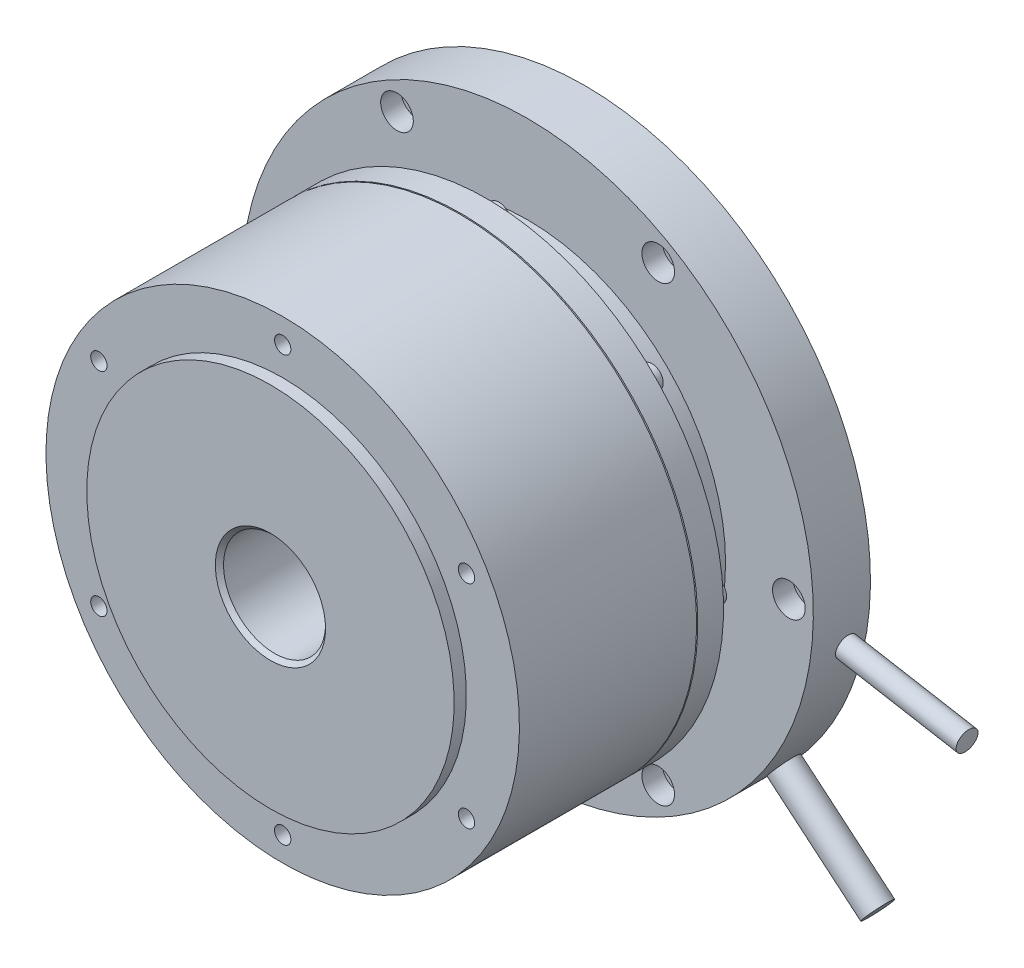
ISO-10303-21;
HEADER;
FILE_DESCRIPTION(('STEP AP214'),'2;1');
FILE_NAME('part.step','',(''),(''),'','','');
FILE_SCHEMA(('AUTOMOTIVE_DESIGN { 1 0 10303 214 1 1 1 1 }'));
ENDSEC;
DATA;
#1=APPLICATION_CONTEXT('core data for automotive mechanical design processes');
#2=APPLICATION_PROTOCOL_DEFINITION('international standard','automotive_design',2000,#1);
#3=PRODUCT_CONTEXT('',#1,'mechanical');
#4=PRODUCT('Part','Part','',(#3));
#5=PRODUCT_RELATED_PRODUCT_CATEGORY('part','',(#4));
#6=PRODUCT_DEFINITION_FORMATION('','',#4);
#7=PRODUCT_DEFINITION_CONTEXT('part definition',#1,'design');
#8=PRODUCT_DEFINITION('design','',#6,#7);
#9=PRODUCT_DEFINITION_SHAPE('','',#8);
#10=(LENGTH_UNIT() NAMED_UNIT(*) SI_UNIT(.MILLI.,.METRE.));
#11=(NAMED_UNIT(*) PLANE_ANGLE_UNIT() SI_UNIT($,.RADIAN.));
#12=(NAMED_UNIT(*) SI_UNIT($,.STERADIAN.) SOLID_ANGLE_UNIT());
#13=UNCERTAINTY_MEASURE_WITH_UNIT(LENGTH_MEASURE(1.E-05),#10,'distance_accuracy_value','');
#14=(GEOMETRIC_REPRESENTATION_CONTEXT(3) GLOBAL_UNCERTAINTY_ASSIGNED_CONTEXT((#13)) GLOBAL_UNIT_ASSIGNED_CONTEXT((#10,
#11,#12)) REPRESENTATION_CONTEXT('',''));
#15=CARTESIAN_POINT('',(0.,0.,0.));
#16=DIRECTION('',(0.,0.,1.));
#17=DIRECTION('',(1.,0.,0.));
#18=AXIS2_PLACEMENT_3D('',#15,#16,#17);
#19=CARTESIAN_POINT('',(-50.217,2.783,21.));
#20=DIRECTION('',(0.,0.,-1.));
#21=DIRECTION('',(0.,-1.,0.));
#22=AXIS2_PLACEMENT_3D('',#19,#20,#21);
#23=PLANE('',#22);
#24=CARTESIAN_POINT('',(-53.,0.,21.));
#25=DIRECTION('',(0.,0.,1.));
#26=DIRECTION('',(1.,0.,0.));
#27=AXIS2_PLACEMENT_3D('',#24,#25,#26);
#28=CIRCLE('',#27,2.75);
#29=CARTESIAN_POINT('',(-50.25,0.,21.));
#30=VERTEX_POINT('',#29);
#31=EDGE_CURVE('E20',#30,#30,#28,.F.);
#32=ORIENTED_EDGE('',*,*,#31,.T.);
#33=EDGE_LOOP('',(#32));
#34=FACE_BOUND('',#33,.T.);
#35=ADVANCED_FACE('F16',(#34),#23,.T.);
#36=CARTESIAN_POINT('',(-2.783,-50.217,21.));
#37=DIRECTION('',(0.,0.,-1.));
#38=DIRECTION('',(1.,0.,0.));
#39=AXIS2_PLACEMENT_3D('',#36,#37,#38);
#40=PLANE('',#39);
#41=CARTESIAN_POINT('',(0.,-53.,21.));
#42=DIRECTION('',(0.,0.,1.));
#43=DIRECTION('',(1.,0.,0.));
#44=AXIS2_PLACEMENT_3D('',#41,#42,#43);
#45=CIRCLE('',#44,2.75);
#46=CARTESIAN_POINT('',(2.75,-53.,21.));
#47=VERTEX_POINT('',#46);
#48=EDGE_CURVE('E439',#47,#47,#45,.F.);
#49=ORIENTED_EDGE('',*,*,#48,.T.);
#50=EDGE_LOOP('',(#49));
#51=FACE_BOUND('',#50,.T.);
#52=ADVANCED_FACE('F1231',(#51),#40,.T.);
#53=CARTESIAN_POINT('',(50.217,-2.783,21.));
#54=DIRECTION('',(0.,0.,-1.));
#55=DIRECTION('',(0.,1.,0.));
#56=AXIS2_PLACEMENT_3D('',#53,#54,#55);
#57=PLANE('',#56);
#58=CARTESIAN_POINT('',(53.,0.,21.));
#59=DIRECTION('',(0.,0.,1.));
#60=DIRECTION('',(1.,0.,0.));
#61=AXIS2_PLACEMENT_3D('',#58,#59,#60);
#62=CIRCLE('',#61,2.75);
#63=CARTESIAN_POINT('',(55.75,0.,21.));
#64=VERTEX_POINT('',#63);
#65=EDGE_CURVE('E437',#64,#64,#62,.F.);
#66=ORIENTED_EDGE('',*,*,#65,.T.);
#67=EDGE_LOOP('',(#66));
#68=FACE_BOUND('',#67,.T.);
#69=ADVANCED_FACE('F1223',(#68),#57,.T.);
#70=CARTESIAN_POINT('',(2.783,50.217,21.));
#71=DIRECTION('',(0.,0.,-1.));
#72=DIRECTION('',(-1.,0.,0.));
#73=AXIS2_PLACEMENT_3D('',#70,#71,#72);
#74=PLANE('',#73);
#75=CARTESIAN_POINT('',(0.,53.,21.));
#76=DIRECTION('',(0.,0.,1.));
#77=DIRECTION('',(1.,0.,0.));
#78=AXIS2_PLACEMENT_3D('',#75,#76,#77);
#79=CIRCLE('',#78,2.75);
#80=CARTESIAN_POINT('',(2.75,53.,21.));
#81=VERTEX_POINT('',#80);
#82=EDGE_CURVE('E434',#81,#81,#79,.F.);
#83=ORIENTED_EDGE('',*,*,#82,.T.);
#84=EDGE_LOOP('',(#83));
#85=FACE_BOUND('',#84,.T.);
#86=ADVANCED_FACE('F1215',(#85),#74,.T.);
#87=CARTESIAN_POINT('',(37.476659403,33.540903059,21.));
#88=DIRECTION('',(0.,0.,-1.));
#89=DIRECTION('',(-0.707106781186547,0.707106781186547,0.));
#90=AXIS2_PLACEMENT_3D('',#87,#88,#89);
#91=PLANE('',#90);
#92=CARTESIAN_POINT('',(37.476659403,37.476659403,21.));
#93=DIRECTION('',(0.,0.,1.));
#94=DIRECTION('',(1.,0.,0.));
#95=AXIS2_PLACEMENT_3D('',#92,#93,#94);
#96=CIRCLE('',#95,2.75000000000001);
#97=CARTESIAN_POINT('',(40.226659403,37.476659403,21.));
#98=VERTEX_POINT('',#97);
#99=EDGE_CURVE('E431',#98,#98,#96,.F.);
#100=ORIENTED_EDGE('',*,*,#99,.T.);
#101=EDGE_LOOP('',(#100));
#102=FACE_BOUND('',#101,.T.);
#103=ADVANCED_FACE('F1207',(#102),#91,.T.);
#104=CARTESIAN_POINT('',(33.540903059,-37.476659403,21.));
#105=DIRECTION('',(0.,0.,-1.));
#106=DIRECTION('',(0.707106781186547,0.707106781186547,0.));
#107=AXIS2_PLACEMENT_3D('',#104,#105,#106);
#108=PLANE('',#107);
#109=CARTESIAN_POINT('',(37.476659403,-37.476659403,21.));
#110=DIRECTION('',(0.,0.,1.));
#111=DIRECTION('',(1.,0.,0.));
#112=AXIS2_PLACEMENT_3D('',#109,#110,#111);
#113=CIRCLE('',#112,2.75000000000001);
#114=CARTESIAN_POINT('',(40.226659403,-37.476659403,21.));
#115=VERTEX_POINT('',#114);
#116=EDGE_CURVE('E428',#115,#115,#113,.F.);
#117=ORIENTED_EDGE('',*,*,#116,.T.);
#118=EDGE_LOOP('',(#117));
#119=FACE_BOUND('',#118,.T.);
#120=ADVANCED_FACE('F1199',(#119),#108,.T.);
#121=CARTESIAN_POINT('',(-37.476659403,-33.540903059,21.));
#122=DIRECTION('',(0.,0.,-1.));
#123=DIRECTION('',(0.707106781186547,-0.707106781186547,0.));
#124=AXIS2_PLACEMENT_3D('',#121,#122,#123);
#125=PLANE('',#124);
#126=CARTESIAN_POINT('',(-37.476659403,-37.476659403,21.));
#127=DIRECTION('',(0.,0.,1.));
#128=DIRECTION('',(1.,0.,0.));
#129=AXIS2_PLACEMENT_3D('',#126,#127,#128);
#130=CIRCLE('',#129,2.74999999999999);
#131=CARTESIAN_POINT('',(-34.726659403,-37.476659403,21.));
#132=VERTEX_POINT('',#131);
#133=EDGE_CURVE('E425',#132,#132,#130,.F.);
#134=ORIENTED_EDGE('',*,*,#133,.T.);
#135=EDGE_LOOP('',(#134));
#136=FACE_BOUND('',#135,.T.);
#137=ADVANCED_FACE('F461',(#136),#125,.T.);
#138=CARTESIAN_POINT('',(-33.540903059,37.476659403,21.));
#139=DIRECTION('',(0.,0.,-1.));
#140=DIRECTION('',(-0.707106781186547,-0.707106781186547,0.));
#141=AXIS2_PLACEMENT_3D('',#138,#139,#140);
#142=PLANE('',#141);
#143=CARTESIAN_POINT('',(-37.476659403,37.476659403,21.));
#144=DIRECTION('',(0.,0.,1.));
#145=DIRECTION('',(1.,0.,0.));
#146=AXIS2_PLACEMENT_3D('',#143,#144,#145);
#147=CIRCLE('',#146,2.74999999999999);
#148=CARTESIAN_POINT('',(-34.726659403,37.476659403,21.));
#149=VERTEX_POINT('',#148);
#150=EDGE_CURVE('E422',#149,#149,#147,.F.);
#151=ORIENTED_EDGE('',*,*,#150,.T.);
#152=EDGE_LOOP('',(#151));
#153=FACE_BOUND('',#152,.T.);
#154=ADVANCED_FACE('F450',(#153),#142,.T.);
#155=CARTESIAN_POINT('',(-53.,0.,21.));
#156=DIRECTION('',(0.,0.,1.));
#157=DIRECTION('',(1.,0.,0.));
#158=AXIS2_PLACEMENT_3D('',#155,#156,#157);
#159=CYLINDRICAL_SURFACE('',#158,2.75);
#160=CARTESIAN_POINT('',(-53.,0.,24.));
#161=DIRECTION('',(0.,0.,1.));
#162=DIRECTION('',(1.,0.,0.));
#163=AXIS2_PLACEMENT_3D('',#160,#161,#162);
#164=CIRCLE('',#163,2.75);
#165=CARTESIAN_POINT('',(-50.25,0.,24.));
#166=VERTEX_POINT('',#165);
#167=EDGE_CURVE('E419',#166,#166,#164,.T.);
#168=ORIENTED_EDGE('',*,*,#167,.F.);
#169=EDGE_LOOP('',(#168));
#170=FACE_BOUND('',#169,.T.);
#171=ORIENTED_EDGE('',*,*,#31,.F.);
#172=EDGE_LOOP('',(#171));
#173=FACE_BOUND('',#172,.T.);
#174=ADVANCED_FACE('F447',(#170,#173),#159,.T.);
#175=CARTESIAN_POINT('',(0.,-53.,21.));
#176=DIRECTION('',(0.,0.,1.));
#177=DIRECTION('',(1.,0.,0.));
#178=AXIS2_PLACEMENT_3D('',#175,#176,#177);
#179=CYLINDRICAL_SURFACE('',#178,2.75);
#180=CARTESIAN_POINT('',(0.,-53.,24.));
#181=DIRECTION('',(0.,0.,1.));
#182=DIRECTION('',(1.,0.,0.));
#183=AXIS2_PLACEMENT_3D('',#180,#181,#182);
#184=CIRCLE('',#183,2.75);
#185=CARTESIAN_POINT('',(2.75,-53.,24.));
#186=VERTEX_POINT('',#185);
#187=EDGE_CURVE('E416',#186,#186,#184,.T.);
#188=ORIENTED_EDGE('',*,*,#187,.F.);
#189=EDGE_LOOP('',(#188));
#190=FACE_BOUND('',#189,.T.);
#191=ORIENTED_EDGE('',*,*,#48,.F.);
#192=EDGE_LOOP('',(#191));
#193=FACE_BOUND('',#192,.T.);
#194=ADVANCED_FACE('F449',(#190,#193),#179,.T.);
#195=CARTESIAN_POINT('',(53.,0.,21.));
#196=DIRECTION('',(0.,0.,1.));
#197=DIRECTION('',(1.,0.,0.));
#198=AXIS2_PLACEMENT_3D('',#195,#196,#197);
#199=CYLINDRICAL_SURFACE('',#198,2.75);
#200=CARTESIAN_POINT('',(53.,0.,24.));
#201=DIRECTION('',(0.,0.,1.));
#202=DIRECTION('',(1.,0.,0.));
#203=AXIS2_PLACEMENT_3D('',#200,#201,#202);
#204=CIRCLE('',#203,2.75);
#205=CARTESIAN_POINT('',(55.75,0.,24.));
#206=VERTEX_POINT('',#205);
#207=EDGE_CURVE('E413',#206,#206,#204,.T.);
#208=ORIENTED_EDGE('',*,*,#207,.F.);
#209=EDGE_LOOP('',(#208));
#210=FACE_BOUND('',#209,.T.);
#211=ORIENTED_EDGE('',*,*,#65,.F.);
#212=EDGE_LOOP('',(#211));
#213=FACE_BOUND('',#212,.T.);
#214=ADVANCED_FACE('F458',(#210,#213),#199,.T.);
#215=CARTESIAN_POINT('',(0.,53.,21.));
#216=DIRECTION('',(0.,0.,1.));
#217=DIRECTION('',(1.,0.,0.));
#218=AXIS2_PLACEMENT_3D('',#215,#216,#217);
#219=CYLINDRICAL_SURFACE('',#218,2.75);
#220=CARTESIAN_POINT('',(0.,53.,24.));
#221=DIRECTION('',(0.,0.,1.));
#222=DIRECTION('',(1.,0.,0.));
#223=AXIS2_PLACEMENT_3D('',#220,#221,#222);
#224=CIRCLE('',#223,2.75);
#225=CARTESIAN_POINT('',(2.75,53.,24.));
#226=VERTEX_POINT('',#225);
#227=EDGE_CURVE('E410',#226,#226,#224,.T.);
#228=ORIENTED_EDGE('',*,*,#227,.F.);
#229=EDGE_LOOP('',(#228));
#230=FACE_BOUND('',#229,.T.);
#231=ORIENTED_EDGE('',*,*,#82,.F.);
#232=EDGE_LOOP('',(#231));
#233=FACE_BOUND('',#232,.T.);
#234=ADVANCED_FACE('F1167',(#230,#233),#219,.T.);
#235=CARTESIAN_POINT('',(37.476659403,37.476659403,21.));
#236=DIRECTION('',(0.,0.,1.));
#237=DIRECTION('',(1.,0.,0.));
#238=AXIS2_PLACEMENT_3D('',#235,#236,#237);
#239=CYLINDRICAL_SURFACE('',#238,2.75000000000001);
#240=CARTESIAN_POINT('',(37.476659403,37.476659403,24.));
#241=DIRECTION('',(0.,0.,1.));
#242=DIRECTION('',(1.,0.,0.));
#243=AXIS2_PLACEMENT_3D('',#240,#241,#242);
#244=CIRCLE('',#243,2.75000000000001);
#245=CARTESIAN_POINT('',(40.226659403,37.476659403,24.));
#246=VERTEX_POINT('',#245);
#247=EDGE_CURVE('E407',#246,#246,#244,.T.);
#248=ORIENTED_EDGE('',*,*,#247,.F.);
#249=EDGE_LOOP('',(#248));
#250=FACE_BOUND('',#249,.T.);
#251=ORIENTED_EDGE('',*,*,#99,.F.);
#252=EDGE_LOOP('',(#251));
#253=FACE_BOUND('',#252,.T.);
#254=ADVANCED_FACE('F1159',(#250,#253),#239,.T.);
#255=CARTESIAN_POINT('',(37.476659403,-37.476659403,21.));
#256=DIRECTION('',(0.,0.,1.));
#257=DIRECTION('',(1.,0.,0.));
#258=AXIS2_PLACEMENT_3D('',#255,#256,#257);
#259=CYLINDRICAL_SURFACE('',#258,2.75000000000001);
#260=CARTESIAN_POINT('',(37.476659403,-37.476659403,24.));
#261=DIRECTION('',(0.,0.,1.));
#262=DIRECTION('',(1.,0.,0.));
#263=AXIS2_PLACEMENT_3D('',#260,#261,#262);
#264=CIRCLE('',#263,2.75000000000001);
#265=CARTESIAN_POINT('',(40.226659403,-37.476659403,24.));
#266=VERTEX_POINT('',#265);
#267=EDGE_CURVE('E404',#266,#266,#264,.T.);
#268=ORIENTED_EDGE('',*,*,#267,.F.);
#269=EDGE_LOOP('',(#268));
#270=FACE_BOUND('',#269,.T.);
#271=ORIENTED_EDGE('',*,*,#116,.F.);
#272=EDGE_LOOP('',(#271));
#273=FACE_BOUND('',#272,.T.);
#274=ADVANCED_FACE('F1151',(#270,#273),#259,.T.);
#275=CARTESIAN_POINT('',(-37.476659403,-37.476659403,21.));
#276=DIRECTION('',(0.,0.,1.));
#277=DIRECTION('',(1.,0.,0.));
#278=AXIS2_PLACEMENT_3D('',#275,#276,#277);
#279=CYLINDRICAL_SURFACE('',#278,2.74999999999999);
#280=CARTESIAN_POINT('',(-37.476659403,-37.476659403,24.));
#281=DIRECTION('',(0.,0.,1.));
#282=DIRECTION('',(1.,0.,0.));
#283=AXIS2_PLACEMENT_3D('',#280,#281,#282);
#284=CIRCLE('',#283,2.74999999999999);
#285=CARTESIAN_POINT('',(-34.726659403,-37.476659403,24.));
#286=VERTEX_POINT('',#285);
#287=EDGE_CURVE('E401',#286,#286,#284,.T.);
#288=ORIENTED_EDGE('',*,*,#287,.F.);
#289=EDGE_LOOP('',(#288));
#290=FACE_BOUND('',#289,.T.);
#291=ORIENTED_EDGE('',*,*,#133,.F.);
#292=EDGE_LOOP('',(#291));
#293=FACE_BOUND('',#292,.T.);
#294=ADVANCED_FACE('F1143',(#290,#293),#279,.T.);
#295=CARTESIAN_POINT('',(-37.476659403,37.476659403,21.));
#296=DIRECTION('',(0.,0.,1.));
#297=DIRECTION('',(1.,0.,0.));
#298=AXIS2_PLACEMENT_3D('',#295,#296,#297);
#299=CYLINDRICAL_SURFACE('',#298,2.74999999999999);
#300=CARTESIAN_POINT('',(-37.476659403,37.476659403,24.));
#301=DIRECTION('',(0.,0.,1.));
#302=DIRECTION('',(1.,0.,0.));
#303=AXIS2_PLACEMENT_3D('',#300,#301,#302);
#304=CIRCLE('',#303,2.74999999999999);
#305=CARTESIAN_POINT('',(-34.726659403,37.476659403,24.));
#306=VERTEX_POINT('',#305);
#307=EDGE_CURVE('E398',#306,#306,#304,.T.);
#308=ORIENTED_EDGE('',*,*,#307,.F.);
#309=EDGE_LOOP('',(#308));
#310=FACE_BOUND('',#309,.T.);
#311=ORIENTED_EDGE('',*,*,#150,.F.);
#312=EDGE_LOOP('',(#311));
#313=FACE_BOUND('',#312,.T.);
#314=ADVANCED_FACE('F1135',(#310,#313),#299,.T.);
#315=CARTESIAN_POINT('',(58.696,-58.696,24.));
#316=DIRECTION('',(0.,0.,-1.));
#317=DIRECTION('',(-1.,0.,0.));
#318=AXIS2_PLACEMENT_3D('',#315,#316,#317);
#319=PLANE('',#318);
#320=ORIENTED_EDGE('',*,*,#307,.T.);
#321=EDGE_LOOP('',(#320));
#322=FACE_BOUND('',#321,.T.);
#323=ORIENTED_EDGE('',*,*,#287,.T.);
#324=EDGE_LOOP('',(#323));
#325=FACE_BOUND('',#324,.T.);
#326=ORIENTED_EDGE('',*,*,#267,.T.);
#327=EDGE_LOOP('',(#326));
#328=FACE_BOUND('',#327,.T.);
#329=ORIENTED_EDGE('',*,*,#247,.T.);
#330=EDGE_LOOP('',(#329));
#331=FACE_BOUND('',#330,.T.);
#332=CARTESIAN_POINT('',(0.,0.,24.));
#333=DIRECTION('',(0.,0.,-1.));
#334=DIRECTION('',(-1.,0.,0.));
#335=AXIS2_PLACEMENT_3D('',#332,#333,#334);
#336=CIRCLE('',#335,44.5);
#337=CARTESIAN_POINT('',(-44.5,0.,24.));
#338=VERTEX_POINT('',#337);
#339=EDGE_CURVE('E392',#338,#338,#336,.F.);
#340=ORIENTED_EDGE('',*,*,#339,.T.);
#341=EDGE_LOOP('',(#340));
#342=FACE_BOUND('',#341,.T.);
#343=ORIENTED_EDGE('',*,*,#227,.T.);
#344=EDGE_LOOP('',(#343));
#345=FACE_BOUND('',#344,.T.);
#346=ORIENTED_EDGE('',*,*,#207,.T.);
#347=EDGE_LOOP('',(#346));
#348=FACE_BOUND('',#347,.T.);
#349=ORIENTED_EDGE('',*,*,#187,.T.);
#350=EDGE_LOOP('',(#349));
#351=FACE_BOUND('',#350,.T.);
#352=ORIENTED_EDGE('',*,*,#167,.T.);
#353=EDGE_LOOP('',(#352));
#354=FACE_BOUND('',#353,.T.);
#355=CARTESIAN_POINT('',(0.,0.,24.));
#356=DIRECTION('',(0.,0.,-1.));
#357=DIRECTION('',(-1.,0.,0.));
#358=AXIS2_PLACEMENT_3D('',#355,#356,#357);
#359=CIRCLE('',#358,58.);
#360=CARTESIAN_POINT('',(-58.,0.,24.));
#361=VERTEX_POINT('',#360);
#362=EDGE_CURVE('E395',#361,#361,#359,.T.);
#363=ORIENTED_EDGE('',*,*,#362,.T.);
#364=EDGE_LOOP('',(#363));
#365=FACE_BOUND('',#364,.T.);
#366=ADVANCED_FACE('F1127',(#322,#325,#328,#331,#342,#345,#348,#351,#354,#365),#319,.T.);
#367=CARTESIAN_POINT('',(0.,0.,30.3));
#368=DIRECTION('',(0.,0.,-1.));
#369=DIRECTION('',(-1.,0.,0.));
#370=AXIS2_PLACEMENT_3D('',#367,#368,#369);
#371=CYLINDRICAL_SURFACE('',#370,58.);
#372=CARTESIAN_POINT('',(0.,0.,30.3));
#373=DIRECTION('',(0.,0.,-1.));
#374=DIRECTION('',(-1.,0.,0.));
#375=AXIS2_PLACEMENT_3D('',#372,#373,#374);
#376=CIRCLE('',#375,58.);
#377=CARTESIAN_POINT('',(-58.,0.,30.3));
#378=VERTEX_POINT('',#377);
#379=EDGE_CURVE('E389',#378,#378,#376,.T.);
#380=ORIENTED_EDGE('',*,*,#379,.T.);
#381=EDGE_LOOP('',(#380));
#382=FACE_BOUND('',#381,.T.);
#383=ORIENTED_EDGE('',*,*,#362,.F.);
#384=EDGE_LOOP('',(#383));
#385=FACE_BOUND('',#384,.T.);
#386=ADVANCED_FACE('F1120',(#382,#385),#371,.T.);
#387=CARTESIAN_POINT('',(0.,0.,24.));
#388=DIRECTION('',(0.,0.,-1.));
#389=DIRECTION('',(-1.,0.,0.));
#390=AXIS2_PLACEMENT_3D('',#387,#388,#389);
#391=CYLINDRICAL_SURFACE('',#390,44.5);
#392=ORIENTED_EDGE('',*,*,#339,.F.);
#393=EDGE_LOOP('',(#392));
#394=FACE_BOUND('',#393,.T.);
#395=CARTESIAN_POINT('',(0.,0.,23.));
#396=DIRECTION('',(0.,0.,-1.));
#397=DIRECTION('',(-1.,0.,0.));
#398=AXIS2_PLACEMENT_3D('',#395,#396,#397);
#399=CIRCLE('',#398,44.5);
#400=CARTESIAN_POINT('',(-44.5,0.,23.));
#401=VERTEX_POINT('',#400);
#402=EDGE_CURVE('E386',#401,#401,#399,.T.);
#403=ORIENTED_EDGE('',*,*,#402,.F.);
#404=EDGE_LOOP('',(#403));
#405=FACE_BOUND('',#404,.T.);
#406=ADVANCED_FACE('F1112',(#394,#405),#391,.T.);
#407=CARTESIAN_POINT('',(58.696,-58.696,30.3));
#408=DIRECTION('',(0.,0.,-1.));
#409=DIRECTION('',(-1.,0.,0.));
#410=AXIS2_PLACEMENT_3D('',#407,#408,#409);
#411=PLANE('',#410);
#412=CARTESIAN_POINT('',(0.,0.,30.3));
#413=DIRECTION('',(0.,0.,-1.));
#414=DIRECTION('',(-1.,0.,0.));
#415=AXIS2_PLACEMENT_3D('',#412,#413,#414);
#416=CIRCLE('',#415,57.);
#417=CARTESIAN_POINT('',(-57.,0.,30.3));
#418=VERTEX_POINT('',#417);
#419=EDGE_CURVE('E383',#418,#418,#416,.T.);
#420=ORIENTED_EDGE('',*,*,#419,.T.);
#421=EDGE_LOOP('',(#420));
#422=FACE_BOUND('',#421,.T.);
#423=ORIENTED_EDGE('',*,*,#379,.F.);
#424=EDGE_LOOP('',(#423));
#425=FACE_BOUND('',#424,.T.);
#426=ADVANCED_FACE('F1104',(#422,#425),#411,.F.);
#427=CARTESIAN_POINT('',(-49.082,-49.082,23.));
#428=DIRECTION('',(0.,0.,1.));
#429=DIRECTION('',(1.,0.,0.));
#430=AXIS2_PLACEMENT_3D('',#427,#428,#429);
#431=PLANE('',#430);
#432=ORIENTED_EDGE('',*,*,#402,.T.);
#433=EDGE_LOOP('',(#432));
#434=FACE_BOUND('',#433,.T.);
#435=CARTESIAN_POINT('',(0.,0.,23.));
#436=DIRECTION('',(0.,0.,-1.));
#437=DIRECTION('',(-1.,0.,0.));
#438=AXIS2_PLACEMENT_3D('',#435,#436,#437);
#439=CIRCLE('',#438,48.5);
#440=CARTESIAN_POINT('',(-48.5,0.,23.));
#441=VERTEX_POINT('',#440);
#442=EDGE_CURVE('E111',#441,#441,#439,.F.);
#443=ORIENTED_EDGE('',*,*,#442,.T.);
#444=EDGE_LOOP('',(#443));
#445=FACE_BOUND('',#444,.T.);
#446=ADVANCED_FACE('F1098',(#434,#445),#431,.T.);
#447=CARTESIAN_POINT('',(0.,0.,52.3));
#448=DIRECTION('',(0.,0.,-1.));
#449=DIRECTION('',(-1.,0.,0.));
#450=AXIS2_PLACEMENT_3D('',#447,#448,#449);
#451=CYLINDRICAL_SURFACE('',#450,58.1);
#452=CARTESIAN_POINT('',(0.,0.,52.3));
#453=DIRECTION('',(0.,0.,-1.));
#454=DIRECTION('',(-1.,0.,0.));
#455=AXIS2_PLACEMENT_3D('',#452,#453,#454);
#456=CIRCLE('',#455,58.1);
#457=CARTESIAN_POINT('',(-45.5536736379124,36.0620689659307,52.3));
#458=VERTEX_POINT('',#457);
#459=CARTESIAN_POINT('',(-58.0460027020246,2.50431034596,52.3));
#460=VERTEX_POINT('',#459);
#461=EDGE_CURVE('E116',#458,#460,#456,.F.);
#462=ORIENTED_EDGE('',*,*,#461,.F.);
#463=DIRECTION('',(0.,0.,1.));
#464=VECTOR('',#463,1.);
#465=CARTESIAN_POINT('',(-45.553673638,36.062068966,42.3));
#466=LINE('',#465,#464);
#467=CARTESIAN_POINT('',(-45.5536736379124,36.0620689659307,32.3));
#468=VERTEX_POINT('',#467);
#469=EDGE_CURVE('E107',#468,#458,#466,.T.);
#470=ORIENTED_EDGE('',*,*,#469,.F.);
#471=CARTESIAN_POINT('',(0.,0.,32.3));
#472=DIRECTION('',(0.,0.,-1.));
#473=DIRECTION('',(-1.,0.,0.));
#474=AXIS2_PLACEMENT_3D('',#471,#472,#473);
#475=CIRCLE('',#474,58.1);
#476=CARTESIAN_POINT('',(-58.0460027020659,2.50431034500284,32.3));
#477=VERTEX_POINT('',#476);
#478=EDGE_CURVE('E101',#477,#468,#475,.T.);
#479=ORIENTED_EDGE('',*,*,#478,.F.);
#480=DIRECTION('',(0.,0.,1.));
#481=VECTOR('',#480,1.);
#482=CARTESIAN_POINT('',(-58.046002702,2.504310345,42.3));
#483=LINE('',#482,#481);
#484=EDGE_CURVE('E92',#477,#460,#483,.T.);
#485=ORIENTED_EDGE('',*,*,#484,.T.);
#486=EDGE_LOOP('',(#462,#470,#479,#485));
#487=FACE_BOUND('',#486,.T.);
#488=ADVANCED_FACE('F105',(#487),#451,.T.);
#489=CARTESIAN_POINT('',(0.,0.,49.605495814));
#490=DIRECTION('',(0.,0.,-1.));
#491=DIRECTION('',(0.,1.,0.));
#492=AXIS2_PLACEMENT_3D('',#489,#490,#491);
#493=CYLINDRICAL_SURFACE('',#492,58.1);
#494=CARTESIAN_POINT('',(-51.7835186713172,-26.3453448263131,32.3));
#495=CARTESIAN_POINT('',(-51.7529245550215,-26.4054886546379,32.3000014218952));
#496=CARTESIAN_POINT('',(-51.7221837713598,-26.4656446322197,32.3045554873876));
#497=CARTESIAN_POINT('',(-51.6537719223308,-26.5989571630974,32.3247598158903));
#498=CARTESIAN_POINT('',(-51.61618878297,-26.6718083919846,32.342788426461));
#499=CARTESIAN_POINT('',(-51.5610366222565,-26.7781839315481,32.3799245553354));
#500=CARTESIAN_POINT('',(-51.542834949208,-26.8131996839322,32.3940087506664));
#501=CARTESIAN_POINT('',(-51.5070016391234,-26.8819693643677,32.4255577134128));
#502=CARTESIAN_POINT('',(-51.4893697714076,-26.9157238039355,32.4430210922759));
#503=CARTESIAN_POINT('',(-51.454887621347,-26.9815847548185,32.481150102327));
#504=CARTESIAN_POINT('',(-51.4380344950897,-27.0136973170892,32.5018026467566));
#505=CARTESIAN_POINT('',(-51.4052337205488,-27.0760631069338,32.5463439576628));
#506=CARTESIAN_POINT('',(-51.3892861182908,-27.1063162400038,32.5702328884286));
#507=CARTESIAN_POINT('',(-51.3430397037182,-27.1938705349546,32.646518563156));
#508=CARTESIAN_POINT('',(-51.3142697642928,-27.2480953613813,32.7036082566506));
#509=CARTESIAN_POINT('',(-51.2768557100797,-27.3183948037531,32.7944540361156));
#510=CARTESIAN_POINT('',(-51.2658331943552,-27.3390716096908,32.8238154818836));
#511=CARTESIAN_POINT('',(-51.2450900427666,-27.3779332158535,32.8845954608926));
#512=CARTESIAN_POINT('',(-51.2353693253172,-27.3961181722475,32.9160138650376));
#513=CARTESIAN_POINT('',(-51.2174072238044,-27.4296839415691,32.9806864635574));
#514=CARTESIAN_POINT('',(-51.2091647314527,-27.445066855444,33.0139392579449));
#515=CARTESIAN_POINT('',(-51.1942977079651,-27.4727888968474,33.082038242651));
#516=CARTESIAN_POINT('',(-51.1876730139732,-27.4851283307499,33.1168842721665));
#517=CARTESIAN_POINT('',(-51.1768684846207,-27.505240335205,33.1833103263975));
#518=CARTESIAN_POINT('',(-51.1724848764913,-27.5133941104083,33.2147421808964));
#519=CARTESIAN_POINT('',(-51.1650683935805,-27.5271835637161,33.278294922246));
#520=CARTESIAN_POINT('',(-51.1620352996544,-27.5328196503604,33.3104156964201));
#521=CARTESIAN_POINT('',(-51.1551152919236,-27.5456764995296,33.407438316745));
#522=CARTESIAN_POINT('',(-51.1533894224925,-27.5488797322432,33.4731103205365));
#523=CARTESIAN_POINT('',(-51.1550197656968,-27.5458516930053,33.5685118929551));
#524=CARTESIAN_POINT('',(-51.1561358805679,-27.5437792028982,33.5985108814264));
#525=CARTESIAN_POINT('',(-51.1595867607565,-27.5373691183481,33.6582072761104));
#526=CARTESIAN_POINT('',(-51.161921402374,-27.5330317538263,33.6879047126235));
#527=CARTESIAN_POINT('',(-51.1677793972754,-27.5221436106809,33.7467778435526));
#528=CARTESIAN_POINT('',(-51.1713031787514,-27.5155920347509,33.7759533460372));
#529=CARTESIAN_POINT('',(-51.1794604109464,-27.5004164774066,33.833593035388));
#530=CARTESIAN_POINT('',(-51.1840937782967,-27.4917926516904,33.8620572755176));
#531=CARTESIAN_POINT('',(-51.1970927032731,-27.4675804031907,33.9324601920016));
#532=CARTESIAN_POINT('',(-51.2061544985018,-27.4506868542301,33.9738355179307));
#533=CARTESIAN_POINT('',(-51.2214223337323,-27.4221809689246,34.0338598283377));
#534=CARTESIAN_POINT('',(-51.2267842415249,-27.4121636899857,34.0535084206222));
#535=CARTESIAN_POINT('',(-51.2380327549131,-27.3911325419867,34.0921129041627));
#536=CARTESIAN_POINT('',(-51.2439194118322,-27.3801185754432,34.1110687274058));
#537=CARTESIAN_POINT('',(-51.2500504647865,-27.3686376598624,34.1296612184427));
#538=B_SPLINE_CURVE_WITH_KNOTS('',3,(#494,#495,#496,#497,#498,#499,#500,#501,#502,#503,#504,
#505,#506,#507,#508,#509,#510,#511,#512,#513,#514,#515,#516,#517,#518,#519,#520,#521,#522,#523,
#524,#525,#526,#527,#528,#529,#530,#531,#532,#533,#534,#535,#536,#537),.UNSPECIFIED.,.F.,.F.,(4,
2,2,2,2,2,2,2,2,2,2,2,2,2,2,2,2,2,2,2,2,4),(0.,0.202458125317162,0.452997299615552,
0.57857253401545,0.70409627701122,0.829117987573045,0.954146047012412,1.20371929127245,
1.31629014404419,1.42885393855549,1.54133298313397,1.65380070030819,1.75196648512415,
1.85011633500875,2.04607206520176,2.13627033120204,2.22645944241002,2.31668106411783,
2.40689590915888,2.54330381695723,2.61136378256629,2.67943041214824),.UNSPECIFIED.);
#539=CARTESIAN_POINT('',(-51.7835186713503,-26.345344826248,32.3));
#540=VERTEX_POINT('',#539);
#541=CARTESIAN_POINT('',(-51.2500504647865,-27.3686376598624,34.1296612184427));
#542=VERTEX_POINT('',#541);
#543=EDGE_CURVE('E284',#540,#542,#538,.T.);
#544=ORIENTED_EDGE('',*,*,#543,.T.);
#545=CARTESIAN_POINT('',(-54.7743090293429,-19.3748566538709,47.0760600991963));
#546=CARTESIAN_POINT('',(-54.7621130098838,-19.4093358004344,47.0202190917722));
#547=CARTESIAN_POINT('',(-54.7498815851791,-19.443811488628,46.9643836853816));
#548=CARTESIAN_POINT('',(-54.6885471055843,-19.6161728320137,46.6852343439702));
#549=CARTESIAN_POINT('',(-54.6389123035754,-19.7540062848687,46.4620049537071));
#550=CARTESIAN_POINT('',(-54.4882970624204,-20.1673373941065,45.7925908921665));
#551=CARTESIAN_POINT('',(-54.3856064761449,-20.4426638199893,45.3466835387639));
#552=CARTESIAN_POINT('',(-54.2281169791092,-20.8552871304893,44.6784157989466));
#553=CARTESIAN_POINT('',(-54.1750450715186,-20.9927666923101,44.4557595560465));
#554=CARTESIAN_POINT('',(-54.0677436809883,-21.2676010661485,44.0106491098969));
#555=CARTESIAN_POINT('',(-54.0135141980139,-21.4049558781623,43.7881949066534));
#556=CARTESIAN_POINT('',(-53.8490789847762,-21.8168308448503,43.1211391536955));
#557=CARTESIAN_POINT('',(-53.7371272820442,-22.0911594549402,42.6768478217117));
#558=CARTESIAN_POINT('',(-53.5656707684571,-22.5022433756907,42.0110732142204));
#559=CARTESIAN_POINT('',(-53.5079306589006,-22.6392026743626,41.789259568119));
#560=CARTESIAN_POINT('',(-53.3912669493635,-22.9129822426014,41.3458574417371));
#561=CARTESIAN_POINT('',(-53.3323433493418,-23.0498025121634,41.1242689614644));
#562=CARTESIAN_POINT('',(-53.2133058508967,-23.3232999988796,40.6813236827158));
#563=CARTESIAN_POINT('',(-53.1531919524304,-23.4599772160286,40.4599668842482));
#564=CARTESIAN_POINT('',(-53.0317667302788,-23.7331848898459,40.017490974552));
#565=CARTESIAN_POINT('',(-52.9704554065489,-23.8697153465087,39.7963718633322));
#566=CARTESIAN_POINT('',(-52.8466281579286,-24.1426250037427,39.3543786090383));
#567=CARTESIAN_POINT('',(-52.7841122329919,-24.2790042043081,39.1335044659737));
#568=CARTESIAN_POINT('',(-52.4684911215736,-24.9605394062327,38.0297180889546));
#569=CARTESIAN_POINT('',(-52.2062923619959,-25.5045444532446,37.1486698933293));
#570=CARTESIAN_POINT('',(-51.7127428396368,-26.4885996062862,35.5549346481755));
#571=CARTESIAN_POINT('',(-51.4847580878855,-26.9291166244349,34.8414914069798));
#572=CARTESIAN_POINT('',(-51.2500504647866,-27.3686376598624,34.1296612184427));
#573=B_SPLINE_CURVE_WITH_KNOTS('',3,(#545,#546,#547,#548,#549,#550,#551,#552,#553,#554,#555,
#556,#557,#558,#559,#560,#561,#562,#563,#564,#565,#566,#567,#568,#569,#570,#571,#572),
.UNSPECIFIED.,.F.,.F.,(4,2,2,2,2,2,2,2,2,2,2,2,2,4),(0.,0.200254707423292,1.00127529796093,
2.60332797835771,3.40434863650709,4.20536931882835,5.80742276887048,6.60844352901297,
7.40946431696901,8.2104851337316,9.01150598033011,9.8125268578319,13.0167444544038,
15.6234089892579),.UNSPECIFIED.);
#574=CARTESIAN_POINT('',(-54.7743090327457,-19.374856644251,47.0760601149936));
#575=VERTEX_POINT('',#574);
#576=EDGE_CURVE('E274',#575,#542,#573,.T.);
#577=ORIENTED_EDGE('',*,*,#576,.F.);
#578=CARTESIAN_POINT('',(-54.7743090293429,-19.3748566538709,47.0760600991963));
#579=CARTESIAN_POINT('',(-54.7866114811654,-19.3400763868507,47.1324006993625));
#580=CARTESIAN_POINT('',(-54.7992517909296,-19.3042359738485,47.1880240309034));
#581=CARTESIAN_POINT('',(-54.8382240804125,-19.1933670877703,47.3529890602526));
#582=CARTESIAN_POINT('',(-54.8655265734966,-19.115217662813,47.4600248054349));
#583=CARTESIAN_POINT('',(-54.9224460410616,-18.951054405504,47.6672893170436));
#584=CARTESIAN_POINT('',(-54.9520640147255,-18.8650371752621,47.7675151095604));
#585=CARTESIAN_POINT('',(-55.0132446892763,-18.6858733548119,47.9606399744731));
#586=CARTESIAN_POINT('',(-55.0448064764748,-18.5927301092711,48.0535424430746));
#587=CARTESIAN_POINT('',(-55.1095446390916,-18.3999574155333,48.2317279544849));
#588=CARTESIAN_POINT('',(-55.1427209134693,-18.3003283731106,48.3170114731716));
#589=CARTESIAN_POINT('',(-55.2104285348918,-18.0950340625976,48.4794065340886));
#590=CARTESIAN_POINT('',(-55.2449600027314,-17.9893682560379,48.5565173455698));
#591=CARTESIAN_POINT('',(-55.3150525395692,-17.7726734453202,48.7021937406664));
#592=CARTESIAN_POINT('',(-55.3506133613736,-17.6616457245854,48.7707613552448));
#593=CARTESIAN_POINT('',(-55.4223486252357,-17.4352329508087,48.8990762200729));
#594=CARTESIAN_POINT('',(-55.4585211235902,-17.3198606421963,48.9588470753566));
#595=CARTESIAN_POINT('',(-55.5314112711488,-17.0847161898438,49.0694897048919));
#596=CARTESIAN_POINT('',(-55.5681300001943,-16.9649343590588,49.1203402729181));
#597=CARTESIAN_POINT('',(-55.6417773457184,-16.7218064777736,49.2126791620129));
#598=CARTESIAN_POINT('',(-55.6787061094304,-16.5984575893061,49.2541597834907));
#599=CARTESIAN_POINT('',(-55.7901034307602,-16.2216846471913,49.3652225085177));
#600=CARTESIAN_POINT('',(-55.8644985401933,-15.9637339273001,49.4203964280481));
#601=CARTESIAN_POINT('',(-55.9743714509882,-15.5723577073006,49.47264185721));
#602=CARTESIAN_POINT('',(-56.0107505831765,-15.4410013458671,49.4849675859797));
#603=CARTESIAN_POINT('',(-56.0827297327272,-15.1774844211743,49.4994786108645));
#604=CARTESIAN_POINT('',(-56.1183297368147,-15.0453238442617,49.5016637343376));
#605=CARTESIAN_POINT('',(-56.1932593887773,-14.7631864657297,49.4955003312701));
#606=CARTESIAN_POINT('',(-56.2324473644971,-14.6132020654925,49.4856968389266));
#607=CARTESIAN_POINT('',(-56.3092817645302,-14.3142797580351,49.4526919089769));
#608=CARTESIAN_POINT('',(-56.3469278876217,-14.1653420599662,49.4294878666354));
#609=CARTESIAN_POINT('',(-56.4203716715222,-13.8699241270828,49.3700261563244));
#610=CARTESIAN_POINT('',(-56.4561723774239,-13.7234401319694,49.3337908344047));
#611=CARTESIAN_POINT('',(-56.5257868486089,-13.4338220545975,49.2484621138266));
#612=CARTESIAN_POINT('',(-56.5596015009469,-13.290686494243,49.1993745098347));
#613=CARTESIAN_POINT('',(-56.6080343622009,-13.0822505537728,49.1172396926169));
#614=CARTESIAN_POINT('',(-56.6234936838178,-13.0151688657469,49.0891194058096));
#615=CARTESIAN_POINT('',(-56.6538958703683,-12.8821865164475,49.0299879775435));
#616=CARTESIAN_POINT('',(-56.6688388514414,-12.8162855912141,48.9989774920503));
#617=CARTESIAN_POINT('',(-56.6982017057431,-12.6857558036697,48.9341193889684));
#618=CARTESIAN_POINT('',(-56.7126214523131,-12.6211272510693,48.9002710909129));
#619=CARTESIAN_POINT('',(-56.7409271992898,-12.4932570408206,48.8298196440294));
#620=CARTESIAN_POINT('',(-56.7548130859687,-12.4300156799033,48.7932159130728));
#621=CARTESIAN_POINT('',(-56.7948919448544,-12.2460479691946,48.6814058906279));
#622=CARTESIAN_POINT('',(-56.820323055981,-12.1274370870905,48.6023898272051));
#623=CARTESIAN_POINT('',(-56.8690184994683,-11.8970008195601,48.4343450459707));
#624=CARTESIAN_POINT('',(-56.8922818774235,-11.7851784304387,48.3453119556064));
#625=CARTESIAN_POINT('',(-56.9366195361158,-11.569076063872,48.1579643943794));
#626=CARTESIAN_POINT('',(-56.9576932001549,-11.4647982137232,48.059647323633));
#627=CARTESIAN_POINT('',(-56.9976057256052,-11.2646946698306,47.8544265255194));
#628=CARTESIAN_POINT('',(-57.0164457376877,-11.1688646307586,47.7475272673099));
#629=CARTESIAN_POINT('',(-57.0483412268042,-11.0046491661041,47.5479127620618));
#630=CARTESIAN_POINT('',(-57.0618008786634,-10.9346026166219,47.4566224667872));
#631=CARTESIAN_POINT('',(-57.0872565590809,-10.8009140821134,47.2696035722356));
#632=CARTESIAN_POINT('',(-57.0992559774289,-10.7372573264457,47.1738859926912));
#633=CARTESIAN_POINT('',(-57.1105463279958,-10.6768674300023,47.0760600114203));
#634=B_SPLINE_CURVE_WITH_KNOTS('',3,(#578,#579,#580,#581,#582,#583,#584,#585,#586,#587,#588,
#589,#590,#591,#592,#593,#594,#595,#596,#597,#598,#599,#600,#601,#602,#603,#604,#605,#606,#607,
#608,#609,#610,#611,#612,#613,#614,#615,#616,#617,#618,#619,#620,#621,#622,#623,#624,#625,#626,
#627,#628,#629,#630,#631,#632,#633),.UNSPECIFIED.,.F.,.F.,(4,2,2,2,2,2,2,2,2,2,2,2,2,2,2,2,2,2,
2,2,2,2,2,2,2,2,2,4),(0.,0.202044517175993,0.607532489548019,1.01319641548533,1.41867109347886,
1.8241204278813,2.22960598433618,2.63499496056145,3.03927547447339,3.44450443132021,
3.85006517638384,4.66868912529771,5.07895997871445,5.48923781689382,5.95464860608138,
6.4201498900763,6.88485670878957,7.3493543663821,7.57238435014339,7.7953638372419,
8.01839694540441,8.24147730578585,8.67523428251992,9.10918133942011,9.54325028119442,
9.97709463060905,10.3243863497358,10.6708558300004),.UNSPECIFIED.);
#635=CARTESIAN_POINT('',(-57.1105463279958,-10.6768674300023,47.0760600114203));
#636=VERTEX_POINT('',#635);
#637=EDGE_CURVE('E125',#575,#636,#634,.T.);
#638=ORIENTED_EDGE('',*,*,#637,.T.);
#639=CARTESIAN_POINT('',(-58.0380138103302,-2.68308646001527,34.129661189));
#640=CARTESIAN_POINT('',(-58.036393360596,-2.71813852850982,34.1864300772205));
#641=CARTESIAN_POINT('',(-58.0347411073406,-2.75319017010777,34.2431982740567));
#642=CARTESIAN_POINT('',(-58.0263207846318,-2.92844646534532,34.5270361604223));
#643=CARTESIAN_POINT('',(-58.0190755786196,-3.06864466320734,34.754095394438));
#644=CARTESIAN_POINT('',(-57.9803022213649,-3.76961547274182,35.8893588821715));
#645=CARTESIAN_POINT('',(-57.9411341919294,-4.33028143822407,36.7973904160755));
#646=CARTESIAN_POINT('',(-57.8819508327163,-5.03085855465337,37.9320162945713));
#647=CARTESIAN_POINT('',(-57.8696032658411,-5.17095833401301,38.1589161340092));
#648=CARTESIAN_POINT('',(-57.8438842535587,-5.45113214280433,38.6126741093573));
#649=CARTESIAN_POINT('',(-57.8305128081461,-5.59120617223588,38.8395322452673));
#650=CARTESIAN_POINT('',(-57.7610920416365,-6.29152320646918,39.973736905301));
#651=CARTESIAN_POINT('',(-57.6973562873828,-6.85156003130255,40.880749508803));
#652=CARTESIAN_POINT('',(-57.4851995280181,-8.50108981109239,43.552260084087));
#653=CARTESIAN_POINT('',(-57.3137372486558,-9.58977795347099,45.3154546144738));
#654=CARTESIAN_POINT('',(-57.1105463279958,-10.6768674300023,47.0760600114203));
#655=B_SPLINE_CURVE_WITH_KNOTS('',3,(#639,#640,#641,#642,#643,#644,#645,#646,#647,#648,#649,
#650,#651,#652,#653,#654),.UNSPECIFIED.,.F.,.F.,(4,2,2,2,2,2,2,4),(0.,0.200214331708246,
1.00107302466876,4.20459558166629,5.00545429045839,5.80631300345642,9.00983711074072,
15.2468193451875),.UNSPECIFIED.);
#656=CARTESIAN_POINT('',(-58.0380138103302,-2.68308646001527,34.129661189));
#657=VERTEX_POINT('',#656);
#658=EDGE_CURVE('E301',#657,#636,#655,.T.);
#659=ORIENTED_EDGE('',*,*,#658,.F.);
#660=CARTESIAN_POINT('',(-58.0380138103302,-2.68308646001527,34.129661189));
#661=CARTESIAN_POINT('',(-58.0388348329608,-2.66532459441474,34.1009208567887));
#662=CARTESIAN_POINT('',(-58.0395917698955,-2.64877661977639,34.0714258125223));
#663=CARTESIAN_POINT('',(-58.0409788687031,-2.61820736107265,34.0110843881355));
#664=CARTESIAN_POINT('',(-58.0416087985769,-2.60419070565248,33.9802356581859));
#665=CARTESIAN_POINT('',(-58.0427396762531,-2.57886236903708,33.9174855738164));
#666=CARTESIAN_POINT('',(-58.0432407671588,-2.56754768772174,33.8855854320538));
#667=CARTESIAN_POINT('',(-58.0441193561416,-2.54760818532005,33.8209504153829));
#668=CARTESIAN_POINT('',(-58.0444968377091,-2.53898372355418,33.7882154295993));
#669=CARTESIAN_POINT('',(-58.0451268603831,-2.52453972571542,33.7221018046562));
#670=CARTESIAN_POINT('',(-58.0453793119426,-2.51872220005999,33.6887227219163));
#671=CARTESIAN_POINT('',(-58.0457584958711,-2.5099677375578,33.6215846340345));
#672=CARTESIAN_POINT('',(-58.0458851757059,-2.5070320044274,33.5878254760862));
#673=CARTESIAN_POINT('',(-58.0460801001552,-2.50252030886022,33.4867932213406));
#674=CARTESIAN_POINT('',(-58.0459677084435,-2.50513597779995,33.4192810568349));
#675=CARTESIAN_POINT('',(-58.045251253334,-2.52168011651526,33.2856880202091));
#676=CARTESIAN_POINT('',(-58.044647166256,-2.53560913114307,33.219607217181));
#677=CARTESIAN_POINT('',(-58.0429406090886,-2.57437761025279,33.090649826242));
#678=CARTESIAN_POINT('',(-58.0418376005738,-2.59922886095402,33.0277767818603));
#679=CARTESIAN_POINT('',(-58.0391246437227,-2.6591173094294,32.9070919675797));
#680=CARTESIAN_POINT('',(-58.0375146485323,-2.69415544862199,32.8492806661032));
#681=CARTESIAN_POINT('',(-58.0337813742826,-2.77340704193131,32.7403823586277));
#682=CARTESIAN_POINT('',(-58.0316582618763,-2.81761751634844,32.6892931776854));
#683=CARTESIAN_POINT('',(-58.0269018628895,-2.9139286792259,32.5952241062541));
#684=CARTESIAN_POINT('',(-58.0242686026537,-2.9660289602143,32.5522437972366));
#685=CARTESIAN_POINT('',(-58.0184955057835,-3.07689235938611,32.4754690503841));
#686=CARTESIAN_POINT('',(-58.015353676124,-3.13568140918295,32.4417122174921));
#687=CARTESIAN_POINT('',(-58.0086091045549,-3.25807028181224,32.3845488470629));
#688=CARTESIAN_POINT('',(-58.0050064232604,-3.32166947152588,32.361140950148));
#689=CARTESIAN_POINT('',(-57.9981684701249,-3.43877349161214,32.3288955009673));
#690=CARTESIAN_POINT('',(-57.9950042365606,-3.49174732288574,32.318078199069));
#691=CARTESIAN_POINT('',(-57.988472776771,-3.59860244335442,32.303625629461));
#692=CARTESIAN_POINT('',(-57.9851057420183,-3.65248284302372,32.2999836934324));
#693=CARTESIAN_POINT('',(-57.9816587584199,-3.7063793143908,32.3));
#694=B_SPLINE_CURVE_WITH_KNOTS('',3,(#660,#661,#662,#663,#664,#665,#666,#667,#668,#669,#670,
#671,#672,#673,#674,#675,#676,#677,#678,#679,#680,#681,#682,#683,#684,#685,#686,#687,#688,#689,
#690,#691,#692,#693),.UNSPECIFIED.,.F.,.F.,(4,2,2,2,2,2,2,2,2,2,2,2,2,2,2,2,4),(0.,
0.101361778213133,0.202907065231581,0.304339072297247,0.405784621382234,0.507302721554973,
0.608863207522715,0.810516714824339,1.0121799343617,1.21406130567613,1.41596133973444,
1.61779588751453,1.81962001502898,2.02225511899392,2.22486359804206,2.38687256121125,
2.54873089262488),.UNSPECIFIED.);
#695=CARTESIAN_POINT('',(-57.9816587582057,-3.706379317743,32.3));
#696=VERTEX_POINT('',#695);
#697=EDGE_CURVE('E310',#657,#696,#694,.T.);
#698=ORIENTED_EDGE('',*,*,#697,.T.);
#699=CARTESIAN_POINT('',(0.,0.,32.3));
#700=DIRECTION('',(0.,0.,-1.));
#701=DIRECTION('',(0.,1.,0.));
#702=AXIS2_PLACEMENT_3D('',#699,#700,#701);
#703=CIRCLE('',#702,58.1);
#704=EDGE_CURVE('E651',#540,#696,#703,.T.);
#705=ORIENTED_EDGE('',*,*,#704,.F.);
#706=EDGE_LOOP('',(#544,#577,#638,#659,#698,#705));
#707=FACE_BOUND('',#706,.T.);
#708=ADVANCED_FACE('F289',(#707),#493,.T.);
#709=CARTESIAN_POINT('',(0.,0.,30.6));
#710=DIRECTION('',(0.,0.,-1.));
#711=DIRECTION('',(-1.,0.,0.));
#712=AXIS2_PLACEMENT_3D('',#709,#710,#711);
#713=CYLINDRICAL_SURFACE('',#712,57.);
#714=ORIENTED_EDGE('',*,*,#419,.F.);
#715=EDGE_LOOP('',(#714));
#716=FACE_BOUND('',#715,.T.);
#717=CARTESIAN_POINT('',(0.,0.,30.6));
#718=DIRECTION('',(0.,0.,-1.));
#719=DIRECTION('',(-1.,0.,0.));
#720=AXIS2_PLACEMENT_3D('',#717,#718,#719);
#721=CIRCLE('',#720,57.);
#722=CARTESIAN_POINT('',(-57.,0.,30.6));
#723=VERTEX_POINT('',#722);
#724=EDGE_CURVE('E281',#723,#723,#721,.T.);
#725=ORIENTED_EDGE('',*,*,#724,.T.);
#726=EDGE_LOOP('',(#725));
#727=FACE_BOUND('',#726,.T.);
#728=ADVANCED_FACE('F294',(#716,#727),#713,.T.);
#729=CARTESIAN_POINT('',(98.015085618,-20.005875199,2.1482));
#730=DIRECTION('',(0.984807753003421,-0.173648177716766,0.));
#731=DIRECTION('',(0.173648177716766,0.984807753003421,0.));
#732=AXIS2_PLACEMENT_3D('',#729,#730,#731);
#733=PLANE('',#732);
#734=CARTESIAN_POINT('',(98.4807753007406,-17.3648177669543,4.83));
#735=DIRECTION('',(-0.984807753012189,0.173648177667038,0.));
#736=DIRECTION('',(-0.173648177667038,-0.984807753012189,0.));
#737=AXIS2_PLACEMENT_3D('',#734,#735,#736);
#738=CIRCLE('',#737,2.64999999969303);
#739=CARTESIAN_POINT('',(98.0206076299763,-19.9745583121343,4.83));
#740=VERTEX_POINT('',#739);
#741=EDGE_CURVE('E1305',#740,#740,#738,.F.);
#742=ORIENTED_EDGE('',*,*,#741,.T.);
#743=EDGE_LOOP('',(#742));
#744=FACE_BOUND('',#743,.T.);
#745=ADVANCED_FACE('F1072',(#744),#733,.T.);
#746=CARTESIAN_POINT('',(78.881198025,-61.565431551,1.288));
#747=DIRECTION('',(-0.766044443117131,0.642787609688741,0.));
#748=DIRECTION('',(-0.642787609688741,-0.766044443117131,0.));
#749=AXIS2_PLACEMENT_3D('',#746,#747,#748);
#750=PLANE('',#749);
#751=CARTESIAN_POINT('',(76.6044443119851,-64.2787609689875,4.83));
#752=DIRECTION('',(-0.766044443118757,0.642787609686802,0.));
#753=DIRECTION('',(-0.642787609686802,-0.766044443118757,0.));
#754=AXIS2_PLACEMENT_3D('',#751,#752,#753);
#755=CIRCLE('',#754,3.49999999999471);
#756=CARTESIAN_POINT('',(74.3546876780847,-66.9599165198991,4.83));
#757=VERTEX_POINT('',#756);
#758=EDGE_CURVE('E1303',#757,#757,#755,.F.);
#759=ORIENTED_EDGE('',*,*,#758,.T.);
#760=EDGE_LOOP('',(#759));
#761=FACE_BOUND('',#760,.T.);
#762=ADVANCED_FACE('F1065',(#761),#750,.F.);
#763=CARTESIAN_POINT('',(0.,0.,23.));
#764=DIRECTION('',(0.,0.,-1.));
#765=DIRECTION('',(-1.,0.,0.));
#766=AXIS2_PLACEMENT_3D('',#763,#764,#765);
#767=CYLINDRICAL_SURFACE('',#766,48.5);
#768=ORIENTED_EDGE('',*,*,#442,.F.);
#769=EDGE_LOOP('',(#768));
#770=FACE_BOUND('',#769,.T.);
#771=CARTESIAN_POINT('',(0.,0.,14.));
#772=DIRECTION('',(0.,0.,-1.));
#773=DIRECTION('',(-1.,0.,0.));
#774=AXIS2_PLACEMENT_3D('',#771,#772,#773);
#775=CIRCLE('',#774,48.5);
#776=CARTESIAN_POINT('',(-48.5,0.,14.));
#777=VERTEX_POINT('',#776);
#778=EDGE_CURVE('E1277',#777,#777,#775,.T.);
#779=ORIENTED_EDGE('',*,*,#778,.F.);
#780=EDGE_LOOP('',(#779));
#781=FACE_BOUND('',#780,.T.);
#782=ADVANCED_FACE('F1057',(#770,#781),#767,.T.);
#783=CARTESIAN_POINT('',(-64.,0.,9.));
#784=DIRECTION('',(0.,0.,1.));
#785=DIRECTION('',(1.,0.,0.));
#786=AXIS2_PLACEMENT_3D('',#783,#784,#785);
#787=CYLINDRICAL_SURFACE('',#786,4.);
#788=CARTESIAN_POINT('',(-64.,0.,14.));
#789=DIRECTION('',(0.,0.,1.));
#790=DIRECTION('',(1.,0.,0.));
#791=AXIS2_PLACEMENT_3D('',#788,#789,#790);
#792=CIRCLE('',#791,4.);
#793=CARTESIAN_POINT('',(-60.,0.,14.));
#794=VERTEX_POINT('',#793);
#795=EDGE_CURVE('E1300',#794,#794,#792,.F.);
#796=ORIENTED_EDGE('',*,*,#795,.F.);
#797=EDGE_LOOP('',(#796));
#798=FACE_BOUND('',#797,.T.);
#799=CARTESIAN_POINT('',(-64.,0.,9.));
#800=DIRECTION('',(0.,0.,1.));
#801=DIRECTION('',(1.,0.,0.));
#802=AXIS2_PLACEMENT_3D('',#799,#800,#801);
#803=CIRCLE('',#802,4.);
#804=CARTESIAN_POINT('',(-60.,0.,9.));
#805=VERTEX_POINT('',#804);
#806=EDGE_CURVE('E1278',#805,#805,#803,.T.);
#807=ORIENTED_EDGE('',*,*,#806,.F.);
#808=EDGE_LOOP('',(#807));
#809=FACE_BOUND('',#808,.T.);
#810=ADVANCED_FACE('F1049',(#798,#809),#787,.F.);
#811=CARTESIAN_POINT('',(-32.,-55.425625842,9.));
#812=DIRECTION('',(0.,0.,1.));
#813=DIRECTION('',(1.,0.,0.));
#814=AXIS2_PLACEMENT_3D('',#811,#812,#813);
#815=CYLINDRICAL_SURFACE('',#814,4.);
#816=CARTESIAN_POINT('',(-32.,-55.425625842,14.));
#817=DIRECTION('',(0.,0.,1.));
#818=DIRECTION('',(1.,0.,0.));
#819=AXIS2_PLACEMENT_3D('',#816,#817,#818);
#820=CIRCLE('',#819,4.);
#821=CARTESIAN_POINT('',(-28.,-55.425625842,14.));
#822=VERTEX_POINT('',#821);
#823=EDGE_CURVE('E1297',#822,#822,#820,.F.);
#824=ORIENTED_EDGE('',*,*,#823,.F.);
#825=EDGE_LOOP('',(#824));
#826=FACE_BOUND('',#825,.T.);
#827=CARTESIAN_POINT('',(-32.,-55.425625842,9.));
#828=DIRECTION('',(0.,0.,1.));
#829=DIRECTION('',(1.,0.,0.));
#830=AXIS2_PLACEMENT_3D('',#827,#828,#829);
#831=CIRCLE('',#830,4.);
#832=CARTESIAN_POINT('',(-28.,-55.425625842,9.));
#833=VERTEX_POINT('',#832);
#834=EDGE_CURVE('E1282',#833,#833,#831,.T.);
#835=ORIENTED_EDGE('',*,*,#834,.F.);
#836=EDGE_LOOP('',(#835));
#837=FACE_BOUND('',#836,.T.);
#838=ADVANCED_FACE('F1041',(#826,#837),#815,.F.);
#839=CARTESIAN_POINT('',(32.,-55.425625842,9.));
#840=DIRECTION('',(0.,0.,1.));
#841=DIRECTION('',(1.,0.,0.));
#842=AXIS2_PLACEMENT_3D('',#839,#840,#841);
#843=CYLINDRICAL_SURFACE('',#842,4.);
#844=CARTESIAN_POINT('',(32.,-55.425625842,14.));
#845=DIRECTION('',(0.,0.,1.));
#846=DIRECTION('',(1.,0.,0.));
#847=AXIS2_PLACEMENT_3D('',#844,#845,#846);
#848=CIRCLE('',#847,4.);
#849=CARTESIAN_POINT('',(36.,-55.425625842,14.));
#850=VERTEX_POINT('',#849);
#851=EDGE_CURVE('E1294',#850,#850,#848,.F.);
#852=ORIENTED_EDGE('',*,*,#851,.F.);
#853=EDGE_LOOP('',(#852));
#854=FACE_BOUND('',#853,.T.);
#855=CARTESIAN_POINT('',(32.,-55.425625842,9.));
#856=DIRECTION('',(0.,0.,1.));
#857=DIRECTION('',(1.,0.,0.));
#858=AXIS2_PLACEMENT_3D('',#855,#856,#857);
#859=CIRCLE('',#858,4.);
#860=CARTESIAN_POINT('',(36.,-55.425625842,9.));
#861=VERTEX_POINT('',#860);
#862=EDGE_CURVE('E1327',#861,#861,#859,.T.);
#863=ORIENTED_EDGE('',*,*,#862,.F.);
#864=EDGE_LOOP('',(#863));
#865=FACE_BOUND('',#864,.T.);
#866=ADVANCED_FACE('F1033',(#854,#865),#843,.F.);
#867=CARTESIAN_POINT('',(64.,0.,9.));
#868=DIRECTION('',(0.,0.,1.));
#869=DIRECTION('',(1.,0.,0.));
#870=AXIS2_PLACEMENT_3D('',#867,#868,#869);
#871=CYLINDRICAL_SURFACE('',#870,4.);
#872=CARTESIAN_POINT('',(64.,0.,14.));
#873=DIRECTION('',(0.,0.,1.));
#874=DIRECTION('',(1.,0.,0.));
#875=AXIS2_PLACEMENT_3D('',#872,#873,#874);
#876=CIRCLE('',#875,4.);
#877=CARTESIAN_POINT('',(68.,0.,14.));
#878=VERTEX_POINT('',#877);
#879=EDGE_CURVE('E1291',#878,#878,#876,.F.);
#880=ORIENTED_EDGE('',*,*,#879,.F.);
#881=EDGE_LOOP('',(#880));
#882=FACE_BOUND('',#881,.T.);
#883=CARTESIAN_POINT('',(64.,0.,9.));
#884=DIRECTION('',(0.,0.,1.));
#885=DIRECTION('',(1.,0.,0.));
#886=AXIS2_PLACEMENT_3D('',#883,#884,#885);
#887=CIRCLE('',#886,4.);
#888=CARTESIAN_POINT('',(68.,0.,9.));
#889=VERTEX_POINT('',#888);
#890=EDGE_CURVE('E1329',#889,#889,#887,.T.);
#891=ORIENTED_EDGE('',*,*,#890,.F.);
#892=EDGE_LOOP('',(#891));
#893=FACE_BOUND('',#892,.T.);
#894=ADVANCED_FACE('F1026',(#882,#893),#871,.F.);
#895=CARTESIAN_POINT('',(32.,55.425625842,9.));
#896=DIRECTION('',(0.,0.,1.));
#897=DIRECTION('',(1.,0.,0.));
#898=AXIS2_PLACEMENT_3D('',#895,#896,#897);
#899=CYLINDRICAL_SURFACE('',#898,4.);
#900=CARTESIAN_POINT('',(32.,55.425625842,14.));
#901=DIRECTION('',(0.,0.,1.));
#902=DIRECTION('',(1.,0.,0.));
#903=AXIS2_PLACEMENT_3D('',#900,#901,#902);
#904=CIRCLE('',#903,4.);
#905=CARTESIAN_POINT('',(36.,55.425625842,14.));
#906=VERTEX_POINT('',#905);
#907=EDGE_CURVE('E1285',#906,#906,#904,.F.);
#908=ORIENTED_EDGE('',*,*,#907,.F.);
#909=EDGE_LOOP('',(#908));
#910=FACE_BOUND('',#909,.T.);
#911=CARTESIAN_POINT('',(32.,55.425625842,9.));
#912=DIRECTION('',(0.,0.,1.));
#913=DIRECTION('',(1.,0.,0.));
#914=AXIS2_PLACEMENT_3D('',#911,#912,#913);
#915=CIRCLE('',#914,4.);
#916=CARTESIAN_POINT('',(36.,55.425625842,9.));
#917=VERTEX_POINT('',#916);
#918=EDGE_CURVE('E1334',#917,#917,#915,.T.);
#919=ORIENTED_EDGE('',*,*,#918,.F.);
#920=EDGE_LOOP('',(#919));
#921=FACE_BOUND('',#920,.T.);
#922=ADVANCED_FACE('F1019',(#910,#921),#899,.F.);
#923=CARTESIAN_POINT('',(-32.,55.425625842,9.));
#924=DIRECTION('',(0.,0.,1.));
#925=DIRECTION('',(1.,0.,0.));
#926=AXIS2_PLACEMENT_3D('',#923,#924,#925);
#927=CYLINDRICAL_SURFACE('',#926,4.);
#928=CARTESIAN_POINT('',(-32.,55.425625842,14.));
#929=DIRECTION('',(0.,0.,1.));
#930=DIRECTION('',(1.,0.,0.));
#931=AXIS2_PLACEMENT_3D('',#928,#929,#930);
#932=CIRCLE('',#931,4.);
#933=CARTESIAN_POINT('',(-28.,55.425625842,14.));
#934=VERTEX_POINT('',#933);
#935=EDGE_CURVE('E1279',#934,#934,#932,.F.);
#936=ORIENTED_EDGE('',*,*,#935,.F.);
#937=EDGE_LOOP('',(#936));
#938=FACE_BOUND('',#937,.T.);
#939=CARTESIAN_POINT('',(-32.,55.425625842,9.));
#940=DIRECTION('',(0.,0.,1.));
#941=DIRECTION('',(1.,0.,0.));
#942=AXIS2_PLACEMENT_3D('',#939,#940,#941);
#943=CIRCLE('',#942,4.);
#944=CARTESIAN_POINT('',(-28.,55.425625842,9.));
#945=VERTEX_POINT('',#944);
#946=EDGE_CURVE('E665',#945,#945,#943,.T.);
#947=ORIENTED_EDGE('',*,*,#946,.F.);
#948=EDGE_LOOP('',(#947));
#949=FACE_BOUND('',#948,.T.);
#950=ADVANCED_FACE('F367',(#938,#949),#927,.F.);
#951=CARTESIAN_POINT('',(-45.399843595,2.298627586,32.3));
#952=DIRECTION('',(0.,0.,-1.));
#953=DIRECTION('',(-1.,0.,0.));
#954=AXIS2_PLACEMENT_3D('',#951,#952,#953);
#955=PLANE('',#954);
#956=DIRECTION('',(-0.999070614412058,0.0431034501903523,0.));
#957=VECTOR('',#956,1.);
#958=CARTESIAN_POINT('',(-57.9960491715,2.5021551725,32.3));
#959=LINE('',#958,#957);
#960=CARTESIAN_POINT('',(-57.9460956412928,2.49999998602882,32.3000000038));
#961=VERTEX_POINT('',#960);
#962=EDGE_CURVE('E97',#961,#477,#959,.T.);
#963=ORIENTED_EDGE('',*,*,#962,.T.);
#964=ORIENTED_EDGE('',*,*,#478,.T.);
#965=DIRECTION('',(-0.784056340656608,0.620689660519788,0.));
#966=VECTOR('',#965,1.);
#967=CARTESIAN_POINT('',(-45.514470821,36.031034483,32.3));
#968=LINE('',#967,#966);
#969=CARTESIAN_POINT('',(-45.4752680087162,35.9999999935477,32.3000000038));
#970=VERTEX_POINT('',#969);
#971=EDGE_CURVE('E123',#970,#468,#968,.T.);
#972=ORIENTED_EDGE('',*,*,#971,.F.);
#973=CARTESIAN_POINT('',(0.,0.,32.3000000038));
#974=DIRECTION('',(0.,0.,-1.));
#975=DIRECTION('',(0.,1.,0.));
#976=AXIS2_PLACEMENT_3D('',#973,#974,#975);
#977=CIRCLE('',#976,58.);
#978=EDGE_CURVE('E115',#970,#961,#977,.F.);
#979=ORIENTED_EDGE('',*,*,#978,.T.);
#980=EDGE_LOOP('',(#963,#964,#972,#979));
#981=FACE_BOUND('',#980,.T.);
#982=ADVANCED_FACE('F114',(#981),#955,.T.);
#983=CARTESIAN_POINT('',(-57.946095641,2.5,52.3));
#984=DIRECTION('',(0.0431034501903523,0.999070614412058,0.));
#985=DIRECTION('',(0.,0.,-1.));
#986=AXIS2_PLACEMENT_3D('',#983,#984,#985);
#987=PLANE('',#986);
#988=DIRECTION('',(0.,0.,-1.));
#989=VECTOR('',#988,1.);
#990=CARTESIAN_POINT('',(-57.946095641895,2.499999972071,52.3));
#991=LINE('',#990,#989);
#992=CARTESIAN_POINT('',(-57.9460956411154,2.49999999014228,52.3));
#993=VERTEX_POINT('',#992);
#994=EDGE_CURVE('E656',#961,#993,#991,.F.);
#995=ORIENTED_EDGE('',*,*,#994,.T.);
#996=DIRECTION('',(0.999070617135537,-0.0431033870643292,0.));
#997=VECTOR('',#996,1.);
#998=CARTESIAN_POINT('',(-58.0460026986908,2.5043103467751,52.3));
#999=LINE('',#998,#997);
#1000=EDGE_CURVE('E99',#460,#993,#999,.T.);
#1001=ORIENTED_EDGE('',*,*,#1000,.F.);
#1002=ORIENTED_EDGE('',*,*,#484,.F.);
#1003=ORIENTED_EDGE('',*,*,#962,.F.);
#1004=EDGE_LOOP('',(#995,#1001,#1002,#1003));
#1005=FACE_BOUND('',#1004,.T.);
#1006=ADVANCED_FACE('F95',(#1005),#987,.F.);
#1007=CARTESIAN_POINT('',(-58.12142711,2.298627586,52.3));
#1008=DIRECTION('',(0.,0.,1.));
#1009=DIRECTION('',(1.,0.,0.));
#1010=AXIS2_PLACEMENT_3D('',#1007,#1008,#1009);
#1011=PLANE('',#1010);
#1012=ORIENTED_EDGE('',*,*,#461,.T.);
#1013=ORIENTED_EDGE('',*,*,#1000,.T.);
#1014=CARTESIAN_POINT('',(0.,0.,52.3));
#1015=DIRECTION('',(0.,0.,-1.));
#1016=DIRECTION('',(0.,1.,0.));
#1017=AXIS2_PLACEMENT_3D('',#1014,#1015,#1016);
#1018=CIRCLE('',#1017,58.);
#1019=CARTESIAN_POINT('',(-45.4752680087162,35.9999999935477,52.3));
#1020=VERTEX_POINT('',#1019);
#1021=EDGE_CURVE('E357',#993,#1020,#1018,.T.);
#1022=ORIENTED_EDGE('',*,*,#1021,.T.);
#1023=DIRECTION('',(0.784056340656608,-0.620689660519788,0.));
#1024=VECTOR('',#1023,1.);
#1025=CARTESIAN_POINT('',(-45.514470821,36.031034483,52.3));
#1026=LINE('',#1025,#1024);
#1027=EDGE_CURVE('E121',#458,#1020,#1026,.T.);
#1028=ORIENTED_EDGE('',*,*,#1027,.F.);
#1029=EDGE_LOOP('',(#1012,#1013,#1022,#1028));
#1030=FACE_BOUND('',#1029,.T.);
#1031=ADVANCED_FACE('F664',(#1030),#1011,.T.);
#1032=CARTESIAN_POINT('',(-45.475268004,36.,52.3));
#1033=DIRECTION('',(0.620689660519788,0.784056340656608,0.));
#1034=DIRECTION('',(0.,0.,-1.));
#1035=AXIS2_PLACEMENT_3D('',#1032,#1033,#1034);
#1036=PLANE('',#1035);
#1037=ORIENTED_EDGE('',*,*,#971,.T.);
#1038=ORIENTED_EDGE('',*,*,#469,.T.);
#1039=ORIENTED_EDGE('',*,*,#1027,.T.);
#1040=DIRECTION('',(0.,0.,1.));
#1041=VECTOR('',#1040,1.);
#1042=CARTESIAN_POINT('',(-45.4752680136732,35.999999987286,52.3));
#1043=LINE('',#1042,#1041);
#1044=EDGE_CURVE('E356',#1020,#970,#1043,.F.);
#1045=ORIENTED_EDGE('',*,*,#1044,.T.);
#1046=EDGE_LOOP('',(#1037,#1038,#1039,#1045));
#1047=FACE_BOUND('',#1046,.T.);
#1048=ADVANCED_FACE('F365',(#1047),#1036,.T.);
#1049=CARTESIAN_POINT('',(-57.1115391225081,-10.6770530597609,47.076060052));
#1050=CARTESIAN_POINT('',(-57.0680800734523,-10.9095154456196,47.4525400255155));
#1051=CARTESIAN_POINT('',(-57.0145075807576,-11.1883946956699,47.795225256));
#1052=CARTESIAN_POINT('',(-56.9173664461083,-11.669082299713,48.250722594));
#1053=CARTESIAN_POINT('',(-56.882596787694,-11.8376614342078,48.391060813));
#1054=CARTESIAN_POINT('',(-56.8265213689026,-12.102974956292,48.584326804));
#1055=CARTESIAN_POINT('',(-56.8071757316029,-12.1934867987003,48.645875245));
#1056=CARTESIAN_POINT('',(-56.7671165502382,-12.3786434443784,48.763225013));
#1057=CARTESIAN_POINT('',(-56.7462535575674,-12.4739626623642,48.819395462));
#1058=CARTESIAN_POINT('',(-56.6824149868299,-12.7620488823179,48.97707141));
#1059=CARTESIAN_POINT('',(-56.6377032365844,-12.9592065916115,49.069196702));
#1060=CARTESIAN_POINT('',(-56.567160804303,-13.2625207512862,49.187896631));
#1061=CARTESIAN_POINT('',(-56.5430673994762,-13.364888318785,49.224215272));
#1062=CARTESIAN_POINT('',(-56.4936796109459,-13.5721359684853,49.290356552));
#1063=CARTESIAN_POINT('',(-56.4681422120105,-13.6780112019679,49.320428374));
#1064=CARTESIAN_POINT('',(-56.3911214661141,-13.9934138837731,49.399404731));
#1065=CARTESIAN_POINT('',(-56.3381269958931,-14.2053299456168,49.43848884));
#1066=CARTESIAN_POINT('',(-56.2560713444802,-14.5256307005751,49.476764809));
#1067=CARTESIAN_POINT('',(-56.228292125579,-14.6328020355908,49.486131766));
#1068=CARTESIAN_POINT('',(-56.1718633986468,-14.8479457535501,49.498082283));
#1069=CARTESIAN_POINT('',(-56.1429960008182,-14.9567297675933,49.50065979));
#1070=CARTESIAN_POINT('',(-55.9986229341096,-15.4945161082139,49.496649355));
#1071=CARTESIAN_POINT('',(-55.8799669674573,-15.9168205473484,49.440293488));
#1072=CARTESIAN_POINT('',(-55.6968757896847,-16.5418415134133,49.275127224));
#1073=CARTESIAN_POINT('',(-55.6360838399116,-16.7450418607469,49.207575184));
#1074=CARTESIAN_POINT('',(-55.54549510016,-17.0421846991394,49.087502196));
#1075=CARTESIAN_POINT('',(-55.51539858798,-17.1399560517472,49.044353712));
#1076=CARTESIAN_POINT('',(-55.4554437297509,-17.3329551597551,48.951808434));
#1077=CARTESIAN_POINT('',(-55.4257847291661,-17.4275526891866,48.902763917));
#1078=CARTESIAN_POINT('',(-55.3360254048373,-17.7113247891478,48.744144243));
#1079=CARTESIAN_POINT('',(-55.2777390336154,-17.8922314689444,48.627492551));
#1080=CARTESIAN_POINT('',(-55.1929947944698,-18.1512793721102,48.43615715));
#1081=CARTESIAN_POINT('',(-55.1651939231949,-18.2355766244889,48.369652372));
#1082=CARTESIAN_POINT('',(-55.12420479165,-18.3589565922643,48.265805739));
#1083=CARTESIAN_POINT('',(-55.1106604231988,-18.3995722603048,48.230508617));
#1084=CARTESIAN_POINT('',(-55.0838156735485,-18.4797836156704,48.158551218));
#1085=CARTESIAN_POINT('',(-55.0706512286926,-18.5189760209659,48.12227622));
#1086=CARTESIAN_POINT('',(-54.9508514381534,-18.8743856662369,47.782732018));
#1087=CARTESIAN_POINT('',(-54.8561838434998,-19.1464185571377,47.4465680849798));
#1088=CARTESIAN_POINT('',(-54.7752612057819,-19.3751934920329,47.076060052));
#1089=CARTESIAN_POINT('',(-57.110546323,-10.676867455,47.076060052));
#1090=CARTESIAN_POINT('',(-57.067088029,-10.909325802,47.452540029));
#1091=CARTESIAN_POINT('',(-57.013516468,-11.188200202,47.795225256));
#1092=CARTESIAN_POINT('',(-56.916377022,-11.66887945,48.250722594));
#1093=CARTESIAN_POINT('',(-56.881607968,-11.837455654,48.391060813));
#1094=CARTESIAN_POINT('',(-56.825533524,-12.102764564,48.584326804));
#1095=CARTESIAN_POINT('',(-56.806188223,-12.193274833,48.645875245));
#1096=CARTESIAN_POINT('',(-56.766129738,-12.37842826,48.763225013));
#1097=CARTESIAN_POINT('',(-56.745267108,-12.473745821,48.819395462));
#1098=CARTESIAN_POINT('',(-56.681429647,-12.761827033,48.97707141));
#1099=CARTESIAN_POINT('',(-56.636718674,-12.958981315,49.069196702));
#1100=CARTESIAN_POINT('',(-56.566177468,-13.262290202,49.187896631));
#1101=CARTESIAN_POINT('',(-56.542084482,-13.36465599,49.224215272));
#1102=CARTESIAN_POINT('',(-56.492697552,-13.571900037,49.290356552));
#1103=CARTESIAN_POINT('',(-56.467160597,-13.67777343,49.320428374));
#1104=CARTESIAN_POINT('',(-56.39014119,-13.993170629,49.399404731));
#1105=CARTESIAN_POINT('',(-56.337147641,-14.205083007,49.43848884));
#1106=CARTESIAN_POINT('',(-56.255093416,-14.525378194,49.476764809));
#1107=CARTESIAN_POINT('',(-56.22731468,-14.632547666,49.486131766));
#1108=CARTESIAN_POINT('',(-56.170886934,-14.847687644,49.498082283));
#1109=CARTESIAN_POINT('',(-56.142020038,-14.956469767,49.50065979));
#1110=CARTESIAN_POINT('',(-55.997649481,-15.494246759,49.496649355));
#1111=CARTESIAN_POINT('',(-55.878995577,-15.916543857,49.440293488));
#1112=CARTESIAN_POINT('',(-55.695907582,-16.541553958,49.275127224));
#1113=CARTESIAN_POINT('',(-55.635116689,-16.744750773,49.207575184));
#1114=CARTESIAN_POINT('',(-55.544529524,-17.041888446,49.087502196));
#1115=CARTESIAN_POINT('',(-55.514433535,-17.139658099,49.044353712));
#1116=CARTESIAN_POINT('',(-55.454479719,-17.332653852,48.951808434));
#1117=CARTESIAN_POINT('',(-55.424821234,-17.427249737,48.902763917));
#1118=CARTESIAN_POINT('',(-55.33506347,-17.711016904,48.744144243));
#1119=CARTESIAN_POINT('',(-55.276778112,-17.891920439,48.627492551));
#1120=CARTESIAN_POINT('',(-55.192035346,-18.150963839,48.43615715));
#1121=CARTESIAN_POINT('',(-55.164234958,-18.235259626,48.369652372));
#1122=CARTESIAN_POINT('',(-55.123246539,-18.358637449,48.265805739));
#1123=CARTESIAN_POINT('',(-55.109702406,-18.399252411,48.230508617));
#1124=CARTESIAN_POINT('',(-55.082858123,-18.479462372,48.158551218));
#1125=CARTESIAN_POINT('',(-55.069693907,-18.518654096,48.12227622));
#1126=CARTESIAN_POINT('',(-54.949896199,-18.874057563,47.782732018));
#1127=CARTESIAN_POINT('',(-54.85523025,-19.146085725,47.446568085));
#1128=CARTESIAN_POINT('',(-54.774309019,-19.374856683,47.076060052));
#1129=CARTESIAN_POINT('',(-57.012249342,-10.658490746,47.076060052));
#1130=CARTESIAN_POINT('',(-56.968865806,-10.890549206,47.452540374));
#1131=CARTESIAN_POINT('',(-56.915386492,-11.168943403,47.795225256));
#1132=CARTESIAN_POINT('',(-56.818414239,-11.64879532,48.250722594));
#1133=CARTESIAN_POINT('',(-56.783705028,-11.817081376,48.391060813));
#1134=CARTESIAN_POINT('',(-56.727727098,-12.081933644,48.584326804));
#1135=CARTESIAN_POINT('',(-56.708415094,-12.17228813,48.645875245));
#1136=CARTESIAN_POINT('',(-56.668425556,-12.357122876,48.763225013));
#1137=CARTESIAN_POINT('',(-56.647598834,-12.452276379,48.819395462));
#1138=CARTESIAN_POINT('',(-56.583871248,-12.739861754,48.97707141));
#1139=CARTESIAN_POINT('',(-56.53923723,-12.9366767,49.069196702));
#1140=CARTESIAN_POINT('',(-56.468817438,-13.23946354,49.187896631));
#1141=CARTESIAN_POINT('',(-56.44476592,-13.34165314,49.224215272));
#1142=CARTESIAN_POINT('',(-56.395463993,-13.548540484,49.290356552));
#1143=CARTESIAN_POINT('',(-56.369970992,-13.654231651,49.320428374));
#1144=CARTESIAN_POINT('',(-56.293084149,-13.969085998,49.399404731));
#1145=CARTESIAN_POINT('',(-56.24018181,-14.180633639,49.43848884));
#1146=CARTESIAN_POINT('',(-56.158268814,-14.500377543,49.476764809));
#1147=CARTESIAN_POINT('',(-56.13053789,-14.607362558,49.486131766));
#1148=CARTESIAN_POINT('',(-56.074207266,-14.822132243,49.498082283));
#1149=CARTESIAN_POINT('',(-56.045390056,-14.930727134,49.50065979));
#1150=CARTESIAN_POINT('',(-55.901267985,-15.46757852,49.496649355));
#1151=CARTESIAN_POINT('',(-55.782818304,-15.889148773,49.440293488));
#1152=CARTESIAN_POINT('',(-55.600045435,-16.513083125,49.275127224));
#1153=CARTESIAN_POINT('',(-55.539359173,-16.715930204,49.207575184));
#1154=CARTESIAN_POINT('',(-55.448927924,-17.012556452,49.087502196));
#1155=CARTESIAN_POINT('',(-55.418883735,-17.110157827,49.044353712));
#1156=CARTESIAN_POINT('',(-55.35903311,-17.302821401,48.951808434));
#1157=CARTESIAN_POINT('',(-55.329425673,-17.397254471,48.902763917));
#1158=CARTESIAN_POINT('',(-55.239822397,-17.680533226,48.744144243));
#1159=CARTESIAN_POINT('',(-55.181637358,-17.861125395,48.627492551));
#1160=CARTESIAN_POINT('',(-55.097040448,-18.119722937,48.43615715));
#1161=CARTESIAN_POINT('',(-55.069287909,-18.203873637,48.369652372));
#1162=CARTESIAN_POINT('',(-55.028370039,-18.327039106,48.265805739));
#1163=CARTESIAN_POINT('',(-55.014849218,-18.367584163,48.230508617));
#1164=CARTESIAN_POINT('',(-54.988051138,-18.447656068,48.158551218));
#1165=CARTESIAN_POINT('',(-54.974909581,-18.486780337,48.12227622));
#1166=CARTESIAN_POINT('',(-54.855318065,-18.841572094,47.782732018));
#1167=CARTESIAN_POINT('',(-54.760815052,-19.113132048,47.446568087));
#1168=CARTESIAN_POINT('',(-54.6800331,-19.341509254,47.076060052));
#1169=CARTESIAN_POINT('',(-57.01126637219,-10.65830697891,47.076060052));
#1170=CARTESIAN_POINT('',(-56.96788358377,-10.89036144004,47.45254037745));
#1171=CARTESIAN_POINT('',(-56.91440519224,-11.16875083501,47.795225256));
#1172=CARTESIAN_POINT('',(-56.81743461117,-11.6485944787,48.250722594));
#1173=CARTESIAN_POINT('',(-56.7827259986,-11.81687763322,48.391060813));
#1174=CARTESIAN_POINT('',(-56.72674903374,-12.0817253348,48.584326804));
#1175=CARTESIAN_POINT('',(-56.70743736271,-12.17207826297,48.645875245));
#1176=CARTESIAN_POINT('',(-56.66744851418,-12.35690982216,48.763225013));
#1177=CARTESIAN_POINT('',(-56.64662215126,-12.45206168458,48.819395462));
#1178=CARTESIAN_POINT('',(-56.58289566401,-12.73964210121,48.97707141));
#1179=CARTESIAN_POINT('',(-56.53826241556,-12.93645365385,49.069196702));
#1180=CARTESIAN_POINT('',(-56.4678438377,-13.23923527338,49.187896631));
#1181=CARTESIAN_POINT('',(-56.44379273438,-13.3414231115,49.224215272));
#1182=CARTESIAN_POINT('',(-56.39449165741,-13.54830688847,49.290356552));
#1183=CARTESIAN_POINT('',(-56.36899909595,-13.65399623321,49.320428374));
#1184=CARTESIAN_POINT('',(-56.29211357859,-13.96884515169,49.399404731));
#1185=CARTESIAN_POINT('',(-56.23921215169,-14.18038914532,49.43848884));
#1186=CARTESIAN_POINT('',(-56.15730056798,-14.50012753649,49.476764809));
#1187=CARTESIAN_POINT('',(-56.1295701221,-14.60711070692,49.486131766));
#1188=CARTESIAN_POINT('',(-56.07324046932,-14.82187668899,49.498082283));
#1189=CARTESIAN_POINT('',(-56.04442375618,-14.93046970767,49.50065979));
#1190=CARTESIAN_POINT('',(-55.90030417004,-15.46731183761,49.496649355));
#1191=CARTESIAN_POINT('',(-55.78185653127,-15.88887482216,49.440293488));
#1192=CARTESIAN_POINT('',(-55.59908681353,-16.51279841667,49.275127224));
#1193=CARTESIAN_POINT('',(-55.53840159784,-16.71564199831,49.207575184));
#1194=CARTESIAN_POINT('',(-55.447971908,-17.01226313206,49.087502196));
#1195=CARTESIAN_POINT('',(-55.417928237,-17.10986282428,49.044353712));
#1196=CARTESIAN_POINT('',(-55.35807864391,-17.30252307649,48.951808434));
#1197=CARTESIAN_POINT('',(-55.32847171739,-17.39695451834,48.902763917));
#1198=CARTESIAN_POINT('',(-55.23886998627,-17.68022838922,48.744144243));
#1199=CARTESIAN_POINT('',(-55.18068595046,-17.86081744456,48.627492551));
#1200=CARTESIAN_POINT('',(-55.09609049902,-18.11941052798,48.43615715));
#1201=CARTESIAN_POINT('',(-55.06833843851,-18.20355977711,48.369652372));
#1202=CARTESIAN_POINT('',(-55.027421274,-18.32672312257,48.265805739));
#1203=CARTESIAN_POINT('',(-55.01390068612,-18.36726748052,48.230508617));
#1204=CARTESIAN_POINT('',(-54.98710306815,-18.44733800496,48.158551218));
#1205=CARTESIAN_POINT('',(-54.97396173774,-18.48646159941,48.12227622));
#1206=CARTESIAN_POINT('',(-54.85437228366,-18.84124723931,47.782732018));
#1207=CARTESIAN_POINT('',(-54.75987090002,-19.11280251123,47.44656808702));
#1208=CARTESIAN_POINT('',(-54.67909034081,-19.34117577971,47.076060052));
#1209=B_SPLINE_SURFACE_WITH_KNOTS('',1,3,((#1049,#1050,#1051,#1052,#1053,#1054,#1055,#1056,
#1057,#1058,#1059,#1060,#1061,#1062,#1063,#1064,#1065,#1066,#1067,#1068,#1069,#1070,#1071,#1072,
#1073,#1074,#1075,#1076,#1077,#1078,#1079,#1080,#1081,#1082,#1083,#1084,#1085,#1086,#1087,
#1088),(#1089,#1090,#1091,#1092,#1093,#1094,#1095,#1096,#1097,#1098,#1099,#1100,#1101,#1102,
#1103,#1104,#1105,#1106,#1107,#1108,#1109,#1110,#1111,#1112,#1113,#1114,#1115,#1116,#1117,#1118,
#1119,#1120,#1121,#1122,#1123,#1124,#1125,#1126,#1127,#1128),(#1129,#1130,#1131,#1132,#1133,
#1134,#1135,#1136,#1137,#1138,#1139,#1140,#1141,#1142,#1143,#1144,#1145,#1146,#1147,#1148,#1149,
#1150,#1151,#1152,#1153,#1154,#1155,#1156,#1157,#1158,#1159,#1160,#1161,#1162,#1163,#1164,#1165,
#1166,#1167,#1168),(#1169,#1170,#1171,#1172,#1173,#1174,#1175,#1176,#1177,#1178,#1179,#1180,
#1181,#1182,#1183,#1184,#1185,#1186,#1187,#1188,#1189,#1190,#1191,#1192,#1193,#1194,#1195,#1196,
#1197,#1198,#1199,#1200,#1201,#1202,#1203,#1204,#1205,#1206,#1207,#1208)),.UNSPECIFIED.,.F.,.F.,
.F.,(2,1,1,2),(4,2,2,2,2,2,2,2,2,2,2,2,2,2,2,2,2,2,2,4),(-0.0101,0.,1.,1.01),(0.,0.125,0.1875,
0.21875,0.25,0.3125,0.34375,0.375,0.4375,0.46875,0.5,0.625,0.6875,0.71875,0.75,0.8125,0.84375,
0.859375,0.875,1.),.UNSPECIFIED.);
#1210=CARTESIAN_POINT('',(-54.6800330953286,-19.3415092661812,47.0760600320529));
#1211=CARTESIAN_POINT('',(-54.6921990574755,-19.3071148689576,47.131871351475));
#1212=CARTESIAN_POINT('',(-54.704696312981,-19.2716810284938,47.1869805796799));
#1213=CARTESIAN_POINT('',(-54.7432124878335,-19.1621163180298,47.3504144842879));
#1214=CARTESIAN_POINT('',(-54.7701830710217,-19.084926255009,47.4564842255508));
#1215=CARTESIAN_POINT('',(-54.826412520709,-18.9227865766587,47.6620183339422));
#1216=CARTESIAN_POINT('',(-54.8556734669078,-18.837829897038,47.7614765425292));
#1217=CARTESIAN_POINT('',(-54.9164325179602,-18.6599666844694,47.954222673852));
#1218=CARTESIAN_POINT('',(-54.9479501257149,-18.5669889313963,48.0474386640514));
#1219=CARTESIAN_POINT('',(-55.0126234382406,-18.3744818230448,48.2262789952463));
#1220=CARTESIAN_POINT('',(-55.0457795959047,-18.2749506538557,48.3119012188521));
#1221=CARTESIAN_POINT('',(-55.1135010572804,-18.069689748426,48.4750567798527));
#1222=CARTESIAN_POINT('',(-55.1480681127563,-17.963952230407,48.5525796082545));
#1223=CARTESIAN_POINT('',(-55.2182544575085,-17.747038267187,48.6990498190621));
#1224=CARTESIAN_POINT('',(-55.2538737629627,-17.6358617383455,48.7679970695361));
#1225=CARTESIAN_POINT('',(-55.3300456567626,-17.3955093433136,48.9047475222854));
#1226=CARTESIAN_POINT('',(-55.3706882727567,-17.2657484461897,48.971475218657));
#1227=CARTESIAN_POINT('',(-55.4525201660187,-17.0010937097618,49.0934605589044));
#1228=CARTESIAN_POINT('',(-55.493709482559,-16.8661995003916,49.1487173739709));
#1229=CARTESIAN_POINT('',(-55.5762490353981,-16.5921972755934,49.2473756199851));
#1230=CARTESIAN_POINT('',(-55.6175992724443,-16.4530892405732,49.2907769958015));
#1231=CARTESIAN_POINT('',(-55.7000815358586,-16.1716550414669,49.3657295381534));
#1232=CARTESIAN_POINT('',(-55.7412135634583,-16.0293288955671,49.3972807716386));
#1233=CARTESIAN_POINT('',(-55.823911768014,-15.7389386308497,49.4485957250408));
#1234=CARTESIAN_POINT('',(-55.8654653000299,-15.590818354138,49.4680638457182));
#1235=CARTESIAN_POINT('',(-55.9476727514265,-15.2931930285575,49.4938508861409));
#1236=CARTESIAN_POINT('',(-55.9883266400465,-15.1436879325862,49.5001693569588));
#1237=CARTESIAN_POINT('',(-56.0684283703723,-14.8443706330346,49.49982496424));
#1238=CARTESIAN_POINT('',(-56.1078762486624,-14.6945584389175,49.4931624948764));
#1239=CARTESIAN_POINT('',(-56.1852880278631,-14.3957364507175,49.4664776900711));
#1240=CARTESIAN_POINT('',(-56.2232519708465,-14.2467266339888,49.4464557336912));
#1241=CARTESIAN_POINT('',(-56.2969130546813,-13.9527851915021,49.3935797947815));
#1242=CARTESIAN_POINT('',(-56.3326349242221,-13.8078257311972,49.3609142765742));
#1243=CARTESIAN_POINT('',(-56.4022049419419,-13.5208383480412,49.2830752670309));
#1244=CARTESIAN_POINT('',(-56.4360531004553,-13.3788104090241,49.2379018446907));
#1245=CARTESIAN_POINT('',(-56.5016838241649,-13.0988703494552,49.1349590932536));
#1246=CARTESIAN_POINT('',(-56.533466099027,-12.960958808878,49.0771879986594));
#1247=CARTESIAN_POINT('',(-56.5948239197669,-12.6903568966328,48.9495401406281));
#1248=CARTESIAN_POINT('',(-56.6243995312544,-12.5576663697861,48.8796637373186));
#1249=CARTESIAN_POINT('',(-56.6805590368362,-12.3016653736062,48.7302258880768));
#1250=CARTESIAN_POINT('',(-56.7071982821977,-12.178205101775,48.6509420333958));
#1251=CARTESIAN_POINT('',(-56.7581785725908,-11.9383505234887,48.4816391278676));
#1252=CARTESIAN_POINT('',(-56.7825194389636,-11.8219567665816,48.3916192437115));
#1253=CARTESIAN_POINT('',(-56.8288396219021,-11.5972467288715,48.2017457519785));
#1254=CARTESIAN_POINT('',(-56.8508218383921,-11.4889205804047,48.1019045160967));
#1255=CARTESIAN_POINT('',(-56.8924290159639,-11.2810790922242,47.8930591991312));
#1256=CARTESIAN_POINT('',(-56.9120550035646,-11.1815599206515,47.7840591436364));
#1257=CARTESIAN_POINT('',(-56.9457527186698,-11.0085255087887,47.5770734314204));
#1258=CARTESIAN_POINT('',(-56.9601990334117,-10.933482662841,47.4804208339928));
#1259=CARTESIAN_POINT('',(-56.9874460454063,-10.7905634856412,47.2819877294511));
#1260=CARTESIAN_POINT('',(-57.0002494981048,-10.7226751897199,47.1802162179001));
#1261=CARTESIAN_POINT('',(-57.0122493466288,-10.6584907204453,47.0760600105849));
#1262=B_SPLINE_CURVE_WITH_KNOTS('',3,(#1210,#1211,#1212,#1213,#1214,#1215,#1216,#1217,#1218,
#1219,#1220,#1221,#1222,#1223,#1224,#1225,#1226,#1227,#1228,#1229,#1230,#1231,#1232,#1233,#1234,
#1235,#1236,#1237,#1238,#1239,#1240,#1241,#1242,#1243,#1244,#1245,#1246,#1247,#1248,#1249,#1250,
#1251,#1252,#1253,#1254,#1255,#1256,#1257,#1258,#1259,#1260,#1261),.UNSPECIFIED.,.F.,.F.,(4,2,2,
2,2,2,2,2,2,2,2,2,2,2,2,2,2,2,2,2,2,2,2,2,2,4),(0.,0.200043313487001,0.601389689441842,
1.00310482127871,1.40885107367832,1.8147101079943,2.22108937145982,2.62747488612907,
3.08135651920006,3.5352709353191,3.98918746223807,4.44310142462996,4.90772232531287,
5.37235908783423,5.83698174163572,6.30159121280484,6.75952654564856,7.21745935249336,
7.67545637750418,8.1334397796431,8.58025976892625,9.02711446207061,9.47341330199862,
9.91951699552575,10.288842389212,10.6575400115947),.UNSPECIFIED.);
#1263=CARTESIAN_POINT('',(-54.6800331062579,-19.3415092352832,47.0760600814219));
#1264=VERTEX_POINT('',#1263);
#1265=CARTESIAN_POINT('',(-57.0122493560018,-10.6584906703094,47.0760599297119));
#1266=VERTEX_POINT('',#1265);
#1267=EDGE_CURVE('E350',#1264,#1266,#1262,.T.);
#1268=DIRECTION('',(0.982969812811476,0.183767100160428,0.));
#1269=VECTOR('',#1268,1.);
#1270=CARTESIAN_POINT('',(-57.0613978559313,-10.6676789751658,47.076059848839));
#1271=LINE('',#1270,#1269);
#1272=EDGE_CURVE('E379',#636,#1266,#1271,.T.);
#1273=DIRECTION('',(-0.942759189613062,-0.33347430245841,0.));
#1274=VECTOR('',#1273,1.);
#1275=CARTESIAN_POINT('',(-54.7271710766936,-19.3581829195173,47.0760601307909));
#1276=LINE('',#1275,#1274);
#1277=EDGE_CURVE('E282',#1264,#575,#1276,.T.);
#1278=ORIENTED_EDGE('',*,*,#1267,.T.);
#1279=ORIENTED_EDGE('',*,*,#1272,.F.);
#1280=ORIENTED_EDGE('',*,*,#637,.F.);
#1281=ORIENTED_EDGE('',*,*,#1277,.F.);
#1282=EDGE_LOOP('',(#1278,#1279,#1280,#1281));
#1283=FACE_BOUND('',#1282,.T.);
#1284=ADVANCED_FACE('F359',(#1283),#1209,.F.);
#1285=CARTESIAN_POINT('',(-58.0417450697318,-2.60237534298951,33.9989447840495));
#1286=CARTESIAN_POINT('',(-58.0084451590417,-2.60088229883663,33.9989447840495));
#1287=CARTESIAN_POINT('',(-57.9751452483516,-2.59938925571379,33.9989447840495));
#1288=CARTESIAN_POINT('',(-57.9418453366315,-2.59789621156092,33.9989447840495));
#1289=CARTESIAN_POINT('',(-58.0405013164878,-2.62927904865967,34.042516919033));
#1290=CARTESIAN_POINT('',(-58.0072021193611,-2.62777056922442,34.042516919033));
#1291=CARTESIAN_POINT('',(-57.9739029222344,-2.62626209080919,34.042516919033));
#1292=CARTESIAN_POINT('',(-57.9406037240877,-2.62475361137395,34.042516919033));
#1293=CARTESIAN_POINT('',(-58.0392575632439,-2.65618275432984,34.0860890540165));
#1294=CARTESIAN_POINT('',(-58.0059590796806,-2.65465883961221,34.0860890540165));
#1295=CARTESIAN_POINT('',(-57.9726605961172,-2.6531349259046,34.0860890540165));
#1296=CARTESIAN_POINT('',(-57.9393621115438,-2.65161101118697,34.0860890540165));
#1297=CARTESIAN_POINT('',(-58.03801381,-2.68308646,34.129661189));
#1298=CARTESIAN_POINT('',(-58.00471604,-2.68154711,34.129661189));
#1299=CARTESIAN_POINT('',(-57.97141827,-2.680007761,34.129661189));
#1300=CARTESIAN_POINT('',(-57.938120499,-2.678468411,34.129661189));
#1301=CARTESIAN_POINT('',(-57.91377154,-5.370578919,38.482213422));
#1302=CARTESIAN_POINT('',(-57.88054505,-5.367497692,38.482213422));
#1303=CARTESIAN_POINT('',(-57.84731856,-5.364416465,38.482213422));
#1304=CARTESIAN_POINT('',(-57.81409207,-5.361335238,38.482213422));
#1305=CARTESIAN_POINT('',(-57.603624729,-8.039391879,42.804513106));
#1306=CARTESIAN_POINT('',(-57.570576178,-8.034779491,42.804513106));
#1307=CARTESIAN_POINT('',(-57.537527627,-8.030167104,42.804513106));
#1308=CARTESIAN_POINT('',(-57.504479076,-8.025554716,42.804513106));
#1309=CARTESIAN_POINT('',(-57.110546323,-10.676867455,47.076060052));
#1310=CARTESIAN_POINT('',(-57.077780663,-10.670741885,47.076060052));
#1311=CARTESIAN_POINT('',(-57.045015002,-10.664616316,47.076060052));
#1312=CARTESIAN_POINT('',(-57.012249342,-10.658490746,47.076060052));
#1313=(BOUNDED_SURFACE() B_SPLINE_SURFACE(3,3,((#1285,#1286,#1287,#1288),(#1289,#1290,#1291,
#1292),(#1293,#1294,#1295,#1296),(#1297,#1298,#1299,#1300),(#1301,#1302,#1303,#1304),(#1305,
#1306,#1307,#1308),(#1309,#1310,#1311,#1312)),.UNSPECIFIED.,.F.,.F.,
.F.) B_SPLINE_SURFACE_WITH_KNOTS((4,3,4),(4,4),(0.255601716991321,0.25577564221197,
0.273168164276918),(0.,1.),
.UNSPECIFIED.) GEOMETRIC_REPRESENTATION_ITEM() RATIONAL_B_SPLINE_SURFACE(((0.500266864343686,
0.500266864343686,0.500266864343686,0.500266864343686),(0.500266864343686,0.500266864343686,
0.500266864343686,0.500266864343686),(0.500266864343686,0.500266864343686,0.500266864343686,
0.500266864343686),(0.500266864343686,0.500266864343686,0.500266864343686,0.500266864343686),
(0.500802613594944,0.500802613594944,0.500802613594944,0.500802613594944),(0.502145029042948,
0.502145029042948,0.502145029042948,0.502145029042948),(0.504294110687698,0.504294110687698,
0.504294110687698,0.504294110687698))) REPRESENTATION_ITEM('') SURFACE());
#1314=DIRECTION('',(-0.998933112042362,-0.0461804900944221,0.));
#1315=VECTOR('',#1314,1.);
#1316=CARTESIAN_POINT('',(-57.9880671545,-2.6807774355,34.129661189));
#1317=LINE('',#1316,#1315);
#1318=CARTESIAN_POINT('',(-57.938120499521,-2.67846840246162,34.1296611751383));
#1319=VERTEX_POINT('',#1318);
#1320=EDGE_CURVE('E315',#1319,#657,#1317,.T.);
#1321=CARTESIAN_POINT('',(-57.0122493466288,-10.6584907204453,47.0760600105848));
#1322=CARTESIAN_POINT('',(-57.0187648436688,-10.6236393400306,47.0195188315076));
#1323=CARTESIAN_POINT('',(-57.0252475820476,-10.5887862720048,46.9629749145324));
#1324=CARTESIAN_POINT('',(-57.057497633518,-10.4145123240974,46.6802413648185));
#1325=CARTESIAN_POINT('',(-57.0827738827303,-10.2750663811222,46.4540110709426));
#1326=CARTESIAN_POINT('',(-57.2065457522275,-9.57769231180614,45.3226254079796));
#1327=CARTESIAN_POINT('',(-57.2972042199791,-9.01937922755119,44.4168455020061));
#1328=CARTESIAN_POINT('',(-57.5214061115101,-7.49888082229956,41.9500630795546));
#1329=CARTESIAN_POINT('',(-57.6386808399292,-6.53601523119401,40.3879569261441));
#1330=CARTESIAN_POINT('',(-57.7549421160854,-5.33153478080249,38.4338666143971));
#1331=CARTESIAN_POINT('',(-57.7766867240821,-5.09048133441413,38.0427932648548));
#1332=CARTESIAN_POINT('',(-57.8070292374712,-4.72884826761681,37.4560974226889));
#1333=CARTESIAN_POINT('',(-57.8167643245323,-4.60829534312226,37.2605182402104));
#1334=CARTESIAN_POINT('',(-57.8448336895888,-4.24661102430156,36.6737392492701));
#1335=CARTESIAN_POINT('',(-57.8620319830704,-4.00545506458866,36.282499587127));
#1336=CARTESIAN_POINT('',(-57.8855611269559,-3.64368171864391,35.6955761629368));
#1337=CARTESIAN_POINT('',(-57.8930261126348,-3.52308428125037,35.4999247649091));
#1338=CARTESIAN_POINT('',(-57.9072036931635,-3.28182401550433,35.1085158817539));
#1339=CARTESIAN_POINT('',(-57.9139159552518,-3.16116118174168,34.9127583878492));
#1340=CARTESIAN_POINT('',(-57.9265848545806,-2.91982328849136,34.5212235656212));
#1341=CARTESIAN_POINT('',(-57.9325414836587,-2.79914822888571,34.3254462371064));
#1342=CARTESIAN_POINT('',(-57.938120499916,-2.67846839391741,34.1296611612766));
#1343=B_SPLINE_CURVE_WITH_KNOTS('',3,(#1321,#1322,#1323,#1324,#1325,#1326,#1327,#1328,#1329,
#1330,#1331,#1332,#1333,#1334,#1335,#1336,#1337,#1338,#1339,#1340,#1341,#1342),.UNSPECIFIED.,
.F.,.F.,(4,2,2,2,2,2,2,2,2,2,4),(0.,0.200214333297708,1.00107312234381,4.20460039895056,
9.72008507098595,11.0998140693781,11.7896757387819,13.1694046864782,13.8592663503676,
14.5494317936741,15.2396046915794),.UNSPECIFIED.);
#1344=EDGE_CURVE('E344',#1266,#1319,#1343,.T.);
#1345=ORIENTED_EDGE('',*,*,#1320,.T.);
#1346=ORIENTED_EDGE('',*,*,#658,.T.);
#1347=ORIENTED_EDGE('',*,*,#1272,.T.);
#1348=ORIENTED_EDGE('',*,*,#1344,.T.);
#1349=EDGE_LOOP('',(#1345,#1346,#1347,#1348));
#1350=FACE_BOUND('',#1349,.T.);
#1351=ADVANCED_FACE('F323',(#1350),#1313,.T.);
#1352=CARTESIAN_POINT('',(-57.9826283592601,-3.70704356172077,32.3));
#1353=CARTESIAN_POINT('',(-57.9826411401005,-3.70684362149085,32.3));
#1354=CARTESIAN_POINT('',(-57.982653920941,-3.70664368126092,32.3));
#1355=CARTESIAN_POINT('',(-57.9826667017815,-3.706443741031,32.3));
#1356=CARTESIAN_POINT('',(-57.9962776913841,-3.4935168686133,32.3));
#1357=CARTESIAN_POINT('',(-58.008449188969,-3.2835035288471,32.356582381));
#1358=CARTESIAN_POINT('',(-58.0281786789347,-2.9141125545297,32.572609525));
#1359=CARTESIAN_POINT('',(-58.0354401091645,-2.7615110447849,32.728212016));
#1360=CARTESIAN_POINT('',(-58.0449850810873,-2.5530293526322,33.100363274));
#1361=CARTESIAN_POINT('',(-58.0471894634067,-2.5002354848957,33.310674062));
#1362=CARTESIAN_POINT('',(-58.0469067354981,-2.5067880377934,33.631369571));
#1363=CARTESIAN_POINT('',(-58.046215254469,-2.5229302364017,33.735885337));
#1364=CARTESIAN_POINT('',(-58.0435503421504,-2.5835142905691,33.94146361));
#1365=CARTESIAN_POINT('',(-58.0416261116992,-2.6268192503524,34.038459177));
#1366=CARTESIAN_POINT('',(-58.0390227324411,-2.6831331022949,34.129661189));
#1367=CARTESIAN_POINT('',(-57.9816204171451,-3.70697912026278,32.3));
#1368=CARTESIAN_POINT('',(-57.9816331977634,-3.70677918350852,32.3));
#1369=CARTESIAN_POINT('',(-57.9816459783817,-3.70657924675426,32.3));
#1370=CARTESIAN_POINT('',(-57.981658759,-3.70637931,32.3));
#1371=CARTESIAN_POINT('',(-57.995269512,-3.493456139,32.3));
#1372=CARTESIAN_POINT('',(-58.007440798,-3.28344645,32.356582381));
#1373=CARTESIAN_POINT('',(-58.027169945,-2.914061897,32.572609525));
#1374=CARTESIAN_POINT('',(-58.034431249,-2.76146304,32.728212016));
#1375=CARTESIAN_POINT('',(-58.043976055,-2.552984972,33.100363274));
#1376=CARTESIAN_POINT('',(-58.046180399,-2.500192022,33.310674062));
#1377=CARTESIAN_POINT('',(-58.045897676,-2.506744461,33.631369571));
#1378=CARTESIAN_POINT('',(-58.045206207,-2.522886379,33.735885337));
#1379=CARTESIAN_POINT('',(-58.042541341,-2.58346938,33.94146361));
#1380=CARTESIAN_POINT('',(-58.040617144,-2.626773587,34.038459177));
#1381=CARTESIAN_POINT('',(-58.03801381,-2.68308646,34.129661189));
#1382=CARTESIAN_POINT('',(-57.8818241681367,-3.70059877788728,32.3));
#1383=CARTESIAN_POINT('',(-57.8818369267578,-3.70039918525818,32.3));
#1384=CARTESIAN_POINT('',(-57.8818496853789,-3.70019959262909,32.3));
#1385=CARTESIAN_POINT('',(-57.881862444,-3.7,32.3));
#1386=CARTESIAN_POINT('',(-57.895449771,-3.487443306,32.3));
#1387=CARTESIAN_POINT('',(-57.907600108,-3.277795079,32.356582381));
#1388=CARTESIAN_POINT('',(-57.927295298,-2.9090463,32.572609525));
#1389=CARTESIAN_POINT('',(-57.934544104,-2.756710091,32.728212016));
#1390=CARTESIAN_POINT('',(-57.944072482,-2.54859085,33.100363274));
#1391=CARTESIAN_POINT('',(-57.946273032,-2.495888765,33.310674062));
#1392=CARTESIAN_POINT('',(-57.945990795,-2.502429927,33.631369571));
#1393=CARTESIAN_POINT('',(-57.945300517,-2.518544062,33.735885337));
#1394=CARTESIAN_POINT('',(-57.942640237,-2.579022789,33.94146361));
#1395=CARTESIAN_POINT('',(-57.940719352,-2.622252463,34.038459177));
#1396=CARTESIAN_POINT('',(-57.938120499,-2.678468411,34.129661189));
#1397=CARTESIAN_POINT('',(-57.8808262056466,-3.70053497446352,32.3));
#1398=CARTESIAN_POINT('',(-57.8808389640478,-3.70033538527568,32.3));
#1399=CARTESIAN_POINT('',(-57.8808517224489,-3.70013579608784,32.3));
#1400=CARTESIAN_POINT('',(-57.88086448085,-3.6999362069,32.3));
#1401=CARTESIAN_POINT('',(-57.89445157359,-3.48738317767,32.3));
#1402=CARTESIAN_POINT('',(-57.9066017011,-3.27773856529,32.356582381));
#1403=CARTESIAN_POINT('',(-57.92629655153,-2.90899614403,32.572609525));
#1404=CARTESIAN_POINT('',(-57.93354523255,-2.75666256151,32.728212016));
#1405=CARTESIAN_POINT('',(-57.94307344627,-2.54854690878,33.100363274));
#1406=CARTESIAN_POINT('',(-57.94527395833,-2.49584573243,33.310674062));
#1407=CARTESIAN_POINT('',(-57.94499172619,-2.50238678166,33.631369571));
#1408=CARTESIAN_POINT('',(-57.9443014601,-2.51850063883,33.735885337));
#1409=CARTESIAN_POINT('',(-57.94164122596,-2.57897832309,33.94146361));
#1410=CARTESIAN_POINT('',(-57.93972037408,-2.62220725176,34.038459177));
#1411=CARTESIAN_POINT('',(-57.93712156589,-2.67842223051,34.129661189));
#1412=B_SPLINE_SURFACE_WITH_KNOTS('',1,3,((#1352,#1353,#1354,#1355,#1356,#1357,#1358,#1359,
#1360,#1361,#1362,#1363,#1364,#1365,#1366),(#1367,#1368,#1369,#1370,#1371,#1372,#1373,#1374,
#1375,#1376,#1377,#1378,#1379,#1380,#1381),(#1382,#1383,#1384,#1385,#1386,#1387,#1388,#1389,
#1390,#1391,#1392,#1393,#1394,#1395,#1396),(#1397,#1398,#1399,#1400,#1401,#1402,#1403,#1404,
#1405,#1406,#1407,#1408,#1409,#1410,#1411)),.UNSPECIFIED.,.F.,.F.,.F.,(2,1,1,2),(4,3,2,2,2,2,4),
(-0.0101,0.,1.,1.01),(-0.00023475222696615,0.,0.25,0.5,0.75,0.875,1.),.UNSPECIFIED.);
#1413=CARTESIAN_POINT('',(-57.938120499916,-2.67846839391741,34.1296611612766));
#1414=CARTESIAN_POINT('',(-57.9389322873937,-2.66090639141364,34.1011941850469));
#1415=CARTESIAN_POINT('',(-57.93968128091,-2.64453381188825,34.0719892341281));
#1416=CARTESIAN_POINT('',(-57.9410550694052,-2.61426290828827,34.0122552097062));
#1417=CARTESIAN_POINT('',(-57.9416796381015,-2.60036909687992,33.981723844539));
#1418=CARTESIAN_POINT('',(-57.9428088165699,-2.57508601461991,33.9192734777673));
#1419=CARTESIAN_POINT('',(-57.9433121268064,-2.56372396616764,33.8873434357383));
#1420=CARTESIAN_POINT('',(-57.9441949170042,-2.5436933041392,33.8226444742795));
#1421=CARTESIAN_POINT('',(-57.9445743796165,-2.53502506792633,33.7898754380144));
#1422=CARTESIAN_POINT('',(-57.9452082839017,-2.5204941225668,33.7236897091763));
#1423=CARTESIAN_POINT('',(-57.9454626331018,-2.5146334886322,33.6902725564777));
#1424=CARTESIAN_POINT('',(-57.9458454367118,-2.50579616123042,33.6230547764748));
#1425=CARTESIAN_POINT('',(-57.9459738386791,-2.50282066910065,33.5892539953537));
#1426=CARTESIAN_POINT('',(-57.9461737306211,-2.49819401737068,33.4880903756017));
#1427=CARTESIAN_POINT('',(-57.9460643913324,-2.50073867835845,33.420483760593));
#1428=CARTESIAN_POINT('',(-57.9453535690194,-2.5171536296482,33.286690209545));
#1429=CARTESIAN_POINT('',(-57.9447520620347,-2.53102447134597,33.2205033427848));
#1430=CARTESIAN_POINT('',(-57.9430496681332,-2.5697019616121,33.0913055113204));
#1431=CARTESIAN_POINT('',(-57.9419480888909,-2.59452376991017,33.0282990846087));
#1432=CARTESIAN_POINT('',(-57.9392365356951,-2.65438564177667,32.9073497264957));
#1433=CARTESIAN_POINT('',(-57.9376265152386,-2.68942663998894,32.8494072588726));
#1434=CARTESIAN_POINT('',(-57.9338929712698,-2.76868401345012,32.7403125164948));
#1435=CARTESIAN_POINT('',(-57.9317700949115,-2.81288881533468,32.6891518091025));
#1436=CARTESIAN_POINT('',(-57.9270127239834,-2.90921252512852,32.5949545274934));
#1437=CARTESIAN_POINT('',(-57.9243782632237,-2.96133090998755,32.5519174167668));
#1438=CARTESIAN_POINT('',(-57.918605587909,-3.07216662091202,32.475118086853));
#1439=CARTESIAN_POINT('',(-57.9154661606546,-3.13089972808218,32.4413787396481));
#1440=CARTESIAN_POINT('',(-57.9087261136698,-3.25318078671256,32.3842588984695));
#1441=CARTESIAN_POINT('',(-57.9051255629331,-3.31672801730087,32.3608768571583));
#1442=CARTESIAN_POINT('',(-57.8983019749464,-3.4335571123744,32.3287423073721));
#1443=CARTESIAN_POINT('',(-57.8951508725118,-3.48630133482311,32.3179826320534));
#1444=CARTESIAN_POINT('',(-57.8886470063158,-3.59269214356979,32.3036065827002));
#1445=CARTESIAN_POINT('',(-57.8852944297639,-3.6463378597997,32.2999836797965));
#1446=CARTESIAN_POINT('',(-57.8818624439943,-3.70000000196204,32.3));
#1447=B_SPLINE_CURVE_WITH_KNOTS('',3,(#1413,#1414,#1415,#1416,#1417,#1418,#1419,#1420,#1421,
#1422,#1423,#1424,#1425,#1426,#1427,#1428,#1429,#1430,#1431,#1432,#1433,#1434,#1435,#1436,#1437,
#1438,#1439,#1440,#1441,#1442,#1443,#1444,#1445,#1446),.UNSPECIFIED.,.F.,.F.,(4,2,2,2,2,2,2,2,2,
2,2,2,2,2,2,2,4),(0.,0.100349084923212,0.200879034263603,0.302442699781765,0.404020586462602,
0.50567343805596,0.607368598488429,0.809296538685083,1.01123430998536,1.21345251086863,
1.41568921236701,1.61767203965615,1.81964152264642,2.02210349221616,2.22453520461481,
2.38583690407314,2.54699097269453),.UNSPECIFIED.);
#1448=CARTESIAN_POINT('',(-57.8818624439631,-3.70000000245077,32.3000000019));
#1449=VERTEX_POINT('',#1448);
#1450=EDGE_CURVE('E336',#1319,#1449,#1447,.T.);
#1451=DIRECTION('',(0.997963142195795,0.063793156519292,0.));
#1452=VECTOR('',#1451,1.);
#1453=CARTESIAN_POINT('',(-57.9816587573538,-3.70637932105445,32.3));
#1454=LINE('',#1453,#1452);
#1455=EDGE_CURVE('E316',#696,#1449,#1454,.T.);
#1456=ORIENTED_EDGE('',*,*,#1450,.T.);
#1457=ORIENTED_EDGE('',*,*,#1455,.F.);
#1458=ORIENTED_EDGE('',*,*,#697,.F.);
#1459=ORIENTED_EDGE('',*,*,#1320,.F.);
#1460=EDGE_LOOP('',(#1456,#1457,#1458,#1459));
#1461=FACE_BOUND('',#1460,.T.);
#1462=ADVANCED_FACE('F317',(#1461),#1412,.F.);
#1463=CARTESIAN_POINT('',(-51.656666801,-26.481216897,32.3));
#1464=DIRECTION('',(0.,0.,-1.));
#1465=DIRECTION('',(-1.,0.,0.));
#1466=AXIS2_PLACEMENT_3D('',#1463,#1464,#1465);
#1467=PLANE('',#1466);
#1468=DIRECTION('',(-0.891282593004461,-0.453448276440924,0.));
#1469=VECTOR('',#1468,1.);
#1470=CARTESIAN_POINT('',(-51.738954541,-26.322672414,32.3));
#1471=LINE('',#1470,#1469);
#1472=CARTESIAN_POINT('',(-51.6943904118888,-26.2999999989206,32.3000000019));
#1473=VERTEX_POINT('',#1472);
#1474=EDGE_CURVE('E640',#1473,#540,#1471,.T.);
#1475=ORIENTED_EDGE('',*,*,#1474,.T.);
#1476=ORIENTED_EDGE('',*,*,#704,.T.);
#1477=ORIENTED_EDGE('',*,*,#1455,.T.);
#1478=CARTESIAN_POINT('',(0.,0.,32.3000000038));
#1479=DIRECTION('',(0.,0.,-1.));
#1480=DIRECTION('',(0.,1.,0.));
#1481=AXIS2_PLACEMENT_3D('',#1478,#1479,#1480);
#1482=CIRCLE('',#1481,58.);
#1483=EDGE_CURVE('E343',#1449,#1473,#1482,.F.);
#1484=ORIENTED_EDGE('',*,*,#1483,.T.);
#1485=EDGE_LOOP('',(#1475,#1476,#1477,#1484));
#1486=FACE_BOUND('',#1485,.T.);
#1487=ADVANCED_FACE('F322',(#1486),#1467,.T.);
#1488=CARTESIAN_POINT('',(-51.2583299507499,-27.3552777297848,34.15206856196));
#1489=CARTESIAN_POINT('',(-51.2558670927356,-27.3598896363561,34.14459943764));
#1490=CARTESIAN_POINT('',(-51.2534042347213,-27.3645015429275,34.13713031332));
#1491=CARTESIAN_POINT('',(-51.250941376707,-27.3691134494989,34.129661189));
#1492=CARTESIAN_POINT('',(-51.2355485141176,-27.39793786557,34.082979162));
#1493=CARTESIAN_POINT('',(-51.2219522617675,-27.4233402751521,34.034807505));
#1494=CARTESIAN_POINT('',(-51.2042756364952,-27.4563230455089,33.960315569));
#1495=CARTESIAN_POINT('',(-51.1988363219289,-27.4664637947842,33.935112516));
#1496=CARTESIAN_POINT('',(-51.188866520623,-27.4850399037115,33.883961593));
#1497=CARTESIAN_POINT('',(-51.1844206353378,-27.4933178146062,33.858560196));
#1498=CARTESIAN_POINT('',(-51.1636235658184,-27.5320217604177,33.724226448));
#1499=CARTESIAN_POINT('',(-51.1552125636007,-27.547624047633,33.614774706));
#1500=CARTESIAN_POINT('',(-51.1549982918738,-27.5480219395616,33.446870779));
#1501=CARTESIAN_POINT('',(-51.1570001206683,-27.5443056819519,33.391424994));
#1502=CARTESIAN_POINT('',(-51.1651452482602,-27.5291726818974,33.281577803));
#1503=CARTESIAN_POINT('',(-51.1714501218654,-27.5174552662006,33.226115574));
#1504=CARTESIAN_POINT('',(-51.1875395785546,-27.4875143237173,33.120478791));
#1505=CARTESIAN_POINT('',(-51.197418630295,-27.4691154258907,33.069142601));
#1506=CARTESIAN_POINT('',(-51.2149720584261,-27.4363655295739,32.99436162));
#1507=CARTESIAN_POINT('',(-51.2212789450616,-27.4245902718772,32.969805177));
#1508=CARTESIAN_POINT('',(-51.2348006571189,-27.3993206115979,32.921433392));
#1509=CARTESIAN_POINT('',(-51.2422536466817,-27.3853802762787,32.896889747));
#1510=CARTESIAN_POINT('',(-51.2645394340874,-27.3436529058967,32.82874028));
#1511=CARTESIAN_POINT('',(-51.2808309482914,-27.3130950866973,32.78550909));
#1512=CARTESIAN_POINT('',(-51.3073977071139,-27.2631373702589,32.723964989));
#1513=CARTESIAN_POINT('',(-51.3166081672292,-27.2457979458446,32.704000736));
#1514=CARTESIAN_POINT('',(-51.3357346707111,-27.209743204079,32.665173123));
#1515=CARTESIAN_POINT('',(-51.3459669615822,-27.190430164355,32.645745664));
#1516=CARTESIAN_POINT('',(-51.3758179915,-27.1340100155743,32.592499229));
#1517=CARTESIAN_POINT('',(-51.396699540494,-27.0944429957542,32.559674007));
#1518=CARTESIAN_POINT('',(-51.4294729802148,-27.032151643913,32.514444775));
#1519=CARTESIAN_POINT('',(-51.4406392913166,-27.010897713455,32.500036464));
#1520=CARTESIAN_POINT('',(-51.463451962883,-26.9674077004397,32.472556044));
#1521=CARTESIAN_POINT('',(-51.4753791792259,-26.9446345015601,32.459190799));
#1522=CARTESIAN_POINT('',(-51.5798118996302,-26.7449154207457,32.350192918));
#1523=CARTESIAN_POINT('',(-51.6828607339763,-26.54542203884,32.3));
#1524=CARTESIAN_POINT('',(-51.784418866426,-26.3458028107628,32.3));
#1525=CARTESIAN_POINT('',(-51.2574389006,-27.3548021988,34.15206856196));
#1526=CARTESIAN_POINT('',(-51.2549760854,-27.3594140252,34.14459943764));
#1527=CARTESIAN_POINT('',(-51.2525132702,-27.3640258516,34.13713031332));
#1528=CARTESIAN_POINT('',(-51.250050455,-27.368637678,34.129661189));
#1529=CARTESIAN_POINT('',(-51.23465786,-27.397461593,34.082979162));
#1530=CARTESIAN_POINT('',(-51.221061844,-27.422863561,34.034807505));
#1531=CARTESIAN_POINT('',(-51.203385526,-27.455845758,33.960315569));
#1532=CARTESIAN_POINT('',(-51.197946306,-27.465986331,33.935112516));
#1533=CARTESIAN_POINT('',(-51.187976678,-27.484562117,33.883961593));
#1534=CARTESIAN_POINT('',(-51.18353087,-27.492839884,33.858560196));
#1535=CARTESIAN_POINT('',(-51.162734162,-27.531543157,33.724226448));
#1536=CARTESIAN_POINT('',(-51.154323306,-27.547145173,33.614774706));
#1537=CARTESIAN_POINT('',(-51.154109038,-27.547543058,33.446870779));
#1538=CARTESIAN_POINT('',(-51.156110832,-27.543826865,33.391424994));
#1539=CARTESIAN_POINT('',(-51.164255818,-27.528694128,33.281577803));
#1540=CARTESIAN_POINT('',(-51.170560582,-27.516976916,33.226115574));
#1541=CARTESIAN_POINT('',(-51.186649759,-27.487036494,33.120478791));
#1542=CARTESIAN_POINT('',(-51.196528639,-27.468637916,33.069142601));
#1543=CARTESIAN_POINT('',(-51.214081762,-27.435888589,32.99436162));
#1544=CARTESIAN_POINT('',(-51.220388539,-27.424113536,32.969805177));
#1545=CARTESIAN_POINT('',(-51.233910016,-27.398844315,32.921433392));
#1546=CARTESIAN_POINT('',(-51.241362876,-27.384904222,32.896889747));
#1547=CARTESIAN_POINT('',(-51.263648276,-27.343177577,32.82874028));
#1548=CARTESIAN_POINT('',(-51.279939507,-27.312620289,32.78550909));
#1549=CARTESIAN_POINT('',(-51.306505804,-27.262663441,32.723964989));
#1550=CARTESIAN_POINT('',(-51.315716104,-27.245324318,32.704000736));
#1551=CARTESIAN_POINT('',(-51.334842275,-27.209270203,32.665173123));
#1552=CARTESIAN_POINT('',(-51.345074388,-27.189957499,32.645745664));
#1553=CARTESIAN_POINT('',(-51.374924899,-27.133538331,32.592499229));
#1554=CARTESIAN_POINT('',(-51.395806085,-27.093971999,32.559674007));
#1555=CARTESIAN_POINT('',(-51.428578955,-27.03168173,32.514444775));
#1556=CARTESIAN_POINT('',(-51.439745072,-27.010428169,32.500036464));
#1557=CARTESIAN_POINT('',(-51.462557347,-26.966938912,32.472556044));
#1558=CARTESIAN_POINT('',(-51.474484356,-26.944166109,32.459190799));
#1559=CARTESIAN_POINT('',(-51.578915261,-26.7444505,32.350192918));
#1560=CARTESIAN_POINT('',(-51.681962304,-26.544960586,32.3));
#1561=CARTESIAN_POINT('',(-51.783518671,-26.345344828,32.3));
#1562=CARTESIAN_POINT('',(-51.16921611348,-27.30771992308,34.15206856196));
#1563=CARTESIAN_POINT('',(-51.16675753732,-27.31232381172,34.14459943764));
#1564=CARTESIAN_POINT('',(-51.16429896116,-27.31692770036,34.13713031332));
#1565=CARTESIAN_POINT('',(-51.161840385,-27.321531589,34.129661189));
#1566=CARTESIAN_POINT('',(-51.146474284,-27.350305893,34.082979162));
#1567=CARTESIAN_POINT('',(-51.132901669,-27.37566414,34.034807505));
#1568=CARTESIAN_POINT('',(-51.115255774,-27.408589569,33.960315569));
#1569=CARTESIAN_POINT('',(-51.109825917,-27.418712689,33.935112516));
#1570=CARTESIAN_POINT('',(-51.099873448,-27.437256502,33.883961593));
#1571=CARTESIAN_POINT('',(-51.095435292,-27.445520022,33.858560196));
#1572=CARTESIAN_POINT('',(-51.074674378,-27.48415668,33.724226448));
#1573=CARTESIAN_POINT('',(-51.066277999,-27.499731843,33.614774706));
#1574=CARTESIAN_POINT('',(-51.0660641,-27.500129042,33.446870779));
#1575=CARTESIAN_POINT('',(-51.068062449,-27.496419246,33.391424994));
#1576=CARTESIAN_POINT('',(-51.076193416,-27.481312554,33.281577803));
#1577=CARTESIAN_POINT('',(-51.082487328,-27.46961551,33.226115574));
#1578=CARTESIAN_POINT('',(-51.098548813,-27.439726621,33.120478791));
#1579=CARTESIAN_POINT('',(-51.108410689,-27.421359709,33.069142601));
#1580=CARTESIAN_POINT('',(-51.125933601,-27.38866675,32.99436162));
#1581=CARTESIAN_POINT('',(-51.132229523,-27.376911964,32.969805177));
#1582=CARTESIAN_POINT('',(-51.145727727,-27.351686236,32.921433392));
#1583=CARTESIAN_POINT('',(-51.153167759,-27.337770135,32.896889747));
#1584=CARTESIAN_POINT('',(-51.175414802,-27.29611531,32.82874028));
#1585=CARTESIAN_POINT('',(-51.191677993,-27.265610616,32.78550909));
#1586=CARTESIAN_POINT('',(-51.218198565,-27.215739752,32.723964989));
#1587=CARTESIAN_POINT('',(-51.227393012,-27.198430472,32.704000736));
#1588=CARTESIAN_POINT('',(-51.246486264,-27.162438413,32.665173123));
#1589=CARTESIAN_POINT('',(-51.256700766,-27.143158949,32.645745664));
#1590=CARTESIAN_POINT('',(-51.286499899,-27.086836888,32.592499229));
#1591=CARTESIAN_POINT('',(-51.307345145,-27.047338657,32.559674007));
#1592=CARTESIAN_POINT('',(-51.340061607,-26.9851556,32.514444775));
#1593=CARTESIAN_POINT('',(-51.351208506,-26.963938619,32.500036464));
#1594=CARTESIAN_POINT('',(-51.373981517,-26.920524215,32.472556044));
#1595=CARTESIAN_POINT('',(-51.385887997,-26.897790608,32.459190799));
#1596=CARTESIAN_POINT('',(-51.490139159,-26.698418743,32.350192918));
#1597=CARTESIAN_POINT('',(-51.593008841,-26.499272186,32.3));
#1598=CARTESIAN_POINT('',(-51.694390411,-26.3,32.3));
#1599=CARTESIAN_POINT('',(-51.1683338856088,-27.3072491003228,34.15206856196));
#1600=CARTESIAN_POINT('',(-51.1658753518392,-27.3118529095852,34.14459943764));
#1601=CARTESIAN_POINT('',(-51.1634168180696,-27.3164567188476,34.13713031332));
#1602=CARTESIAN_POINT('',(-51.1609582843,-27.32106052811,34.129661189));
#1603=CARTESIAN_POINT('',(-51.14559244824,-27.349834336,34.082979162));
#1604=CARTESIAN_POINT('',(-51.13202006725,-27.37519214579,34.034807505));
#1605=CARTESIAN_POINT('',(-51.11437447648,-27.40811700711,33.960315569));
#1606=CARTESIAN_POINT('',(-51.10894471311,-27.41823995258,33.935112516));
#1607=CARTESIAN_POINT('',(-51.0989924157,-27.43678344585,33.883961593));
#1608=CARTESIAN_POINT('',(-51.09455433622,-27.44504682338,33.858560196));
#1609=CARTESIAN_POINT('',(-51.07379378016,-27.48368281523,33.724226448));
#1610=CARTESIAN_POINT('',(-51.06539754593,-27.4992577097,33.614774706));
#1611=CARTESIAN_POINT('',(-51.06518365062,-27.49965490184,33.446870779));
#1612=CARTESIAN_POINT('',(-51.06718196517,-27.49594516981,33.391424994));
#1613=CARTESIAN_POINT('',(-51.07531279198,-27.48083873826,33.281577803));
#1614=CARTESIAN_POINT('',(-51.08160659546,-27.46914189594,33.226115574));
#1615=CARTESIAN_POINT('',(-51.09766780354,-27.43925352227,33.120478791));
#1616=CARTESIAN_POINT('',(-51.1075295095,-27.42088692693,33.069142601));
#1617=CARTESIAN_POINT('',(-51.12505211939,-27.38819453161,32.99436162));
#1618=CARTESIAN_POINT('',(-51.13134793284,-27.37643994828,32.969805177));
#1619=CARTESIAN_POINT('',(-51.14484590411,-27.35121465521,32.921433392));
#1620=CARTESIAN_POINT('',(-51.15228580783,-27.33729879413,32.896889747));
#1621=CARTESIAN_POINT('',(-51.17453246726,-27.29564468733,32.82874028));
#1622=CARTESIAN_POINT('',(-51.19079537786,-27.26514051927,32.78550909));
#1623=CARTESIAN_POINT('',(-51.21731549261,-27.21527051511,32.723964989));
#1624=CARTESIAN_POINT('',(-51.22650978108,-27.19796153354,32.704000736));
#1625=CARTESIAN_POINT('',(-51.24560270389,-27.1619700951,32.665173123));
#1626=CARTESIAN_POINT('',(-51.25581702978,-27.1426909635,32.645745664));
#1627=CARTESIAN_POINT('',(-51.285615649,-27.08636987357,32.592499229));
#1628=CARTESIAN_POINT('',(-51.3064605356,-27.04687232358,32.559674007));
#1629=CARTESIAN_POINT('',(-51.33917643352,-26.9846903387,32.514444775));
#1630=CARTESIAN_POINT('',(-51.35032314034,-26.9634737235,32.500036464));
#1631=CARTESIAN_POINT('',(-51.3730957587,-26.92006006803,32.472556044));
#1632=CARTESIAN_POINT('',(-51.38500203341,-26.89732685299,32.459190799));
#1633=CARTESIAN_POINT('',(-51.48925139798,-26.69795842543,32.350192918));
#1634=CARTESIAN_POINT('',(-51.59211930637,-26.498815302,32.3));
#1635=CARTESIAN_POINT('',(-51.6934991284,-26.29954655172,32.3));
#1636=B_SPLINE_SURFACE_WITH_KNOTS('',1,3,((#1488,#1489,#1490,#1491,#1492,#1493,#1494,#1495,
#1496,#1497,#1498,#1499,#1500,#1501,#1502,#1503,#1504,#1505,#1506,#1507,#1508,#1509,#1510,#1511,
#1512,#1513,#1514,#1515,#1516,#1517,#1518,#1519,#1520,#1521,#1522,#1523,#1524),(#1525,#1526,
#1527,#1528,#1529,#1530,#1531,#1532,#1533,#1534,#1535,#1536,#1537,#1538,#1539,#1540,#1541,#1542,
#1543,#1544,#1545,#1546,#1547,#1548,#1549,#1550,#1551,#1552,#1553,#1554,#1555,#1556,#1557,#1558,
#1559,#1560,#1561),(#1562,#1563,#1564,#1565,#1566,#1567,#1568,#1569,#1570,#1571,#1572,#1573,
#1574,#1575,#1576,#1577,#1578,#1579,#1580,#1581,#1582,#1583,#1584,#1585,#1586,#1587,#1588,#1589,
#1590,#1591,#1592,#1593,#1594,#1595,#1596,#1597,#1598),(#1599,#1600,#1601,#1602,#1603,#1604,
#1605,#1606,#1607,#1608,#1609,#1610,#1611,#1612,#1613,#1614,#1615,#1616,#1617,#1618,#1619,#1620,
#1621,#1622,#1623,#1624,#1625,#1626,#1627,#1628,#1629,#1630,#1631,#1632,#1633,#1634,#1635)),
.UNSPECIFIED.,.F.,.F.,.F.,(2,1,1,2),(4,3,2,2,2,2,2,2,2,2,2,2,2,2,2,2,2,4),(-0.0101,0.,1.,1.01),
(-0.01,0.,0.0625,0.09375,0.125,0.25,0.3125,0.375,0.4375,0.46875,0.5,0.5625,0.59375,0.625,0.6875,
0.71875,0.75,1.),.UNSPECIFIED.);
#1637=DIRECTION('',(0.882100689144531,0.471060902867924,0.));
#1638=VECTOR('',#1637,1.);
#1639=CARTESIAN_POINT('',(-51.2059454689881,-27.3450845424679,34.1296613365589));
#1640=LINE('',#1639,#1638);
#1641=CARTESIAN_POINT('',(-51.1618404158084,-27.321531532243,34.1296612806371));
#1642=VERTEX_POINT('',#1641);
#1643=EDGE_CURVE('E35',#542,#1642,#1640,.T.);
#1644=CARTESIAN_POINT('',(-51.6943904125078,-26.2999999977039,32.3));
#1645=CARTESIAN_POINT('',(-51.6641002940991,-26.3595460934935,32.3000007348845));
#1646=CARTESIAN_POINT('',(-51.6336661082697,-26.4191043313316,32.3044806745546));
#1647=CARTESIAN_POINT('',(-51.5656490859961,-26.5516568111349,32.3244374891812));
#1648=CARTESIAN_POINT('',(-51.5281554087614,-26.6243399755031,32.3423551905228));
#1649=CARTESIAN_POINT('',(-51.4731313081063,-26.7304765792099,32.3793040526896));
#1650=CARTESIAN_POINT('',(-51.4549712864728,-26.7654149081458,32.393322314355));
#1651=CARTESIAN_POINT('',(-51.419218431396,-26.8340355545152,32.4247312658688));
#1652=CARTESIAN_POINT('',(-51.4016253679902,-26.8677183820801,32.4421205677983));
#1653=CARTESIAN_POINT('',(-51.367223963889,-26.9334303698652,32.4800859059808));
#1654=CARTESIAN_POINT('',(-51.3504125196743,-26.9654661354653,32.5006476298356));
#1655=CARTESIAN_POINT('',(-51.3176893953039,-27.0276894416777,32.5449945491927));
#1656=CARTESIAN_POINT('',(-51.3017777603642,-27.0578768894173,32.568779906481));
#1657=CARTESIAN_POINT('',(-51.2556289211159,-27.1452538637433,32.6447367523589));
#1658=CARTESIAN_POINT('',(-51.2269110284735,-27.1993853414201,32.7015821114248));
#1659=CARTESIAN_POINT('',(-51.1895129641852,-27.2696606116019,32.7920986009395));
#1660=CARTESIAN_POINT('',(-51.1784759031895,-27.2903663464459,32.821399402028));
#1661=CARTESIAN_POINT('',(-51.1576996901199,-27.3292927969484,32.882059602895));
#1662=CARTESIAN_POINT('',(-51.1479604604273,-27.3475136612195,32.913418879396));
#1663=CARTESIAN_POINT('',(-51.1299539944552,-27.381164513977,32.9779730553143));
#1664=CARTESIAN_POINT('',(-51.1216856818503,-27.3965965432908,33.0111665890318));
#1665=CARTESIAN_POINT('',(-51.1067609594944,-27.4244276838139,33.0791503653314));
#1666=CARTESIAN_POINT('',(-51.1001043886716,-27.4368270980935,33.1139404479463));
#1667=CARTESIAN_POINT('',(-51.0892255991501,-27.457078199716,33.1803196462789));
#1668=CARTESIAN_POINT('',(-51.0848025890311,-27.4653055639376,33.2117616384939));
#1669=CARTESIAN_POINT('',(-51.0773054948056,-27.4792453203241,33.2753411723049));
#1670=CARTESIAN_POINT('',(-51.0742311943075,-27.4849581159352,33.3074786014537));
#1671=CARTESIAN_POINT('',(-51.0671877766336,-27.4980444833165,33.4045633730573));
#1672=CARTESIAN_POINT('',(-51.0653798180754,-27.5014000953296,33.4702927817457));
#1673=CARTESIAN_POINT('',(-51.0668922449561,-27.4985910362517,33.5658269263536));
#1674=CARTESIAN_POINT('',(-51.0679727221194,-27.4965847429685,33.595888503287));
#1675=CARTESIAN_POINT('',(-51.0713549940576,-27.490302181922,33.6557163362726));
#1676=CARTESIAN_POINT('',(-51.0736566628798,-27.4860261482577,33.6854826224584));
#1677=CARTESIAN_POINT('',(-51.0794530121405,-27.4752528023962,33.7444985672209));
#1678=CARTESIAN_POINT('',(-51.082948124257,-27.4687546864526,33.7737480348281));
#1679=CARTESIAN_POINT('',(-51.0910524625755,-27.4536779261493,33.8315392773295));
#1680=CARTESIAN_POINT('',(-51.0956616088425,-27.4450994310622,33.8600811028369));
#1681=CARTESIAN_POINT('',(-51.1086450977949,-27.4209166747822,33.9309023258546));
#1682=CARTESIAN_POINT('',(-51.1177312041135,-27.4039783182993,33.9726102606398));
#1683=CARTESIAN_POINT('',(-51.1330607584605,-27.3753577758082,34.033111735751));
#1684=CARTESIAN_POINT('',(-51.1384475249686,-27.365294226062,34.0529159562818));
#1685=CARTESIAN_POINT('',(-51.1497536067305,-27.3441556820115,34.0918232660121));
#1686=CARTESIAN_POINT('',(-51.1556729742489,-27.333080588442,34.1109262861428));
#1687=CARTESIAN_POINT('',(-51.1618403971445,-27.3215315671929,34.1296612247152));
#1688=B_SPLINE_CURVE_WITH_KNOTS('',3,(#1644,#1645,#1646,#1647,#1648,#1649,#1650,#1651,#1652,
#1653,#1654,#1655,#1656,#1657,#1658,#1659,#1660,#1661,#1662,#1663,#1664,#1665,#1666,#1667,#1668,
#1669,#1670,#1671,#1672,#1673,#1674,#1675,#1676,#1677,#1678,#1679,#1680,#1681,#1682,#1683,#1684,
#1685,#1686,#1687),.UNSPECIFIED.,.F.,.F.,(4,2,2,2,2,2,2,2,2,2,2,2,2,2,2,2,2,2,2,2,2,4),(0.,
0.200447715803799,0.450358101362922,0.575619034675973,0.70082850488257,0.825488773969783,
0.950155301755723,1.19901109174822,1.31150079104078,1.42398375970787,1.53638407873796,
1.6487731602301,1.74703929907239,1.84528966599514,2.04144700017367,2.13181500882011,
2.22217369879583,2.3125651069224,2.40295003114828,2.54031975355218,2.60886216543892,
2.67741131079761),.UNSPECIFIED.);
#1689=EDGE_CURVE('E627',#1473,#1642,#1688,.T.);
#1690=ORIENTED_EDGE('',*,*,#1643,.F.);
#1691=ORIENTED_EDGE('',*,*,#543,.F.);
#1692=ORIENTED_EDGE('',*,*,#1474,.F.);
#1693=ORIENTED_EDGE('',*,*,#1689,.T.);
#1694=EDGE_LOOP('',(#1690,#1691,#1692,#1693));
#1695=FACE_BOUND('',#1694,.T.);
#1696=ADVANCED_FACE('F255',(#1695),#1636,.F.);
#1697=CARTESIAN_POINT('',(-54.8039076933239,-19.2911788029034,47.2115813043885));
#1698=CARTESIAN_POINT('',(-54.7724654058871,-19.2801110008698,47.2115813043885));
#1699=CARTESIAN_POINT('',(-54.7410231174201,-19.2690431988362,47.2115813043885));
#1700=CARTESIAN_POINT('',(-54.7095808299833,-19.2579753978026,47.2115813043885));
#1701=CARTESIAN_POINT('',(-54.7940414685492,-19.3190714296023,47.1664075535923));
#1702=CARTESIAN_POINT('',(-54.7626048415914,-19.3079876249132,47.1664075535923));
#1703=CARTESIAN_POINT('',(-54.7311682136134,-19.2969038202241,47.1664075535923));
#1704=CARTESIAN_POINT('',(-54.6997315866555,-19.2858200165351,47.1664075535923));
#1705=CARTESIAN_POINT('',(-54.7841752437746,-19.3469640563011,47.1212338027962));
#1706=CARTESIAN_POINT('',(-54.7527442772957,-19.3358642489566,47.1212338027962));
#1707=CARTESIAN_POINT('',(-54.7213133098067,-19.3247644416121,47.1212338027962));
#1708=CARTESIAN_POINT('',(-54.6898823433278,-19.3136646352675,47.1212338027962));
#1709=CARTESIAN_POINT('',(-54.774309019,-19.374856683,47.076060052));
#1710=CARTESIAN_POINT('',(-54.742883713,-19.363740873,47.076060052));
#1711=CARTESIAN_POINT('',(-54.711458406,-19.352625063,47.076060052));
#1712=CARTESIAN_POINT('',(-54.6800331,-19.341509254,47.076060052));
#1713=CARTESIAN_POINT('',(-53.796235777,-22.139949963,42.597828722));
#1714=CARTESIAN_POINT('',(-53.765371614,-22.127247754,42.597828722));
#1715=CARTESIAN_POINT('',(-53.734507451,-22.114545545,42.597828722));
#1716=CARTESIAN_POINT('',(-53.703643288,-22.101843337,42.597828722));
#1717=CARTESIAN_POINT('',(-52.617103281,-24.808717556,38.275602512));
#1718=CARTESIAN_POINT('',(-52.586915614,-24.794484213,38.275602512));
#1719=CARTESIAN_POINT('',(-52.556727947,-24.780250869,38.275602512));
#1720=CARTESIAN_POINT('',(-52.526540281,-24.766017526,38.275602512));
#1721=CARTESIAN_POINT('',(-51.250050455,-27.368637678,34.129661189));
#1722=CARTESIAN_POINT('',(-51.220647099,-27.352935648,34.129661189));
#1723=CARTESIAN_POINT('',(-51.191243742,-27.337233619,34.129661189));
#1724=CARTESIAN_POINT('',(-51.161840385,-27.321531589,34.129661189));
#1725=(BOUNDED_SURFACE() B_SPLINE_SURFACE(3,3,((#1697,#1698,#1699,#1700),(#1701,#1702,#1703,
#1704),(#1705,#1706,#1707,#1708),(#1709,#1710,#1711,#1712),(#1713,#1714,#1715,#1716),(#1717,
#1718,#1719,#1720),(#1721,#1722,#1723,#1724)),.UNSPECIFIED.,.F.,.F.,
.F.) B_SPLINE_SURFACE_WITH_KNOTS((4,3,4),(4,4),(0.792715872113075,0.792912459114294,
0.812571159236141),(0.,1.),
.UNSPECIFIED.) GEOMETRIC_REPRESENTATION_ITEM() RATIONAL_B_SPLINE_SURFACE(((0.514731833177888,
0.514731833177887,0.514731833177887,0.514731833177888),(0.514731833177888,0.514731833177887,
0.514731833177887,0.514731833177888),(0.514731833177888,0.514731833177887,0.514731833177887,
0.514731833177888),(0.514731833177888,0.514731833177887,0.514731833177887,0.514731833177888),
(0.519231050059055,0.519231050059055,0.519231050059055,0.519231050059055),(0.524760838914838,
0.524760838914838,0.524760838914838,0.524760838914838),(0.531321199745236,0.531321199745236,
0.531321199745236,0.531321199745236))) REPRESENTATION_ITEM('') SURFACE());
#1726=CARTESIAN_POINT('',(-51.1618403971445,-27.3215315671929,34.1296612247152));
#1727=CARTESIAN_POINT('',(-51.179851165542,-27.2878049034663,34.184377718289));
#1728=CARTESIAN_POINT('',(-51.1978222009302,-27.2540723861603,34.2391037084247));
#1729=CARTESIAN_POINT('',(-51.2874792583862,-27.0853803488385,34.5127814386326));
#1730=CARTESIAN_POINT('',(-51.3585703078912,-26.9503336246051,34.7318746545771));
#1731=CARTESIAN_POINT('',(-51.4994918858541,-26.6800592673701,35.1703545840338));
#1732=CARTESIAN_POINT('',(-51.5693224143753,-26.5448316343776,35.3897412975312));
#1733=CARTESIAN_POINT('',(-51.7077315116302,-26.274200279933,35.8288004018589));
#1734=CARTESIAN_POINT('',(-51.7763100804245,-26.1387965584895,36.0484727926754));
#1735=CARTESIAN_POINT('',(-52.116107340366,-25.461323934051,37.147571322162));
#1736=CARTESIAN_POINT('',(-52.3780037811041,-24.9179619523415,38.0290952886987));
#1737=CARTESIAN_POINT('',(-53.0160378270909,-23.5402384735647,40.2642466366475));
#1738=CARTESIAN_POINT('',(-53.3791939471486,-22.7042123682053,41.62057459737));
#1739=CARTESIAN_POINT('',(-53.8912354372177,-21.4462085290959,43.6614986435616));
#1740=CARTESIAN_POINT('',(-54.0565261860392,-21.026045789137,44.3431501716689));
#1741=CARTESIAN_POINT('',(-54.3763228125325,-20.1845991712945,45.7082721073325));
#1742=CARTESIAN_POINT('',(-54.5308288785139,-19.76331531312,46.3917424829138));
#1743=CARTESIAN_POINT('',(-54.6800330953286,-19.3415092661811,47.0760600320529));
#1744=B_SPLINE_CURVE_WITH_KNOTS('',3,(#1726,#1727,#1728,#1729,#1730,#1731,#1732,#1733,#1734,
#1735,#1736,#1737,#1738,#1739,#1740,#1741,#1742,#1743),.UNSPECIFIED.,.F.,.F.,(4,2,2,2,2,2,2,2,
4),(0.,0.200254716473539,1.00127585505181,1.80229695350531,2.60331801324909,5.80753840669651,
10.7092616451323,13.1620687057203,15.6148329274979),.UNSPECIFIED.);
#1745=EDGE_CURVE('E267',#1642,#1264,#1744,.T.);
#1746=ORIENTED_EDGE('',*,*,#1277,.T.);
#1747=ORIENTED_EDGE('',*,*,#576,.T.);
#1748=ORIENTED_EDGE('',*,*,#1643,.T.);
#1749=ORIENTED_EDGE('',*,*,#1745,.T.);
#1750=EDGE_LOOP('',(#1746,#1747,#1748,#1749));
#1751=FACE_BOUND('',#1750,.T.);
#1752=ADVANCED_FACE('F248',(#1751),#1725,.T.);
#1753=CARTESIAN_POINT('',(-58.696,-58.696,30.6));
#1754=DIRECTION('',(0.,0.,1.));
#1755=DIRECTION('',(1.,0.,0.));
#1756=AXIS2_PLACEMENT_3D('',#1753,#1754,#1755);
#1757=PLANE('',#1756);
#1758=ORIENTED_EDGE('',*,*,#724,.F.);
#1759=EDGE_LOOP('',(#1758));
#1760=FACE_BOUND('',#1759,.T.);
#1761=CARTESIAN_POINT('',(0.,0.,30.6));
#1762=DIRECTION('',(0.,0.,-1.));
#1763=DIRECTION('',(0.,1.,0.));
#1764=AXIS2_PLACEMENT_3D('',#1761,#1762,#1763);
#1765=CIRCLE('',#1764,58.);
#1766=CARTESIAN_POINT('',(0.,58.,30.6));
#1767=VERTEX_POINT('',#1766);
#1768=EDGE_CURVE('E623',#1767,#1767,#1765,.T.);
#1769=ORIENTED_EDGE('',*,*,#1768,.T.);
#1770=EDGE_LOOP('',(#1769));
#1771=FACE_BOUND('',#1770,.T.);
#1772=ADVANCED_FACE('F254',(#1760,#1771),#1757,.F.);
#1773=CARTESIAN_POINT('',(-44.29248558,23.235164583,68.));
#1774=DIRECTION('',(0.,0.,1.));
#1775=DIRECTION('',(0.50000000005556,0.866025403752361,0.));
#1776=AXIS2_PLACEMENT_3D('',#1773,#1774,#1775);
#1777=PLANE('',#1776);
#1778=CARTESIAN_POINT('',(-45.033320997,26.,68.));
#1779=DIRECTION('',(0.,0.,1.));
#1780=DIRECTION('',(1.,0.,0.));
#1781=AXIS2_PLACEMENT_3D('',#1778,#1779,#1780);
#1782=CIRCLE('',#1781,2.);
#1783=CARTESIAN_POINT('',(-43.033320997,26.,68.));
#1784=VERTEX_POINT('',#1783);
#1785=EDGE_CURVE('E621',#1784,#1784,#1782,.F.);
#1786=ORIENTED_EDGE('',*,*,#1785,.F.);
#1787=EDGE_LOOP('',(#1786));
#1788=FACE_BOUND('',#1787,.T.);
#1789=ADVANCED_FACE('F678',(#1788),#1777,.T.);
#1790=CARTESIAN_POINT('',(-42.26848558,-26.740835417,68.));
#1791=DIRECTION('',(0.,0.,1.));
#1792=DIRECTION('',(-0.50000000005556,0.866025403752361,0.));
#1793=AXIS2_PLACEMENT_3D('',#1790,#1791,#1792);
#1794=PLANE('',#1793);
#1795=CARTESIAN_POINT('',(-45.033320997,-26.,68.));
#1796=DIRECTION('',(0.,0.,1.));
#1797=DIRECTION('',(1.,0.,0.));
#1798=AXIS2_PLACEMENT_3D('',#1795,#1796,#1797);
#1799=CIRCLE('',#1798,2.);
#1800=CARTESIAN_POINT('',(-43.033320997,-26.,68.));
#1801=VERTEX_POINT('',#1800);
#1802=EDGE_CURVE('E618',#1801,#1801,#1799,.F.);
#1803=ORIENTED_EDGE('',*,*,#1802,.F.);
#1804=EDGE_LOOP('',(#1803));
#1805=FACE_BOUND('',#1804,.T.);
#1806=ADVANCED_FACE('F682',(#1805),#1794,.T.);
#1807=CARTESIAN_POINT('',(2.024,-49.976,68.));
#1808=DIRECTION('',(0.,0.,1.));
#1809=DIRECTION('',(-1.,0.,0.));
#1810=AXIS2_PLACEMENT_3D('',#1807,#1808,#1809);
#1811=PLANE('',#1810);
#1812=CARTESIAN_POINT('',(0.,-52.,68.));
#1813=DIRECTION('',(0.,0.,1.));
#1814=DIRECTION('',(1.,0.,0.));
#1815=AXIS2_PLACEMENT_3D('',#1812,#1813,#1814);
#1816=CIRCLE('',#1815,2.);
#1817=CARTESIAN_POINT('',(2.,-52.,68.));
#1818=VERTEX_POINT('',#1817);
#1819=EDGE_CURVE('E615',#1818,#1818,#1816,.F.);
#1820=ORIENTED_EDGE('',*,*,#1819,.F.);
#1821=EDGE_LOOP('',(#1820));
#1822=FACE_BOUND('',#1821,.T.);
#1823=ADVANCED_FACE('F686',(#1822),#1811,.T.);
#1824=CARTESIAN_POINT('',(44.29248558,-23.235164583,68.));
#1825=DIRECTION('',(0.,0.,1.));
#1826=DIRECTION('',(-0.50000000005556,-0.866025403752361,0.));
#1827=AXIS2_PLACEMENT_3D('',#1824,#1825,#1826);
#1828=PLANE('',#1827);
#1829=CARTESIAN_POINT('',(45.033320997,-26.,68.));
#1830=DIRECTION('',(0.,0.,1.));
#1831=DIRECTION('',(1.,0.,0.));
#1832=AXIS2_PLACEMENT_3D('',#1829,#1830,#1831);
#1833=CIRCLE('',#1832,2.);
#1834=CARTESIAN_POINT('',(47.033320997,-26.,68.));
#1835=VERTEX_POINT('',#1834);
#1836=EDGE_CURVE('E610',#1835,#1835,#1833,.F.);
#1837=ORIENTED_EDGE('',*,*,#1836,.F.);
#1838=EDGE_LOOP('',(#1837));
#1839=FACE_BOUND('',#1838,.T.);
#1840=ADVANCED_FACE('F690',(#1839),#1828,.T.);
#1841=CARTESIAN_POINT('',(42.26848558,26.740835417,68.));
#1842=DIRECTION('',(0.,0.,1.));
#1843=DIRECTION('',(0.50000000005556,-0.866025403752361,0.));
#1844=AXIS2_PLACEMENT_3D('',#1841,#1842,#1843);
#1845=PLANE('',#1844);
#1846=CARTESIAN_POINT('',(45.033320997,26.,68.));
#1847=DIRECTION('',(0.,0.,1.));
#1848=DIRECTION('',(1.,0.,0.));
#1849=AXIS2_PLACEMENT_3D('',#1846,#1847,#1848);
#1850=CIRCLE('',#1849,2.);
#1851=CARTESIAN_POINT('',(47.033320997,26.,68.));
#1852=VERTEX_POINT('',#1851);
#1853=EDGE_CURVE('E606',#1852,#1852,#1850,.F.);
#1854=ORIENTED_EDGE('',*,*,#1853,.F.);
#1855=EDGE_LOOP('',(#1854));
#1856=FACE_BOUND('',#1855,.T.);
#1857=ADVANCED_FACE('F694',(#1856),#1845,.T.);
#1858=CARTESIAN_POINT('',(-2.024,49.976,68.));
#1859=DIRECTION('',(0.,0.,1.));
#1860=DIRECTION('',(1.,0.,0.));
#1861=AXIS2_PLACEMENT_3D('',#1858,#1859,#1860);
#1862=PLANE('',#1861);
#1863=CARTESIAN_POINT('',(0.,52.,68.));
#1864=DIRECTION('',(0.,0.,1.));
#1865=DIRECTION('',(1.,0.,0.));
#1866=AXIS2_PLACEMENT_3D('',#1863,#1864,#1865);
#1867=CIRCLE('',#1866,2.);
#1868=CARTESIAN_POINT('',(2.,52.,68.));
#1869=VERTEX_POINT('',#1868);
#1870=EDGE_CURVE('E604',#1869,#1869,#1867,.F.);
#1871=ORIENTED_EDGE('',*,*,#1870,.F.);
#1872=EDGE_LOOP('',(#1871));
#1873=FACE_BOUND('',#1872,.T.);
#1874=ADVANCED_FACE('F246',(#1873),#1862,.T.);
#1875=CARTESIAN_POINT('',(98.4807753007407,-17.3648177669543,4.83));
#1876=DIRECTION('',(-0.984807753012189,0.173648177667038,0.));
#1877=DIRECTION('',(-0.173648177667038,-0.984807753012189,0.));
#1878=AXIS2_PLACEMENT_3D('',#1875,#1876,#1877);
#1879=CYLINDRICAL_SURFACE('',#1878,2.64999999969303);
#1880=CARTESIAN_POINT('',(69.3472940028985,-9.53691845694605,4.82999999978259));
#1881=CARTESIAN_POINT('',(69.3472935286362,-9.53692465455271,4.97866943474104));
#1882=CARTESIAN_POINT('',(69.3455847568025,-9.54937276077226,5.12753943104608));
#1883=CARTESIAN_POINT('',(69.338750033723,-9.5988721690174,5.42126984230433));
#1884=CARTESIAN_POINT('',(69.3336167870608,-9.63597599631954,5.56612100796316));
#1885=CARTESIAN_POINT('',(69.3199632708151,-9.7337100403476,5.84737620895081));
#1886=CARTESIAN_POINT('',(69.3114459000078,-9.79432012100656,5.98378735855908));
#1887=CARTESIAN_POINT('',(69.2910933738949,-9.93728160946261,6.24433287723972));
#1888=CARTESIAN_POINT('',(69.2792597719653,-10.0196228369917,6.36847295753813));
#1889=CARTESIAN_POINT('',(69.252380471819,-10.2037461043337,6.60112080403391));
#1890=CARTESIAN_POINT('',(69.2373327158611,-10.3055405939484,6.70961848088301));
#1891=CARTESIAN_POINT('',(69.2042173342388,-10.525619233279,6.90781841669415));
#1892=CARTESIAN_POINT('',(69.1861494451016,-10.6439048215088,6.99751903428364));
#1893=CARTESIAN_POINT('',(69.1472734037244,-10.8936002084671,7.15558978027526));
#1894=CARTESIAN_POINT('',(69.1264645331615,-11.0250134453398,7.22395430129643));
#1895=CARTESIAN_POINT('',(69.082507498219,-11.2971739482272,7.33737514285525));
#1896=CARTESIAN_POINT('',(69.0593593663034,-11.4379210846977,7.3824317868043));
#1897=CARTESIAN_POINT('',(69.0112561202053,-11.7246594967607,7.44793803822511));
#1898=CARTESIAN_POINT('',(68.9863018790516,-11.8706482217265,7.46839945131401));
#1899=CARTESIAN_POINT('',(68.9352212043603,-12.1637743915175,7.48417080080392));
#1900=CARTESIAN_POINT('',(68.909094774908,-12.3109118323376,7.47948082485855));
#1901=CARTESIAN_POINT('',(68.8564407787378,-12.6020810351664,7.44509248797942));
#1902=CARTESIAN_POINT('',(68.8299134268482,-12.7461143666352,7.41540708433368));
#1903=CARTESIAN_POINT('',(68.7772889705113,-13.027085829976,7.33189012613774));
#1904=CARTESIAN_POINT('',(68.7511918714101,-13.1640238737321,7.27805827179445));
#1905=CARTESIAN_POINT('',(68.7003195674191,-13.4269897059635,7.14775947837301));
#1906=CARTESIAN_POINT('',(68.6755447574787,-13.553014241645,7.07128582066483));
#1907=CARTESIAN_POINT('',(68.6282375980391,-13.7905654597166,6.89788619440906));
#1908=CARTESIAN_POINT('',(68.6057050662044,-13.9020933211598,6.8009618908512));
#1909=CARTESIAN_POINT('',(68.5637430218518,-14.1075927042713,6.58935881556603));
#1910=CARTESIAN_POINT('',(68.5443148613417,-14.2015565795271,6.47467235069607));
#1911=CARTESIAN_POINT('',(68.5093497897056,-14.3692853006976,6.23075714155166));
#1912=CARTESIAN_POINT('',(68.4938147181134,-14.4430405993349,6.10152156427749));
#1913=CARTESIAN_POINT('',(68.4672856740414,-14.5682844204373,5.83213945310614));
#1914=CARTESIAN_POINT('',(68.456295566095,-14.6197539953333,5.69198375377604));
#1915=CARTESIAN_POINT('',(68.4393634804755,-14.6988157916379,5.40501741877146));
#1916=CARTESIAN_POINT('',(68.4334107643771,-14.7264588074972,5.25822164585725));
#1917=CARTESIAN_POINT('',(68.4290489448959,-14.7467036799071,5.06374127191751));
#1918=CARTESIAN_POINT('',(68.4282658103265,-14.7503371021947,5.01707576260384));
#1919=CARTESIAN_POINT('',(68.4272204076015,-14.7551859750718,4.92361346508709));
#1920=CARTESIAN_POINT('',(68.4269581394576,-14.7564014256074,4.87681667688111));
#1921=CARTESIAN_POINT('',(68.4269603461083,-14.7563935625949,4.68133056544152));
#1922=CARTESIAN_POINT('',(68.4296121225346,-14.7441117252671,4.53246056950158));
#1923=CARTESIAN_POINT('',(68.4401193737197,-14.6952598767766,4.23873015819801));
#1924=CARTESIAN_POINT('',(68.447985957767,-14.6586380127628,4.09387899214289));
#1925=CARTESIAN_POINT('',(68.4685828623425,-14.5621282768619,3.81262379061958));
#1926=CARTESIAN_POINT('',(68.4813090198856,-14.502260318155,3.67621264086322));
#1927=CARTESIAN_POINT('',(68.5110796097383,-14.3609594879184,3.41566712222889));
#1928=CARTESIAN_POINT('',(68.5281220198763,-14.2795367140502,3.29152704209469));
#1929=CARTESIAN_POINT('',(68.5658376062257,-14.0973241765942,3.05887919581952));
#1930=CARTESIAN_POINT('',(68.5865131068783,-13.9965220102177,2.95038151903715));
#1931=CARTESIAN_POINT('',(68.6306661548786,-13.7783896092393,2.75218158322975));
#1932=CARTESIAN_POINT('',(68.6541439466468,-13.6610579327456,2.66248096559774));
#1933=CARTESIAN_POINT('',(68.7030132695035,-13.413124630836,2.50441021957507));
#1934=CARTESIAN_POINT('',(68.7284053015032,-13.2825195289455,2.43604569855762));
#1935=CARTESIAN_POINT('',(68.7801835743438,-13.0117381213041,2.32262485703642));
#1936=CARTESIAN_POINT('',(68.8065698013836,-12.8715619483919,2.27756821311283));
#1937=CARTESIAN_POINT('',(68.859437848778,-12.5856636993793,2.21206196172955));
#1938=CARTESIAN_POINT('',(68.8859196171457,-12.4399443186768,2.19160054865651));
#1939=CARTESIAN_POINT('',(68.9381745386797,-12.1470252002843,2.17582919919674));
#1940=CARTESIAN_POINT('',(68.9639476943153,-11.9998254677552,2.1805191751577));
#1941=CARTESIAN_POINT('',(69.0140548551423,-11.7082071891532,2.21490751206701));
#1942=CARTESIAN_POINT('',(69.0383895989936,-11.5637872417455,2.24459291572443));
#1943=CARTESIAN_POINT('',(69.0850366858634,-11.2817618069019,2.32810987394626));
#1944=CARTESIAN_POINT('',(69.1073490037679,-11.1441564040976,2.3819417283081));
#1945=CARTESIAN_POINT('',(69.1494842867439,-10.8796499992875,2.51224052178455));
#1946=CARTESIAN_POINT('',(69.169306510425,-10.7527521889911,2.58871417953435));
#1947=CARTESIAN_POINT('',(69.2060996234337,-10.5133470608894,2.76211380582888));
#1948=CARTESIAN_POINT('',(69.2230707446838,-10.400838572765,2.85903810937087));
#1949=CARTESIAN_POINT('',(69.2539242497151,-10.1933804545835,3.07064118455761));
#1950=CARTESIAN_POINT('',(69.2678052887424,-10.0984384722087,3.18532764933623));
#1951=CARTESIAN_POINT('',(69.2923154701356,-9.92886627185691,3.42924285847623));
#1952=CARTESIAN_POINT('',(69.3029430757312,-9.85424565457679,3.55847843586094));
#1953=CARTESIAN_POINT('',(69.320849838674,-9.72748149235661,3.82786054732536));
#1954=CARTESIAN_POINT('',(69.3281261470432,-9.67535707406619,3.9680162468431));
#1955=CARTESIAN_POINT('',(69.339255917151,-9.5952721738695,4.25498258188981));
#1956=CARTESIAN_POINT('',(69.3431166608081,-9.56726028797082,4.40177835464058));
#1957=CARTESIAN_POINT('',(69.34594204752,-9.5467444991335,4.59625872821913));
#1958=CARTESIAN_POINT('',(69.3464488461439,-9.54306235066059,4.64292423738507));
#1959=CARTESIAN_POINT('',(69.3471248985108,-9.53814835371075,4.73638653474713));
#1960=CARTESIAN_POINT('',(69.3472941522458,-9.5369165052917,4.78318332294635));
#1961=CARTESIAN_POINT('',(69.3472940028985,-9.53691845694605,4.82999999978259));
#1962=B_SPLINE_CURVE_WITH_KNOTS('',3,(#1880,#1881,#1882,#1883,#1884,#1885,#1886,#1887,#1888,
#1889,#1890,#1891,#1892,#1893,#1894,#1895,#1896,#1897,#1898,#1899,#1900,#1901,#1902,#1903,#1904,
#1905,#1906,#1907,#1908,#1909,#1910,#1911,#1912,#1913,#1914,#1915,#1916,#1917,#1918,#1919,#1920,
#1921,#1922,#1923,#1924,#1925,#1926,#1927,#1928,#1929,#1930,#1931,#1932,#1933,#1934,#1935,#1936,
#1937,#1938,#1939,#1940,#1941,#1942,#1943,#1944,#1945,#1946,#1947,#1948,#1949,#1950,#1951,#1952,
#1953,#1954,#1955,#1956,#1957,#1958,#1959,#1960,#1961),.UNSPECIFIED.,.T.,.F.,(4,2,2,2,2,2,2,2,2,
2,2,2,2,2,2,2,2,2,2,2,2,2,2,2,2,2,2,2,2,2,2,2,2,2,2,2,2,2,2,2,4),(0.,0.445830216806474,
0.892613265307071,1.33901443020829,1.78520684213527,2.23168577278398,2.67820367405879,
3.12483882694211,3.5714677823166,4.01788227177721,4.46429520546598,4.91047686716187,
5.35666406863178,5.80298380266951,6.24926721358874,6.69574446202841,7.14243228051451,
7.58949913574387,8.03561054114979,8.17600448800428,8.3163984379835,8.7622286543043,
9.20901170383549,9.65541286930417,10.1016052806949,10.5480842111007,10.9946021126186,
11.4412372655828,11.8878662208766,12.3342807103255,12.780693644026,13.2268753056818,
13.6730625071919,14.1193822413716,14.5656656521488,15.0121429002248,15.4588307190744,
15.9058975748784,16.3520089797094,16.4924029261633,16.6327968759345),.UNSPECIFIED.);
#1963=CARTESIAN_POINT('',(69.3472940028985,-9.53691845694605,4.82999999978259));
#1964=VERTEX_POINT('',#1963);
#1965=EDGE_CURVE('E224',#1964,#1964,#1962,.T.);
#1966=ORIENTED_EDGE('',*,*,#1965,.T.);
#1967=EDGE_LOOP('',(#1966));
#1968=FACE_BOUND('',#1967,.T.);
#1969=ORIENTED_EDGE('',*,*,#741,.F.);
#1970=EDGE_LOOP('',(#1969));
#1971=FACE_BOUND('',#1970,.T.);
#1972=ADVANCED_FACE('F238',(#1968,#1971),#1879,.T.);
#1973=CARTESIAN_POINT('',(76.6044443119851,-64.2787609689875,4.83));
#1974=DIRECTION('',(-0.766044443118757,0.642787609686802,0.));
#1975=DIRECTION('',(-0.642787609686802,-0.766044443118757,0.));
#1976=AXIS2_PLACEMENT_3D('',#1973,#1974,#1975);
#1977=CYLINDRICAL_SURFACE('',#1976,3.49999999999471);
#1978=ORIENTED_EDGE('',*,*,#758,.F.);
#1979=EDGE_LOOP('',(#1978));
#1980=FACE_BOUND('',#1979,.T.);
#1981=CARTESIAN_POINT('',(51.3062835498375,-47.6200091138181,4.82999999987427));
#1982=CARTESIAN_POINT('',(51.3062896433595,-47.6200035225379,4.63370148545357));
#1983=CARTESIAN_POINT('',(51.3175825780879,-47.6078443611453,4.43713872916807));
#1984=CARTESIAN_POINT('',(51.36244067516,-47.5594442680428,4.0493102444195));
#1985=CARTESIAN_POINT('',(51.3960532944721,-47.523152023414,3.85805670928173));
#1986=CARTESIAN_POINT('',(51.4844329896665,-47.4273905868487,3.48670698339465));
#1987=CARTESIAN_POINT('',(51.5391816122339,-47.3679416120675,3.30660121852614));
#1988=CARTESIAN_POINT('',(51.6680075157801,-47.2273865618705,2.96259268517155));
#1989=CARTESIAN_POINT('',(51.742075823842,-47.146290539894,2.79868244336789));
#1990=CARTESIAN_POINT('',(51.907238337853,-46.9643872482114,2.49143538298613));
#1991=CARTESIAN_POINT('',(51.9983490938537,-46.8635608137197,2.34811880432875));
#1992=CARTESIAN_POINT('',(52.1946568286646,-46.6448212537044,2.08629682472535));
#1993=CARTESIAN_POINT('',(52.2998550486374,-46.5269066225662,1.96779361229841));
#1994=CARTESIAN_POINT('',(52.5210999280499,-46.2770124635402,1.75892222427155));
#1995=CARTESIAN_POINT('',(52.6371518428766,-46.1450261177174,1.66856777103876));
#1996=CARTESIAN_POINT('',(52.8765051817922,-45.8705605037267,1.51864798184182));
#1997=CARTESIAN_POINT('',(52.9998064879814,-45.7280814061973,1.4590821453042));
#1998=CARTESIAN_POINT('',(53.2498644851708,-45.4366454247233,1.37247747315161));
#1999=CARTESIAN_POINT('',(53.3766181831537,-45.287694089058,1.34541132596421));
#2000=CARTESIAN_POINT('',(53.6299890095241,-44.9873634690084,1.3244900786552));
#2001=CARTESIAN_POINT('',(53.7566061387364,-44.8359841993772,1.33063477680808));
#2002=CARTESIAN_POINT('',(54.0060101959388,-44.5352556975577,1.37593802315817));
#2003=CARTESIAN_POINT('',(54.1288004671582,-44.3859047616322,1.4150668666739));
#2004=CARTESIAN_POINT('',(54.3673144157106,-44.0934321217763,1.52518227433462));
#2005=CARTESIAN_POINT('',(54.4830379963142,-43.9503105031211,1.59616927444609));
#2006=CARTESIAN_POINT('',(54.7044117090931,-43.6744624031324,1.76802267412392));
#2007=CARTESIAN_POINT('',(54.8100568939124,-43.5417410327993,1.86890364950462));
#2008=CARTESIAN_POINT('',(55.0084981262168,-43.2907700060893,2.09766148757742));
#2009=CARTESIAN_POINT('',(55.1012951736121,-43.1725192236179,2.22553624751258));
#2010=CARTESIAN_POINT('',(55.2718236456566,-42.9539844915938,2.50479356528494));
#2011=CARTESIAN_POINT('',(55.349541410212,-42.8537168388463,2.65619721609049));
#2012=CARTESIAN_POINT('',(55.4879554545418,-42.6743445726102,2.97823317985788));
#2013=CARTESIAN_POINT('',(55.5486437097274,-42.5952499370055,3.14887450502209));
#2014=CARTESIAN_POINT('',(55.6515478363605,-42.460716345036,3.50459812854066));
#2015=CARTESIAN_POINT('',(55.6937477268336,-42.4052978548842,3.68969275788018));
#2016=CARTESIAN_POINT('',(55.7585414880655,-42.3200656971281,4.06869991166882));
#2017=CARTESIAN_POINT('',(55.7811770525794,-42.2901975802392,4.26259275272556));
#2018=CARTESIAN_POINT('',(55.7978056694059,-42.2682492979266,4.51977450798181));
#2019=CARTESIAN_POINT('',(55.8008004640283,-42.2642955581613,4.58170862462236));
#2020=CARTESIAN_POINT('',(55.8047967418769,-42.2590188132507,4.70575300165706));
#2021=CARTESIAN_POINT('',(55.8057982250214,-42.2576958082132,4.76786326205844));
#2022=CARTESIAN_POINT('',(55.8057923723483,-42.2577049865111,5.02629851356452));
#2023=CARTESIAN_POINT('',(55.7957789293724,-42.2709377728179,5.22286126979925));
#2024=CARTESIAN_POINT('',(55.7559036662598,-42.3235189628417,5.61068975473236));
#2025=CARTESIAN_POINT('',(55.7259995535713,-42.3629230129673,5.80194329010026));
#2026=CARTESIAN_POINT('',(55.6470399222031,-42.4665888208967,6.17329301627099));
#2027=CARTESIAN_POINT('',(55.5980011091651,-42.5308288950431,6.35339878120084));
#2028=CARTESIAN_POINT('',(55.4819517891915,-42.6821047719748,6.69740731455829));
#2029=CARTESIAN_POINT('',(55.4149496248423,-42.7691299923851,6.86131755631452));
#2030=CARTESIAN_POINT('',(55.2644900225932,-42.963370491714,7.16856461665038));
#2031=CARTESIAN_POINT('',(55.1810165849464,-43.0706053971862,7.31188119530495));
#2032=CARTESIAN_POINT('',(54.9996886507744,-43.3019145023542,7.57370317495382));
#2033=CARTESIAN_POINT('',(54.9018328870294,-43.4259901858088,7.69220638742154));
#2034=CARTESIAN_POINT('',(54.6941539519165,-43.6872675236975,7.90107777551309));
#2035=CARTESIAN_POINT('',(54.5843249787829,-43.8244755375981,7.9914322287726));
#2036=CARTESIAN_POINT('',(54.3555923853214,-44.1078530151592,8.14135201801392));
#2037=CARTESIAN_POINT('',(54.2366889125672,-44.2540223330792,8.2009178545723));
#2038=CARTESIAN_POINT('',(53.9931026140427,-44.5508887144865,8.28752252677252));
#2039=CARTESIAN_POINT('',(53.8684247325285,-44.7015818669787,8.31458867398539));
#2040=CARTESIAN_POINT('',(53.6166541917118,-45.0032552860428,8.33550992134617));
#2041=CARTESIAN_POINT('',(53.4895615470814,-45.1542355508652,8.32936522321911));
#2042=CARTESIAN_POINT('',(53.2367103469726,-45.4520715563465,8.28406197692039));
#2043=CARTESIAN_POINT('',(53.1109506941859,-45.5989308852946,8.24493313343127));
#2044=CARTESIAN_POINT('',(52.8643388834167,-45.8846086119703,8.13481772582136));
#2045=CARTESIAN_POINT('',(52.7434867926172,-46.0234268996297,8.06383072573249));
#2046=CARTESIAN_POINT('',(52.5102705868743,-46.289337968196,7.89197732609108));
#2047=CARTESIAN_POINT('',(52.3979106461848,-46.4164249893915,7.79109635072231));
#2048=CARTESIAN_POINT('',(52.1852113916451,-46.6554321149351,7.56233851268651));
#2049=CARTESIAN_POINT('',(52.0848711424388,-46.7673533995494,7.43446375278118));
#2050=CARTESIAN_POINT('',(51.899268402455,-46.9732393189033,7.15520643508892));
#2051=CARTESIAN_POINT('',(51.814019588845,-47.0671876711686,7.00380278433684));
#2052=CARTESIAN_POINT('',(51.6614077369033,-47.2346465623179,6.68176682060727));
#2053=CARTESIAN_POINT('',(51.5940531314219,-47.3081474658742,6.51112549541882));
#2054=CARTESIAN_POINT('',(51.4794325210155,-47.4328497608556,6.15540187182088));
#2055=CARTESIAN_POINT('',(51.4321838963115,-47.4840318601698,5.97030724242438));
#2056=CARTESIAN_POINT('',(51.3594979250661,-47.5626416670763,5.59130008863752));
#2057=CARTESIAN_POINT('',(51.3340141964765,-47.590119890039,5.39740724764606));
#2058=CARTESIAN_POINT('',(51.3152868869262,-47.6103071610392,5.14022549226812));
#2059=CARTESIAN_POINT('',(51.3119132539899,-47.6139430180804,5.07829137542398));
#2060=CARTESIAN_POINT('',(51.3074106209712,-47.6187948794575,4.95424699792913));
#2061=CARTESIAN_POINT('',(51.3062816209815,-47.6200108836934,4.89213673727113));
#2062=CARTESIAN_POINT('',(51.3062835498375,-47.6200091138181,4.82999999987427));
#2063=B_SPLINE_CURVE_WITH_KNOTS('',3,(#1981,#1982,#1983,#1984,#1985,#1986,#1987,#1988,#1989,
#1990,#1991,#1992,#1993,#1994,#1995,#1996,#1997,#1998,#1999,#2000,#2001,#2002,#2003,#2004,#2005,
#2006,#2007,#2008,#2009,#2010,#2011,#2012,#2013,#2014,#2015,#2016,#2017,#2018,#2019,#2020,#2021,
#2022,#2023,#2024,#2025,#2026,#2027,#2028,#2029,#2030,#2031,#2032,#2033,#2034,#2035,#2036,#2037,
#2038,#2039,#2040,#2041,#2042,#2043,#2044,#2045,#2046,#2047,#2048,#2049,#2050,#2051,#2052,#2053,
#2054,#2055,#2056,#2057,#2058,#2059,#2060,#2061,#2062),.UNSPECIFIED.,.T.,.F.,(4,2,2,2,2,2,2,2,2,
2,2,2,2,2,2,2,2,2,2,2,2,2,2,2,2,2,2,2,2,2,2,2,2,2,2,2,2,2,2,2,4),(0.,0.588659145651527,
1.17857394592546,1.76797486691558,2.35710252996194,2.94680529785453,3.53656005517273,
4.12660186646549,4.71663408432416,5.3061701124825,5.89570255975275,6.48470465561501,
7.07371481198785,7.66301263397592,8.25226456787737,8.84204782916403,9.43210854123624,
10.0226782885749,10.6119863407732,10.7983217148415,10.9846570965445,11.5733162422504,
12.163231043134,12.752631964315,13.3417596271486,13.9314623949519,14.5212171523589,
15.1112589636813,15.7012911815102,16.2908272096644,16.8803596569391,17.4693617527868,
18.0583719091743,18.6476697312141,19.2369216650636,19.8267049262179,20.4167656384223,
21.0073353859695,21.5966434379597,21.7829788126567,21.9693141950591),.UNSPECIFIED.);
#2064=CARTESIAN_POINT('',(51.3062835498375,-47.6200091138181,4.82999999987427));
#2065=VERTEX_POINT('',#2064);
#2066=EDGE_CURVE('E217',#2065,#2065,#2063,.T.);
#2067=ORIENTED_EDGE('',*,*,#2066,.T.);
#2068=EDGE_LOOP('',(#2067));
#2069=FACE_BOUND('',#2068,.T.);
#2070=ADVANCED_FACE('F233',(#1980,#2069),#1977,.T.);
#2071=CARTESIAN_POINT('',(-70.84,-70.84,14.));
#2072=DIRECTION('',(0.,0.,1.));
#2073=DIRECTION('',(1.,0.,0.));
#2074=AXIS2_PLACEMENT_3D('',#2071,#2072,#2073);
#2075=PLANE('',#2074);
#2076=ORIENTED_EDGE('',*,*,#778,.T.);
#2077=EDGE_LOOP('',(#2076));
#2078=FACE_BOUND('',#2077,.T.);
#2079=ORIENTED_EDGE('',*,*,#935,.T.);
#2080=EDGE_LOOP('',(#2079));
#2081=FACE_BOUND('',#2080,.T.);
#2082=ORIENTED_EDGE('',*,*,#907,.T.);
#2083=EDGE_LOOP('',(#2082));
#2084=FACE_BOUND('',#2083,.T.);
#2085=ORIENTED_EDGE('',*,*,#879,.T.);
#2086=EDGE_LOOP('',(#2085));
#2087=FACE_BOUND('',#2086,.T.);
#2088=ORIENTED_EDGE('',*,*,#851,.T.);
#2089=EDGE_LOOP('',(#2088));
#2090=FACE_BOUND('',#2089,.T.);
#2091=ORIENTED_EDGE('',*,*,#823,.T.);
#2092=EDGE_LOOP('',(#2091));
#2093=FACE_BOUND('',#2092,.T.);
#2094=ORIENTED_EDGE('',*,*,#795,.T.);
#2095=EDGE_LOOP('',(#2094));
#2096=FACE_BOUND('',#2095,.T.);
#2097=CARTESIAN_POINT('',(0.,0.,14.));
#2098=DIRECTION('',(0.,0.,-1.));
#2099=DIRECTION('',(0.,1.,0.));
#2100=AXIS2_PLACEMENT_3D('',#2097,#2098,#2099);
#2101=CIRCLE('',#2100,70.);
#2102=CARTESIAN_POINT('',(0.,70.,14.));
#2103=VERTEX_POINT('',#2102);
#2104=EDGE_CURVE('E214',#2103,#2103,#2101,.F.);
#2105=ORIENTED_EDGE('',*,*,#2104,.T.);
#2106=EDGE_LOOP('',(#2105));
#2107=FACE_BOUND('',#2106,.T.);
#2108=ADVANCED_FACE('F237',(#2078,#2081,#2084,#2087,#2090,#2093,#2096,#2107),#2075,.T.);
#2109=CARTESIAN_POINT('',(49.947346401,-30.548,1.));
#2110=DIRECTION('',(0.,0.,-1.));
#2111=DIRECTION('',(-1.,0.,0.));
#2112=AXIS2_PLACEMENT_3D('',#2109,#2110,#2111);
#2113=PLANE('',#2112);
#2114=CARTESIAN_POINT('',(45.899346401,-26.5,1.));
#2115=DIRECTION('',(0.,0.,-1.));
#2116=DIRECTION('',(-1.,0.,0.));
#2117=AXIS2_PLACEMENT_3D('',#2114,#2115,#2116);
#2118=CIRCLE('',#2117,4.);
#2119=CARTESIAN_POINT('',(41.899346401,-26.5,1.));
#2120=VERTEX_POINT('',#2119);
#2121=EDGE_CURVE('E211',#2120,#2120,#2118,.F.);
#2122=ORIENTED_EDGE('',*,*,#2121,.F.);
#2123=EDGE_LOOP('',(#2122));
#2124=FACE_BOUND('',#2123,.T.);
#2125=ADVANCED_FACE('F530',(#2124),#2113,.T.);
#2126=CARTESIAN_POINT('',(-41.851346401,22.452,1.));
#2127=DIRECTION('',(0.,0.,-1.));
#2128=DIRECTION('',(-1.,0.,0.));
#2129=AXIS2_PLACEMENT_3D('',#2126,#2127,#2128);
#2130=PLANE('',#2129);
#2131=CARTESIAN_POINT('',(-45.899346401,26.5,1.));
#2132=DIRECTION('',(0.,0.,-1.));
#2133=DIRECTION('',(-1.,0.,0.));
#2134=AXIS2_PLACEMENT_3D('',#2131,#2132,#2133);
#2135=CIRCLE('',#2134,4.);
#2136=CARTESIAN_POINT('',(-49.899346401,26.5,1.));
#2137=VERTEX_POINT('',#2136);
#2138=EDGE_CURVE('E208',#2137,#2137,#2135,.F.);
#2139=ORIENTED_EDGE('',*,*,#2138,.F.);
#2140=EDGE_LOOP('',(#2139));
#2141=FACE_BOUND('',#2140,.T.);
#2142=ADVANCED_FACE('F532',(#2141),#2130,.T.);
#2143=CARTESIAN_POINT('',(4.048,48.952,1.));
#2144=DIRECTION('',(0.,0.,-1.));
#2145=DIRECTION('',(-1.,0.,0.));
#2146=AXIS2_PLACEMENT_3D('',#2143,#2144,#2145);
#2147=PLANE('',#2146);
#2148=CARTESIAN_POINT('',(0.,53.,1.));
#2149=DIRECTION('',(0.,0.,-1.));
#2150=DIRECTION('',(-1.,0.,0.));
#2151=AXIS2_PLACEMENT_3D('',#2148,#2149,#2150);
#2152=CIRCLE('',#2151,4.);
#2153=CARTESIAN_POINT('',(-4.,53.,1.));
#2154=VERTEX_POINT('',#2153);
#2155=EDGE_CURVE('E205',#2154,#2154,#2152,.F.);
#2156=ORIENTED_EDGE('',*,*,#2155,.F.);
#2157=EDGE_LOOP('',(#2156));
#2158=FACE_BOUND('',#2157,.T.);
#2159=ADVANCED_FACE('F538',(#2158),#2147,.T.);
#2160=CARTESIAN_POINT('',(-62.518329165,-5.529670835,9.));
#2161=DIRECTION('',(0.,0.,1.));
#2162=DIRECTION('',(0.499999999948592,0.866025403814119,0.));
#2163=AXIS2_PLACEMENT_3D('',#2160,#2161,#2162);
#2164=PLANE('',#2163);
#2165=CARTESIAN_POINT('',(-64.,0.,9.));
#2166=DIRECTION('',(0.,0.,1.));
#2167=DIRECTION('',(1.,0.,0.));
#2168=AXIS2_PLACEMENT_3D('',#2165,#2166,#2167);
#2169=CIRCLE('',#2168,2.25);
#2170=CARTESIAN_POINT('',(-61.75,0.,9.));
#2171=VERTEX_POINT('',#2170);
#2172=EDGE_CURVE('E202',#2171,#2171,#2169,.T.);
#2173=ORIENTED_EDGE('',*,*,#2172,.F.);
#2174=EDGE_LOOP('',(#2173));
#2175=FACE_BOUND('',#2174,.T.);
#2176=ORIENTED_EDGE('',*,*,#806,.T.);
#2177=EDGE_LOOP('',(#2176));
#2178=FACE_BOUND('',#2177,.T.);
#2179=ADVANCED_FACE('F547',(#2175,#2178),#2164,.T.);
#2180=CARTESIAN_POINT('',(-26.470329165,-56.907296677,9.));
#2181=DIRECTION('',(0.,0.,1.));
#2182=DIRECTION('',(-0.500000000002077,0.86602540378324,0.));
#2183=AXIS2_PLACEMENT_3D('',#2180,#2181,#2182);
#2184=PLANE('',#2183);
#2185=CARTESIAN_POINT('',(-32.,-55.425625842,9.));
#2186=DIRECTION('',(0.,0.,1.));
#2187=DIRECTION('',(1.,0.,0.));
#2188=AXIS2_PLACEMENT_3D('',#2185,#2186,#2187);
#2189=CIRCLE('',#2188,2.25);
#2190=CARTESIAN_POINT('',(-29.75,-55.425625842,9.));
#2191=VERTEX_POINT('',#2190);
#2192=EDGE_CURVE('E199',#2191,#2191,#2189,.T.);
#2193=ORIENTED_EDGE('',*,*,#2192,.F.);
#2194=EDGE_LOOP('',(#2193));
#2195=FACE_BOUND('',#2194,.T.);
#2196=ORIENTED_EDGE('',*,*,#834,.T.);
#2197=EDGE_LOOP('',(#2196));
#2198=FACE_BOUND('',#2197,.T.);
#2199=ADVANCED_FACE('F551',(#2195,#2198),#2184,.T.);
#2200=CARTESIAN_POINT('',(36.048,-51.377625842,9.));
#2201=DIRECTION('',(0.,0.,1.));
#2202=DIRECTION('',(-1.,0.,0.));
#2203=AXIS2_PLACEMENT_3D('',#2200,#2201,#2202);
#2204=PLANE('',#2203);
#2205=CARTESIAN_POINT('',(32.,-55.425625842,9.));
#2206=DIRECTION('',(0.,0.,1.));
#2207=DIRECTION('',(1.,0.,0.));
#2208=AXIS2_PLACEMENT_3D('',#2205,#2206,#2207);
#2209=CIRCLE('',#2208,2.25);
#2210=CARTESIAN_POINT('',(34.25,-55.425625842,9.));
#2211=VERTEX_POINT('',#2210);
#2212=EDGE_CURVE('E196',#2211,#2211,#2209,.T.);
#2213=ORIENTED_EDGE('',*,*,#2212,.F.);
#2214=EDGE_LOOP('',(#2213));
#2215=FACE_BOUND('',#2214,.T.);
#2216=ORIENTED_EDGE('',*,*,#862,.T.);
#2217=EDGE_LOOP('',(#2216));
#2218=FACE_BOUND('',#2217,.T.);
#2219=ADVANCED_FACE('F555',(#2215,#2218),#2204,.T.);
#2220=CARTESIAN_POINT('',(62.518329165,5.529670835,9.));
#2221=DIRECTION('',(0.,0.,1.));
#2222=DIRECTION('',(-0.499999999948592,-0.866025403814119,0.));
#2223=AXIS2_PLACEMENT_3D('',#2220,#2221,#2222);
#2224=PLANE('',#2223);
#2225=CARTESIAN_POINT('',(64.,0.,9.));
#2226=DIRECTION('',(0.,0.,1.));
#2227=DIRECTION('',(1.,0.,0.));
#2228=AXIS2_PLACEMENT_3D('',#2225,#2226,#2227);
#2229=CIRCLE('',#2228,2.25);
#2230=CARTESIAN_POINT('',(66.25,0.,9.));
#2231=VERTEX_POINT('',#2230);
#2232=EDGE_CURVE('E193',#2231,#2231,#2229,.T.);
#2233=ORIENTED_EDGE('',*,*,#2232,.F.);
#2234=EDGE_LOOP('',(#2233));
#2235=FACE_BOUND('',#2234,.T.);
#2236=ORIENTED_EDGE('',*,*,#890,.T.);
#2237=EDGE_LOOP('',(#2236));
#2238=FACE_BOUND('',#2237,.T.);
#2239=ADVANCED_FACE('F559',(#2235,#2238),#2224,.T.);
#2240=CARTESIAN_POINT('',(26.470329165,56.907296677,9.));
#2241=DIRECTION('',(0.,0.,1.));
#2242=DIRECTION('',(0.500000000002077,-0.86602540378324,0.));
#2243=AXIS2_PLACEMENT_3D('',#2240,#2241,#2242);
#2244=PLANE('',#2243);
#2245=CARTESIAN_POINT('',(32.,55.425625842,9.));
#2246=DIRECTION('',(0.,0.,1.));
#2247=DIRECTION('',(1.,0.,0.));
#2248=AXIS2_PLACEMENT_3D('',#2245,#2246,#2247);
#2249=CIRCLE('',#2248,2.25);
#2250=CARTESIAN_POINT('',(34.25,55.425625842,9.));
#2251=VERTEX_POINT('',#2250);
#2252=EDGE_CURVE('E190',#2251,#2251,#2249,.T.);
#2253=ORIENTED_EDGE('',*,*,#2252,.F.);
#2254=EDGE_LOOP('',(#2253));
#2255=FACE_BOUND('',#2254,.T.);
#2256=ORIENTED_EDGE('',*,*,#918,.T.);
#2257=EDGE_LOOP('',(#2256));
#2258=FACE_BOUND('',#2257,.T.);
#2259=ADVANCED_FACE('F563',(#2255,#2258),#2244,.T.);
#2260=CARTESIAN_POINT('',(-36.048,51.377625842,9.));
#2261=DIRECTION('',(0.,0.,1.));
#2262=DIRECTION('',(1.,0.,0.));
#2263=AXIS2_PLACEMENT_3D('',#2260,#2261,#2262);
#2264=PLANE('',#2263);
#2265=CARTESIAN_POINT('',(-32.,55.425625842,9.));
#2266=DIRECTION('',(0.,0.,1.));
#2267=DIRECTION('',(1.,0.,0.));
#2268=AXIS2_PLACEMENT_3D('',#2265,#2266,#2267);
#2269=CIRCLE('',#2268,2.25);
#2270=CARTESIAN_POINT('',(-29.75,55.425625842,9.));
#2271=VERTEX_POINT('',#2270);
#2272=EDGE_CURVE('E187',#2271,#2271,#2269,.T.);
#2273=ORIENTED_EDGE('',*,*,#2272,.F.);
#2274=EDGE_LOOP('',(#2273));
#2275=FACE_BOUND('',#2274,.T.);
#2276=ORIENTED_EDGE('',*,*,#946,.T.);
#2277=EDGE_LOOP('',(#2276));
#2278=FACE_BOUND('',#2277,.T.);
#2279=ADVANCED_FACE('F567',(#2275,#2278),#2264,.T.);
#2280=CARTESIAN_POINT('',(0.,0.,74.));
#2281=DIRECTION('',(0.,0.,-1.));
#2282=DIRECTION('',(0.,1.,0.));
#2283=AXIS2_PLACEMENT_3D('',#2280,#2281,#2282);
#2284=CYLINDRICAL_SURFACE('',#2283,58.);
#2285=CARTESIAN_POINT('',(0.,0.,74.));
#2286=DIRECTION('',(0.,0.,-1.));
#2287=DIRECTION('',(0.,1.,0.));
#2288=AXIS2_PLACEMENT_3D('',#2285,#2286,#2287);
#2289=CIRCLE('',#2288,58.);
#2290=CARTESIAN_POINT('',(0.,58.,74.));
#2291=VERTEX_POINT('',#2290);
#2292=EDGE_CURVE('E184',#2291,#2291,#2289,.F.);
#2293=ORIENTED_EDGE('',*,*,#2292,.F.);
#2294=EDGE_LOOP('',(#2293));
#2295=FACE_BOUND('',#2294,.T.);
#2296=ORIENTED_EDGE('',*,*,#1768,.F.);
#2297=EDGE_LOOP('',(#2296));
#2298=FACE_BOUND('',#2297,.T.);
#2299=ORIENTED_EDGE('',*,*,#1689,.F.);
#2300=ORIENTED_EDGE('',*,*,#1483,.F.);
#2301=ORIENTED_EDGE('',*,*,#1450,.F.);
#2302=ORIENTED_EDGE('',*,*,#1344,.F.);
#2303=ORIENTED_EDGE('',*,*,#1267,.F.);
#2304=ORIENTED_EDGE('',*,*,#1745,.F.);
#2305=EDGE_LOOP('',(#2299,#2300,#2301,#2302,#2303,#2304));
#2306=FACE_BOUND('',#2305,.T.);
#2307=ORIENTED_EDGE('',*,*,#1021,.F.);
#2308=ORIENTED_EDGE('',*,*,#994,.F.);
#2309=ORIENTED_EDGE('',*,*,#978,.F.);
#2310=ORIENTED_EDGE('',*,*,#1044,.F.);
#2311=EDGE_LOOP('',(#2307,#2308,#2309,#2310));
#2312=FACE_BOUND('',#2311,.T.);
#2313=ADVANCED_FACE('F240',(#2295,#2298,#2306,#2312),#2284,.T.);
#2314=CARTESIAN_POINT('',(-45.033320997,26.,68.));
#2315=DIRECTION('',(0.,0.,1.));
#2316=DIRECTION('',(1.,0.,0.));
#2317=AXIS2_PLACEMENT_3D('',#2314,#2315,#2316);
#2318=CYLINDRICAL_SURFACE('',#2317,2.);
#2319=CARTESIAN_POINT('',(-45.033320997,26.,74.));
#2320=DIRECTION('',(0.,0.,1.));
#2321=DIRECTION('',(1.,0.,0.));
#2322=AXIS2_PLACEMENT_3D('',#2319,#2320,#2321);
#2323=CIRCLE('',#2322,2.);
#2324=CARTESIAN_POINT('',(-43.033320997,26.,74.));
#2325=VERTEX_POINT('',#2324);
#2326=EDGE_CURVE('E181',#2325,#2325,#2323,.F.);
#2327=ORIENTED_EDGE('',*,*,#2326,.F.);
#2328=EDGE_LOOP('',(#2327));
#2329=FACE_BOUND('',#2328,.T.);
#2330=ORIENTED_EDGE('',*,*,#1785,.T.);
#2331=EDGE_LOOP('',(#2330));
#2332=FACE_BOUND('',#2331,.T.);
#2333=ADVANCED_FACE('F768',(#2329,#2332),#2318,.F.);
#2334=CARTESIAN_POINT('',(-45.033320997,-26.,68.));
#2335=DIRECTION('',(0.,0.,1.));
#2336=DIRECTION('',(1.,0.,0.));
#2337=AXIS2_PLACEMENT_3D('',#2334,#2335,#2336);
#2338=CYLINDRICAL_SURFACE('',#2337,2.);
#2339=CARTESIAN_POINT('',(-45.033320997,-26.,74.));
#2340=DIRECTION('',(0.,0.,1.));
#2341=DIRECTION('',(1.,0.,0.));
#2342=AXIS2_PLACEMENT_3D('',#2339,#2340,#2341);
#2343=CIRCLE('',#2342,2.);
#2344=CARTESIAN_POINT('',(-43.033320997,-26.,74.));
#2345=VERTEX_POINT('',#2344);
#2346=EDGE_CURVE('E178',#2345,#2345,#2343,.F.);
#2347=ORIENTED_EDGE('',*,*,#2346,.F.);
#2348=EDGE_LOOP('',(#2347));
#2349=FACE_BOUND('',#2348,.T.);
#2350=ORIENTED_EDGE('',*,*,#1802,.T.);
#2351=EDGE_LOOP('',(#2350));
#2352=FACE_BOUND('',#2351,.T.);
#2353=ADVANCED_FACE('F775',(#2349,#2352),#2338,.F.);
#2354=CARTESIAN_POINT('',(0.,-52.,68.));
#2355=DIRECTION('',(0.,0.,1.));
#2356=DIRECTION('',(1.,0.,0.));
#2357=AXIS2_PLACEMENT_3D('',#2354,#2355,#2356);
#2358=CYLINDRICAL_SURFACE('',#2357,2.);
#2359=CARTESIAN_POINT('',(0.,-52.,74.));
#2360=DIRECTION('',(0.,0.,1.));
#2361=DIRECTION('',(1.,0.,0.));
#2362=AXIS2_PLACEMENT_3D('',#2359,#2360,#2361);
#2363=CIRCLE('',#2362,2.);
#2364=CARTESIAN_POINT('',(2.,-52.,74.));
#2365=VERTEX_POINT('',#2364);
#2366=EDGE_CURVE('E175',#2365,#2365,#2363,.F.);
#2367=ORIENTED_EDGE('',*,*,#2366,.F.);
#2368=EDGE_LOOP('',(#2367));
#2369=FACE_BOUND('',#2368,.T.);
#2370=ORIENTED_EDGE('',*,*,#1819,.T.);
#2371=EDGE_LOOP('',(#2370));
#2372=FACE_BOUND('',#2371,.T.);
#2373=ADVANCED_FACE('F783',(#2369,#2372),#2358,.F.);
#2374=CARTESIAN_POINT('',(45.033320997,-26.,68.));
#2375=DIRECTION('',(0.,0.,1.));
#2376=DIRECTION('',(1.,0.,0.));
#2377=AXIS2_PLACEMENT_3D('',#2374,#2375,#2376);
#2378=CYLINDRICAL_SURFACE('',#2377,2.);
#2379=CARTESIAN_POINT('',(45.033320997,-26.,74.));
#2380=DIRECTION('',(0.,0.,1.));
#2381=DIRECTION('',(1.,0.,0.));
#2382=AXIS2_PLACEMENT_3D('',#2379,#2380,#2381);
#2383=CIRCLE('',#2382,2.);
#2384=CARTESIAN_POINT('',(47.033320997,-26.,74.));
#2385=VERTEX_POINT('',#2384);
#2386=EDGE_CURVE('E172',#2385,#2385,#2383,.F.);
#2387=ORIENTED_EDGE('',*,*,#2386,.F.);
#2388=EDGE_LOOP('',(#2387));
#2389=FACE_BOUND('',#2388,.T.);
#2390=ORIENTED_EDGE('',*,*,#1836,.T.);
#2391=EDGE_LOOP('',(#2390));
#2392=FACE_BOUND('',#2391,.T.);
#2393=ADVANCED_FACE('F792',(#2389,#2392),#2378,.F.);
#2394=CARTESIAN_POINT('',(45.033320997,26.,68.));
#2395=DIRECTION('',(0.,0.,1.));
#2396=DIRECTION('',(1.,0.,0.));
#2397=AXIS2_PLACEMENT_3D('',#2394,#2395,#2396);
#2398=CYLINDRICAL_SURFACE('',#2397,2.);
#2399=CARTESIAN_POINT('',(45.033320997,26.,74.));
#2400=DIRECTION('',(0.,0.,1.));
#2401=DIRECTION('',(1.,0.,0.));
#2402=AXIS2_PLACEMENT_3D('',#2399,#2400,#2401);
#2403=CIRCLE('',#2402,2.);
#2404=CARTESIAN_POINT('',(47.033320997,26.,74.));
#2405=VERTEX_POINT('',#2404);
#2406=EDGE_CURVE('E169',#2405,#2405,#2403,.F.);
#2407=ORIENTED_EDGE('',*,*,#2406,.F.);
#2408=EDGE_LOOP('',(#2407));
#2409=FACE_BOUND('',#2408,.T.);
#2410=ORIENTED_EDGE('',*,*,#1853,.T.);
#2411=EDGE_LOOP('',(#2410));
#2412=FACE_BOUND('',#2411,.T.);
#2413=ADVANCED_FACE('F801',(#2409,#2412),#2398,.F.);
#2414=CARTESIAN_POINT('',(0.,52.,68.));
#2415=DIRECTION('',(0.,0.,1.));
#2416=DIRECTION('',(1.,0.,0.));
#2417=AXIS2_PLACEMENT_3D('',#2414,#2415,#2416);
#2418=CYLINDRICAL_SURFACE('',#2417,2.);
#2419=CARTESIAN_POINT('',(0.,52.,74.));
#2420=DIRECTION('',(0.,0.,1.));
#2421=DIRECTION('',(1.,0.,0.));
#2422=AXIS2_PLACEMENT_3D('',#2419,#2420,#2421);
#2423=CIRCLE('',#2422,2.);
#2424=CARTESIAN_POINT('',(2.,52.,74.));
#2425=VERTEX_POINT('',#2424);
#2426=EDGE_CURVE('E166',#2425,#2425,#2423,.F.);
#2427=ORIENTED_EDGE('',*,*,#2426,.F.);
#2428=EDGE_LOOP('',(#2427));
#2429=FACE_BOUND('',#2428,.T.);
#2430=ORIENTED_EDGE('',*,*,#1870,.T.);
#2431=EDGE_LOOP('',(#2430));
#2432=FACE_BOUND('',#2431,.T.);
#2433=ADVANCED_FACE('F524',(#2429,#2432),#2418,.F.);
#2434=CARTESIAN_POINT('',(0.,0.,14.));
#2435=DIRECTION('',(0.,0.,-1.));
#2436=DIRECTION('',(0.,1.,0.));
#2437=AXIS2_PLACEMENT_3D('',#2434,#2435,#2436);
#2438=CYLINDRICAL_SURFACE('',#2437,70.);
#2439=ORIENTED_EDGE('',*,*,#2104,.F.);
#2440=EDGE_LOOP('',(#2439));
#2441=FACE_BOUND('',#2440,.T.);
#2442=CARTESIAN_POINT('',(0.,0.,0.));
#2443=DIRECTION('',(0.,0.,-1.));
#2444=DIRECTION('',(0.,1.,0.));
#2445=AXIS2_PLACEMENT_3D('',#2442,#2443,#2444);
#2446=CIRCLE('',#2445,70.);
#2447=CARTESIAN_POINT('',(0.,70.,0.));
#2448=VERTEX_POINT('',#2447);
#2449=EDGE_CURVE('E163',#2448,#2448,#2446,.T.);
#2450=ORIENTED_EDGE('',*,*,#2449,.F.);
#2451=EDGE_LOOP('',(#2450));
#2452=FACE_BOUND('',#2451,.T.);
#2453=ORIENTED_EDGE('',*,*,#2066,.F.);
#2454=EDGE_LOOP('',(#2453));
#2455=FACE_BOUND('',#2454,.T.);
#2456=ORIENTED_EDGE('',*,*,#1965,.F.);
#2457=EDGE_LOOP('',(#2456));
#2458=FACE_BOUND('',#2457,.T.);
#2459=ADVANCED_FACE('F229',(#2441,#2452,#2455,#2458),#2438,.T.);
#2460=CARTESIAN_POINT('',(45.899346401,-26.5,1.));
#2461=DIRECTION('',(0.,0.,-1.));
#2462=DIRECTION('',(-1.,0.,0.));
#2463=AXIS2_PLACEMENT_3D('',#2460,#2461,#2462);
#2464=CYLINDRICAL_SURFACE('',#2463,4.);
#2465=CARTESIAN_POINT('',(45.899346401,-26.5,0.));
#2466=DIRECTION('',(0.,0.,-1.));
#2467=DIRECTION('',(-1.,0.,0.));
#2468=AXIS2_PLACEMENT_3D('',#2465,#2466,#2467);
#2469=CIRCLE('',#2468,4.);
#2470=CARTESIAN_POINT('',(41.899346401,-26.5,0.));
#2471=VERTEX_POINT('',#2470);
#2472=EDGE_CURVE('E160',#2471,#2471,#2469,.F.);
#2473=ORIENTED_EDGE('',*,*,#2472,.F.);
#2474=EDGE_LOOP('',(#2473));
#2475=FACE_BOUND('',#2474,.T.);
#2476=ORIENTED_EDGE('',*,*,#2121,.T.);
#2477=EDGE_LOOP('',(#2476));
#2478=FACE_BOUND('',#2477,.T.);
#2479=ADVANCED_FACE('F517',(#2475,#2478),#2464,.F.);
#2480=CARTESIAN_POINT('',(-45.899346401,26.5,1.));
#2481=DIRECTION('',(0.,0.,-1.));
#2482=DIRECTION('',(-1.,0.,0.));
#2483=AXIS2_PLACEMENT_3D('',#2480,#2481,#2482);
#2484=CYLINDRICAL_SURFACE('',#2483,4.);
#2485=CARTESIAN_POINT('',(-45.899346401,26.5,0.));
#2486=DIRECTION('',(0.,0.,-1.));
#2487=DIRECTION('',(-1.,0.,0.));
#2488=AXIS2_PLACEMENT_3D('',#2485,#2486,#2487);
#2489=CIRCLE('',#2488,4.);
#2490=CARTESIAN_POINT('',(-49.899346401,26.5,0.));
#2491=VERTEX_POINT('',#2490);
#2492=EDGE_CURVE('E157',#2491,#2491,#2489,.F.);
#2493=ORIENTED_EDGE('',*,*,#2492,.F.);
#2494=EDGE_LOOP('',(#2493));
#2495=FACE_BOUND('',#2494,.T.);
#2496=ORIENTED_EDGE('',*,*,#2138,.T.);
#2497=EDGE_LOOP('',(#2496));
#2498=FACE_BOUND('',#2497,.T.);
#2499=ADVANCED_FACE('F514',(#2495,#2498),#2484,.F.);
#2500=CARTESIAN_POINT('',(0.,53.,1.));
#2501=DIRECTION('',(0.,0.,-1.));
#2502=DIRECTION('',(-1.,0.,0.));
#2503=AXIS2_PLACEMENT_3D('',#2500,#2501,#2502);
#2504=CYLINDRICAL_SURFACE('',#2503,4.);
#2505=CARTESIAN_POINT('',(0.,53.,0.));
#2506=DIRECTION('',(0.,0.,-1.));
#2507=DIRECTION('',(-1.,0.,0.));
#2508=AXIS2_PLACEMENT_3D('',#2505,#2506,#2507);
#2509=CIRCLE('',#2508,4.);
#2510=CARTESIAN_POINT('',(-4.,53.,0.));
#2511=VERTEX_POINT('',#2510);
#2512=EDGE_CURVE('E154',#2511,#2511,#2509,.F.);
#2513=ORIENTED_EDGE('',*,*,#2512,.F.);
#2514=EDGE_LOOP('',(#2513));
#2515=FACE_BOUND('',#2514,.T.);
#2516=ORIENTED_EDGE('',*,*,#2155,.T.);
#2517=EDGE_LOOP('',(#2516));
#2518=FACE_BOUND('',#2517,.T.);
#2519=ADVANCED_FACE('F510',(#2515,#2518),#2504,.F.);
#2520=CARTESIAN_POINT('',(-64.,0.,0.));
#2521=DIRECTION('',(0.,0.,1.));
#2522=DIRECTION('',(1.,0.,0.));
#2523=AXIS2_PLACEMENT_3D('',#2520,#2521,#2522);
#2524=CYLINDRICAL_SURFACE('',#2523,2.25);
#2525=CARTESIAN_POINT('',(-64.,0.,0.));
#2526=DIRECTION('',(0.,0.,1.));
#2527=DIRECTION('',(1.,0.,0.));
#2528=AXIS2_PLACEMENT_3D('',#2525,#2526,#2527);
#2529=CIRCLE('',#2528,2.25);
#2530=CARTESIAN_POINT('',(-61.75,0.,0.));
#2531=VERTEX_POINT('',#2530);
#2532=EDGE_CURVE('E151',#2531,#2531,#2529,.T.);
#2533=ORIENTED_EDGE('',*,*,#2532,.F.);
#2534=EDGE_LOOP('',(#2533));
#2535=FACE_BOUND('',#2534,.T.);
#2536=ORIENTED_EDGE('',*,*,#2172,.T.);
#2537=EDGE_LOOP('',(#2536));
#2538=FACE_BOUND('',#2537,.T.);
#2539=ADVANCED_FACE('F506',(#2535,#2538),#2524,.F.);
#2540=CARTESIAN_POINT('',(-32.,-55.425625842,0.));
#2541=DIRECTION('',(0.,0.,1.));
#2542=DIRECTION('',(1.,0.,0.));
#2543=AXIS2_PLACEMENT_3D('',#2540,#2541,#2542);
#2544=CYLINDRICAL_SURFACE('',#2543,2.25);
#2545=CARTESIAN_POINT('',(-32.,-55.425625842,0.));
#2546=DIRECTION('',(0.,0.,1.));
#2547=DIRECTION('',(1.,0.,0.));
#2548=AXIS2_PLACEMENT_3D('',#2545,#2546,#2547);
#2549=CIRCLE('',#2548,2.25);
#2550=CARTESIAN_POINT('',(-29.75,-55.425625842,0.));
#2551=VERTEX_POINT('',#2550);
#2552=EDGE_CURVE('E148',#2551,#2551,#2549,.T.);
#2553=ORIENTED_EDGE('',*,*,#2552,.F.);
#2554=EDGE_LOOP('',(#2553));
#2555=FACE_BOUND('',#2554,.T.);
#2556=ORIENTED_EDGE('',*,*,#2192,.T.);
#2557=EDGE_LOOP('',(#2556));
#2558=FACE_BOUND('',#2557,.T.);
#2559=ADVANCED_FACE('F502',(#2555,#2558),#2544,.F.);
#2560=CARTESIAN_POINT('',(32.,-55.425625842,0.));
#2561=DIRECTION('',(0.,0.,1.));
#2562=DIRECTION('',(1.,0.,0.));
#2563=AXIS2_PLACEMENT_3D('',#2560,#2561,#2562);
#2564=CYLINDRICAL_SURFACE('',#2563,2.25);
#2565=CARTESIAN_POINT('',(32.,-55.425625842,0.));
#2566=DIRECTION('',(0.,0.,1.));
#2567=DIRECTION('',(1.,0.,0.));
#2568=AXIS2_PLACEMENT_3D('',#2565,#2566,#2567);
#2569=CIRCLE('',#2568,2.25);
#2570=CARTESIAN_POINT('',(34.25,-55.425625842,0.));
#2571=VERTEX_POINT('',#2570);
#2572=EDGE_CURVE('E145',#2571,#2571,#2569,.T.);
#2573=ORIENTED_EDGE('',*,*,#2572,.F.);
#2574=EDGE_LOOP('',(#2573));
#2575=FACE_BOUND('',#2574,.T.);
#2576=ORIENTED_EDGE('',*,*,#2212,.T.);
#2577=EDGE_LOOP('',(#2576));
#2578=FACE_BOUND('',#2577,.T.);
#2579=ADVANCED_FACE('F498',(#2575,#2578),#2564,.F.);
#2580=CARTESIAN_POINT('',(64.,0.,0.));
#2581=DIRECTION('',(0.,0.,1.));
#2582=DIRECTION('',(1.,0.,0.));
#2583=AXIS2_PLACEMENT_3D('',#2580,#2581,#2582);
#2584=CYLINDRICAL_SURFACE('',#2583,2.25);
#2585=CARTESIAN_POINT('',(64.,0.,0.));
#2586=DIRECTION('',(0.,0.,1.));
#2587=DIRECTION('',(1.,0.,0.));
#2588=AXIS2_PLACEMENT_3D('',#2585,#2586,#2587);
#2589=CIRCLE('',#2588,2.25);
#2590=CARTESIAN_POINT('',(66.25,0.,0.));
#2591=VERTEX_POINT('',#2590);
#2592=EDGE_CURVE('E142',#2591,#2591,#2589,.T.);
#2593=ORIENTED_EDGE('',*,*,#2592,.F.);
#2594=EDGE_LOOP('',(#2593));
#2595=FACE_BOUND('',#2594,.T.);
#2596=ORIENTED_EDGE('',*,*,#2232,.T.);
#2597=EDGE_LOOP('',(#2596));
#2598=FACE_BOUND('',#2597,.T.);
#2599=ADVANCED_FACE('F494',(#2595,#2598),#2584,.F.);
#2600=CARTESIAN_POINT('',(32.,55.425625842,0.));
#2601=DIRECTION('',(0.,0.,1.));
#2602=DIRECTION('',(1.,0.,0.));
#2603=AXIS2_PLACEMENT_3D('',#2600,#2601,#2602);
#2604=CYLINDRICAL_SURFACE('',#2603,2.25);
#2605=CARTESIAN_POINT('',(32.,55.425625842,0.));
#2606=DIRECTION('',(0.,0.,1.));
#2607=DIRECTION('',(1.,0.,0.));
#2608=AXIS2_PLACEMENT_3D('',#2605,#2606,#2607);
#2609=CIRCLE('',#2608,2.25);
#2610=CARTESIAN_POINT('',(34.25,55.425625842,0.));
#2611=VERTEX_POINT('',#2610);
#2612=EDGE_CURVE('E139',#2611,#2611,#2609,.T.);
#2613=ORIENTED_EDGE('',*,*,#2612,.F.);
#2614=EDGE_LOOP('',(#2613));
#2615=FACE_BOUND('',#2614,.T.);
#2616=ORIENTED_EDGE('',*,*,#2252,.T.);
#2617=EDGE_LOOP('',(#2616));
#2618=FACE_BOUND('',#2617,.T.);
#2619=ADVANCED_FACE('F490',(#2615,#2618),#2604,.F.);
#2620=CARTESIAN_POINT('',(-32.,55.425625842,0.));
#2621=DIRECTION('',(0.,0.,1.));
#2622=DIRECTION('',(1.,0.,0.));
#2623=AXIS2_PLACEMENT_3D('',#2620,#2621,#2622);
#2624=CYLINDRICAL_SURFACE('',#2623,2.25);
#2625=CARTESIAN_POINT('',(-32.,55.425625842,0.));
#2626=DIRECTION('',(0.,0.,1.));
#2627=DIRECTION('',(1.,0.,0.));
#2628=AXIS2_PLACEMENT_3D('',#2625,#2626,#2627);
#2629=CIRCLE('',#2628,2.25);
#2630=CARTESIAN_POINT('',(-29.75,55.425625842,0.));
#2631=VERTEX_POINT('',#2630);
#2632=EDGE_CURVE('E136',#2631,#2631,#2629,.T.);
#2633=ORIENTED_EDGE('',*,*,#2632,.F.);
#2634=EDGE_LOOP('',(#2633));
#2635=FACE_BOUND('',#2634,.T.);
#2636=ORIENTED_EDGE('',*,*,#2272,.T.);
#2637=EDGE_LOOP('',(#2636));
#2638=FACE_BOUND('',#2637,.T.);
#2639=ADVANCED_FACE('F486',(#2635,#2638),#2624,.F.);
#2640=CARTESIAN_POINT('',(-58.696,-58.696,74.));
#2641=DIRECTION('',(0.,0.,1.));
#2642=DIRECTION('',(1.,0.,0.));
#2643=AXIS2_PLACEMENT_3D('',#2640,#2641,#2642);
#2644=PLANE('',#2643);
#2645=CARTESIAN_POINT('',(0.,0.,74.));
#2646=DIRECTION('',(0.,0.,-1.));
#2647=DIRECTION('',(0.,1.,0.));
#2648=AXIS2_PLACEMENT_3D('',#2645,#2646,#2647);
#2649=CIRCLE('',#2648,45.);
#2650=CARTESIAN_POINT('',(0.,45.,74.));
#2651=VERTEX_POINT('',#2650);
#2652=EDGE_CURVE('E133',#2651,#2651,#2649,.T.);
#2653=ORIENTED_EDGE('',*,*,#2652,.T.);
#2654=EDGE_LOOP('',(#2653));
#2655=FACE_BOUND('',#2654,.T.);
#2656=ORIENTED_EDGE('',*,*,#2426,.T.);
#2657=EDGE_LOOP('',(#2656));
#2658=FACE_BOUND('',#2657,.T.);
#2659=ORIENTED_EDGE('',*,*,#2406,.T.);
#2660=EDGE_LOOP('',(#2659));
#2661=FACE_BOUND('',#2660,.T.);
#2662=ORIENTED_EDGE('',*,*,#2386,.T.);
#2663=EDGE_LOOP('',(#2662));
#2664=FACE_BOUND('',#2663,.T.);
#2665=ORIENTED_EDGE('',*,*,#2366,.T.);
#2666=EDGE_LOOP('',(#2665));
#2667=FACE_BOUND('',#2666,.T.);
#2668=ORIENTED_EDGE('',*,*,#2346,.T.);
#2669=EDGE_LOOP('',(#2668));
#2670=FACE_BOUND('',#2669,.T.);
#2671=ORIENTED_EDGE('',*,*,#2326,.T.);
#2672=EDGE_LOOP('',(#2671));
#2673=FACE_BOUND('',#2672,.T.);
#2674=ORIENTED_EDGE('',*,*,#2292,.T.);
#2675=EDGE_LOOP('',(#2674));
#2676=FACE_BOUND('',#2675,.T.);
#2677=ADVANCED_FACE('F489',(#2655,#2658,#2661,#2664,#2667,#2670,#2673,#2676),#2644,.T.);
#2678=CARTESIAN_POINT('',(70.84,-70.84,0.));
#2679=DIRECTION('',(0.,0.,-1.));
#2680=DIRECTION('',(-1.,0.,0.));
#2681=AXIS2_PLACEMENT_3D('',#2678,#2679,#2680);
#2682=PLANE('',#2681);
#2683=CARTESIAN_POINT('',(0.,0.,0.));
#2684=DIRECTION('',(0.,0.,-1.));
#2685=DIRECTION('',(-1.,0.,0.));
#2686=AXIS2_PLACEMENT_3D('',#2683,#2684,#2685);
#2687=CIRCLE('',#2686,12.5);
#2688=CARTESIAN_POINT('',(-12.5,0.,0.));
#2689=VERTEX_POINT('',#2688);
#2690=EDGE_CURVE('E130',#2689,#2689,#2687,.T.);
#2691=ORIENTED_EDGE('',*,*,#2690,.F.);
#2692=EDGE_LOOP('',(#2691));
#2693=FACE_BOUND('',#2692,.T.);
#2694=ORIENTED_EDGE('',*,*,#2632,.T.);
#2695=EDGE_LOOP('',(#2694));
#2696=FACE_BOUND('',#2695,.T.);
#2697=ORIENTED_EDGE('',*,*,#2612,.T.);
#2698=EDGE_LOOP('',(#2697));
#2699=FACE_BOUND('',#2698,.T.);
#2700=ORIENTED_EDGE('',*,*,#2592,.T.);
#2701=EDGE_LOOP('',(#2700));
#2702=FACE_BOUND('',#2701,.T.);
#2703=ORIENTED_EDGE('',*,*,#2572,.T.);
#2704=EDGE_LOOP('',(#2703));
#2705=FACE_BOUND('',#2704,.T.);
#2706=ORIENTED_EDGE('',*,*,#2552,.T.);
#2707=EDGE_LOOP('',(#2706));
#2708=FACE_BOUND('',#2707,.T.);
#2709=ORIENTED_EDGE('',*,*,#2532,.T.);
#2710=EDGE_LOOP('',(#2709));
#2711=FACE_BOUND('',#2710,.T.);
#2712=ORIENTED_EDGE('',*,*,#2512,.T.);
#2713=EDGE_LOOP('',(#2712));
#2714=FACE_BOUND('',#2713,.T.);
#2715=ORIENTED_EDGE('',*,*,#2492,.T.);
#2716=EDGE_LOOP('',(#2715));
#2717=FACE_BOUND('',#2716,.T.);
#2718=ORIENTED_EDGE('',*,*,#2472,.T.);
#2719=EDGE_LOOP('',(#2718));
#2720=FACE_BOUND('',#2719,.T.);
#2721=ORIENTED_EDGE('',*,*,#2449,.T.);
#2722=EDGE_LOOP('',(#2721));
#2723=FACE_BOUND('',#2722,.T.);
#2724=ADVANCED_FACE('F484',(#2693,#2696,#2699,#2702,#2705,#2708,#2711,#2714,#2717,#2720,#2723),
#2682,.T.);
#2725=CARTESIAN_POINT('',(0.,0.,77.));
#2726=DIRECTION('',(0.,0.,-1.));
#2727=DIRECTION('',(0.,1.,0.));
#2728=AXIS2_PLACEMENT_3D('',#2725,#2726,#2727);
#2729=CYLINDRICAL_SURFACE('',#2728,45.);
#2730=CARTESIAN_POINT('',(0.,0.,77.));
#2731=DIRECTION('',(0.,0.,-1.));
#2732=DIRECTION('',(0.,1.,0.));
#2733=AXIS2_PLACEMENT_3D('',#2730,#2731,#2732);
#2734=CIRCLE('',#2733,45.);
#2735=CARTESIAN_POINT('',(0.,45.,77.));
#2736=VERTEX_POINT('',#2735);
#2737=EDGE_CURVE('E127',#2736,#2736,#2734,.F.);
#2738=ORIENTED_EDGE('',*,*,#2737,.F.);
#2739=EDGE_LOOP('',(#2738));
#2740=FACE_BOUND('',#2739,.T.);
#2741=ORIENTED_EDGE('',*,*,#2652,.F.);
#2742=EDGE_LOOP('',(#2741));
#2743=FACE_BOUND('',#2742,.T.);
#2744=ADVANCED_FACE('F480',(#2740,#2743),#2729,.T.);
#2745=CARTESIAN_POINT('',(0.,0.,76.));
#2746=DIRECTION('',(0.,0.,-1.));
#2747=DIRECTION('',(-1.,0.,0.));
#2748=AXIS2_PLACEMENT_3D('',#2745,#2746,#2747);
#2749=CYLINDRICAL_SURFACE('',#2748,12.5);
#2750=ORIENTED_EDGE('',*,*,#2690,.T.);
#2751=EDGE_LOOP('',(#2750));
#2752=FACE_BOUND('',#2751,.T.);
#2753=CARTESIAN_POINT('',(0.,0.,76.));
#2754=DIRECTION('',(0.,0.,1.));
#2755=DIRECTION('',(1.,0.,0.));
#2756=AXIS2_PLACEMENT_3D('',#2753,#2754,#2755);
#2757=CIRCLE('',#2756,12.5);
#2758=CARTESIAN_POINT('',(12.5,0.,76.));
#2759=VERTEX_POINT('',#2758);
#2760=EDGE_CURVE('E26',#2759,#2759,#2757,.F.);
#2761=ORIENTED_EDGE('',*,*,#2760,.F.);
#2762=EDGE_LOOP('',(#2761));
#2763=FACE_BOUND('',#2762,.T.);
#2764=ADVANCED_FACE('F473',(#2752,#2763),#2749,.F.);
#2765=CARTESIAN_POINT('',(-45.54,-45.54,77.));
#2766=DIRECTION('',(0.,0.,1.));
#2767=DIRECTION('',(1.,0.,0.));
#2768=AXIS2_PLACEMENT_3D('',#2765,#2766,#2767);
#2769=PLANE('',#2768);
#2770=CARTESIAN_POINT('',(0.,0.,77.));
#2771=DIRECTION('',(0.,0.,1.));
#2772=DIRECTION('',(1.,0.,0.));
#2773=AXIS2_PLACEMENT_3D('',#2770,#2771,#2772);
#2774=CIRCLE('',#2773,13.5);
#2775=CARTESIAN_POINT('',(13.5,0.,77.));
#2776=VERTEX_POINT('',#2775);
#2777=EDGE_CURVE('E10',#2776,#2776,#2774,.T.);
#2778=ORIENTED_EDGE('',*,*,#2777,.F.);
#2779=EDGE_LOOP('',(#2778));
#2780=FACE_BOUND('',#2779,.T.);
#2781=ORIENTED_EDGE('',*,*,#2737,.T.);
#2782=EDGE_LOOP('',(#2781));
#2783=FACE_BOUND('',#2782,.T.);
#2784=ADVANCED_FACE('F18',(#2780,#2783),#2769,.T.);
#2785=CARTESIAN_POINT('',(0.,0.,76.));
#2786=DIRECTION('',(0.,0.,1.));
#2787=DIRECTION('',(1.,0.,0.));
#2788=AXIS2_PLACEMENT_3D('',#2785,#2786,#2787);
#2789=CONICAL_SURFACE('',#2788,12.5,0.785398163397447);
#2790=ORIENTED_EDGE('',*,*,#2760,.T.);
#2791=EDGE_LOOP('',(#2790));
#2792=FACE_BOUND('',#2791,.T.);
#2793=ORIENTED_EDGE('',*,*,#2777,.T.);
#2794=EDGE_LOOP('',(#2793));
#2795=FACE_BOUND('',#2794,.T.);
#2796=ADVANCED_FACE('F466',(#2792,#2795),#2789,.F.);
#2797=CLOSED_SHELL('',(#35,#52,#69,#86,#103,#120,#137,#154,#174,#194,#214,#234,#254,#274,#294,
#314,#366,#386,#406,#426,#446,#488,#708,#728,#745,#762,#782,#810,#838,#866,#894,#922,#950,#982,
#1006,#1031,#1048,#1284,#1351,#1462,#1487,#1696,#1752,#1772,#1789,#1806,#1823,#1840,#1857,#1874,
#1972,#2070,#2108,#2125,#2142,#2159,#2179,#2199,#2219,#2239,#2259,#2279,#2313,#2333,#2353,#2373,
#2393,#2413,#2433,#2459,#2479,#2499,#2519,#2539,#2559,#2579,#2599,#2619,#2639,#2677,#2724,#2744,
#2764,#2784,#2796));
#2798=MANIFOLD_SOLID_BREP('B1',#2797);
#2799=ADVANCED_BREP_SHAPE_REPRESENTATION('',(#18,#2798),#14);
#2800=SHAPE_DEFINITION_REPRESENTATION(#9,#2799);
ENDSEC;
END-ISO-10303-21;
